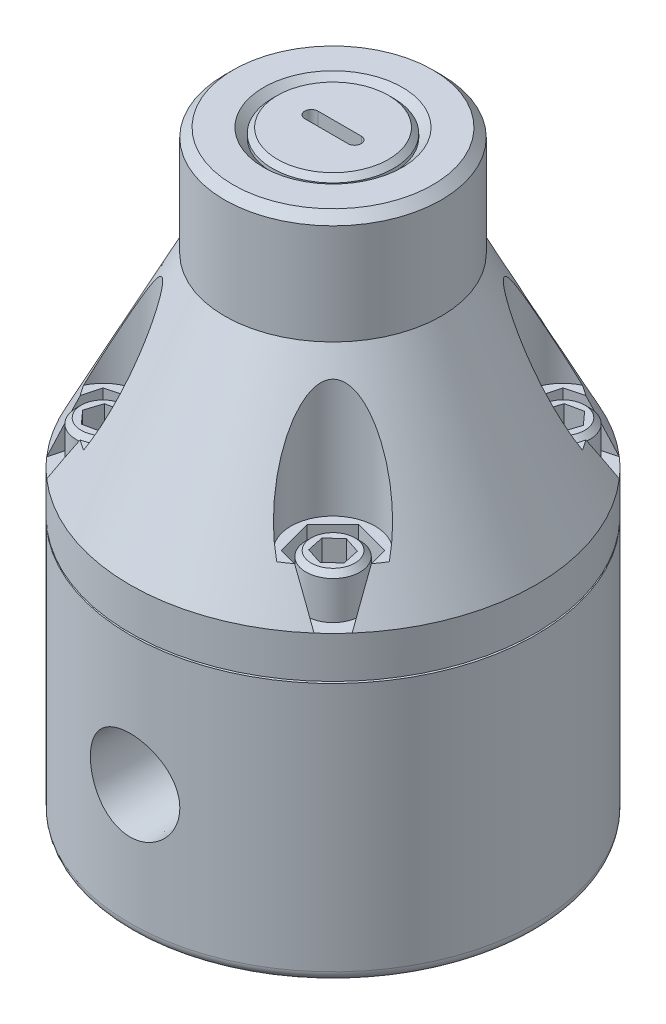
ISO-10303-21;
HEADER;
FILE_DESCRIPTION(('STEP AP214'),'2;1');
FILE_NAME('part.step','',(''),(''),'','','');
FILE_SCHEMA(('AUTOMOTIVE_DESIGN { 1 0 10303 214 1 1 1 1 }'));
ENDSEC;
DATA;
#1=APPLICATION_CONTEXT('core data for automotive mechanical design processes');
#2=APPLICATION_PROTOCOL_DEFINITION('international standard','automotive_design',2000,#1);
#3=PRODUCT_CONTEXT('',#1,'mechanical');
#4=PRODUCT('Part','Part','',(#3));
#5=PRODUCT_RELATED_PRODUCT_CATEGORY('part','',(#4));
#6=PRODUCT_DEFINITION_FORMATION('','',#4);
#7=PRODUCT_DEFINITION_CONTEXT('part definition',#1,'design');
#8=PRODUCT_DEFINITION('design','',#6,#7);
#9=PRODUCT_DEFINITION_SHAPE('','',#8);
#10=(LENGTH_UNIT() NAMED_UNIT(*) SI_UNIT(.MILLI.,.METRE.));
#11=(NAMED_UNIT(*) PLANE_ANGLE_UNIT() SI_UNIT($,.RADIAN.));
#12=(NAMED_UNIT(*) SI_UNIT($,.STERADIAN.) SOLID_ANGLE_UNIT());
#13=UNCERTAINTY_MEASURE_WITH_UNIT(LENGTH_MEASURE(1.E-05),#10,'distance_accuracy_value','');
#14=(GEOMETRIC_REPRESENTATION_CONTEXT(3) GLOBAL_UNCERTAINTY_ASSIGNED_CONTEXT((#13)) GLOBAL_UNIT_ASSIGNED_CONTEXT((#10,
#11,#12)) REPRESENTATION_CONTEXT('',''));
#15=CARTESIAN_POINT('',(0.,0.,0.));
#16=DIRECTION('',(0.,0.,1.));
#17=DIRECTION('',(1.,0.,0.));
#18=AXIS2_PLACEMENT_3D('',#15,#16,#17);
#19=CARTESIAN_POINT('',(0.,44.45,0.));
#20=DIRECTION('',(0.,-1.,0.));
#21=DIRECTION('',(0.,0.,-1.));
#22=AXIS2_PLACEMENT_3D('',#19,#20,#21);
#23=CONICAL_SURFACE('',#22,29.718,0.471096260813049);
#24=CARTESIAN_POINT('',(-22.3698341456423,44.4498,-19.5641534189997));
#25=CARTESIAN_POINT('',(-22.2846946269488,44.983226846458,-19.2487742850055));
#26=CARTESIAN_POINT('',(-22.1991812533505,45.5157783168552,-18.9320102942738));
#27=CARTESIAN_POINT('',(-22.0273147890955,46.5788472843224,-18.2953717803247));
#28=CARTESIAN_POINT('',(-21.9409617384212,47.1093648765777,-17.9754974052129));
#29=CARTESIAN_POINT('',(-21.7673151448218,48.1681378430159,-17.3322648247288));
#30=CARTESIAN_POINT('',(-21.6800215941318,48.696393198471,-17.0089065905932));
#31=CARTESIAN_POINT('',(-21.5043687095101,49.7503232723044,-16.3582421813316));
#32=CARTESIAN_POINT('',(-21.4160093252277,50.2759978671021,-16.030935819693));
#33=CARTESIAN_POINT('',(-21.3270581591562,50.8002,-15.7014373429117));
#34=B_SPLINE_CURVE_WITH_KNOTS('',3,(#24,#25,#26,#27,#28,#29,#30,#31,#32,#33),.UNSPECIFIED.,.F.,
.F.,(4,2,2,2,4),(0.,1.87651750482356,3.75294608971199,5.62939017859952,7.50592326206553),.UNSPECIFIED.);
#35=CARTESIAN_POINT('',(-22.3698022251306,44.45,-19.5640351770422));
#36=VERTEX_POINT('',#35);
#37=CARTESIAN_POINT('',(-21.3270920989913,50.8,-15.7015630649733));
#38=VERTEX_POINT('',#37);
#39=EDGE_CURVE('E626',#36,#38,#34,.T.);
#40=ORIENTED_EDGE('',*,*,#39,.F.);
#41=CARTESIAN_POINT('',(0.,44.45,0.));
#42=DIRECTION('',(0.,-1.,0.));
#43=DIRECTION('',(0.,0.,-1.));
#44=AXIS2_PLACEMENT_3D('',#41,#42,#43);
#45=CIRCLE('',#44,29.718);
#46=CARTESIAN_POINT('',(-22.3577085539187,44.45,19.5778546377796));
#47=VERTEX_POINT('',#46);
#48=EDGE_CURVE('E1176',#47,#36,#45,.T.);
#49=ORIENTED_EDGE('',*,*,#48,.F.);
#50=CARTESIAN_POINT('',(-21.3268756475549,50.8002,15.7016852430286));
#51=CARTESIAN_POINT('',(-21.4148377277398,50.2760902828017,16.0324429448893));
#52=CARTESIAN_POINT('',(-21.5022067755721,49.7504798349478,16.3609707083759));
#53=CARTESIAN_POINT('',(-21.6758769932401,48.6966301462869,17.0140107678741));
#54=CARTESIAN_POINT('',(-21.7621782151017,48.168391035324,17.3385232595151));
#55=CARTESIAN_POINT('',(-21.9338388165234,47.1096098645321,17.984006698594));
#56=CARTESIAN_POINT('',(-22.0191982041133,46.5790678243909,18.3049776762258));
#57=CARTESIAN_POINT('',(-22.189076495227,45.5159139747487,18.9437592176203));
#58=CARTESIAN_POINT('',(-22.2735953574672,44.9833020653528,19.2615696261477));
#59=CARTESIAN_POINT('',(-22.3577400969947,44.4498,19.5779732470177));
#60=B_SPLINE_CURVE_WITH_KNOTS('',3,(#50,#51,#52,#53,#54,#55,#56,#57,#58,#59),.UNSPECIFIED.,.F.,
.F.,(4,2,2,2,4),(0.,1.87787395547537,3.75565605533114,5.63342213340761,7.51127998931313),.UNSPECIFIED.);
#61=CARTESIAN_POINT('',(-21.3269092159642,50.8,15.7018114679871));
#62=VERTEX_POINT('',#61);
#63=EDGE_CURVE('E674',#62,#47,#60,.T.);
#64=ORIENTED_EDGE('',*,*,#63,.F.);
#65=CARTESIAN_POINT('',(0.,50.8,0.));
#66=DIRECTION('',(0.,1.,0.));
#67=DIRECTION('',(0.,0.,1.));
#68=AXIS2_PLACEMENT_3D('',#65,#66,#67);
#69=CIRCLE('',#68,26.4836542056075);
#70=CARTESIAN_POINT('',(-22.3908779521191,50.8,14.1432854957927));
#71=VERTEX_POINT('',#70);
#72=EDGE_CURVE('E1128',#62,#71,#69,.F.);
#73=ORIENTED_EDGE('',*,*,#72,.T.);
#74=CARTESIAN_POINT('',(-22.3909303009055,50.7998,14.1433933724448));
#75=CARTESIAN_POINT('',(-22.3503047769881,50.9550022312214,14.0596815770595));
#76=CARTESIAN_POINT('',(-22.3081630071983,51.11069928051,13.9776470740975));
#77=CARTESIAN_POINT('',(-22.2210302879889,51.4229732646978,13.8168553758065));
#78=CARTESIAN_POINT('',(-22.1760395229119,51.5795501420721,13.7380979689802));
#79=CARTESIAN_POINT('',(-22.0370947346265,52.0503500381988,13.5066666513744));
#80=CARTESIAN_POINT('',(-21.9391379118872,52.3657572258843,13.358771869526));
#81=CARTESIAN_POINT('',(-21.7338262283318,52.9987217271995,13.0753567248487));
#82=CARTESIAN_POINT('',(-21.6264783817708,53.3162772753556,12.9398272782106));
#83=CARTESIAN_POINT('',(-21.4032338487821,53.9532404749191,12.6806046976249));
#84=CARTESIAN_POINT('',(-21.2873363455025,54.2726483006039,12.5569126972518));
#85=CARTESIAN_POINT('',(-21.0470421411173,54.9146343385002,12.3204109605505));
#86=CARTESIAN_POINT('',(-20.9226003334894,55.2372202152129,12.2076680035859));
#87=CARTESIAN_POINT('',(-20.6663853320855,55.8832945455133,11.9936819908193));
#88=CARTESIAN_POINT('',(-20.5346119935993,56.2067830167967,11.8924391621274));
#89=CARTESIAN_POINT('',(-20.2641447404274,56.8542665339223,11.7013595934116));
#90=CARTESIAN_POINT('',(-20.1254503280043,57.1782616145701,11.611523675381));
#91=CARTESIAN_POINT('',(-19.8414364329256,57.8262899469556,11.4433041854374));
#92=CARTESIAN_POINT('',(-19.6961171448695,58.1503231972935,11.3649202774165));
#93=CARTESIAN_POINT('',(-19.3211632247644,58.9676954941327,11.1817059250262));
#94=CARTESIAN_POINT('',(-19.0872302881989,59.4608247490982,11.0845248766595));
#95=CARTESIAN_POINT('',(-18.7249280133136,60.1984605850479,10.9599064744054));
#96=CARTESIAN_POINT('',(-18.6022415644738,60.4440315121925,10.9218885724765));
#97=CARTESIAN_POINT('',(-18.3529388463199,60.9341977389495,10.8531925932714));
#98=CARTESIAN_POINT('',(-18.2263228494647,61.1787931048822,10.8225140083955));
#99=CARTESIAN_POINT('',(-17.969023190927,61.6665771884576,10.7688733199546));
#100=CARTESIAN_POINT('',(-17.8383410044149,61.9097663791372,10.7459084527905));
#101=CARTESIAN_POINT('',(-17.5726008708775,62.3943656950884,10.7081842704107));
#102=CARTESIAN_POINT('',(-17.4375433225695,62.6357759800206,10.6934242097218));
#103=CARTESIAN_POINT('',(-17.1627429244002,63.1161071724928,10.6727907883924));
#104=CARTESIAN_POINT('',(-17.0230031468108,63.3550295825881,10.6669117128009));
#105=CARTESIAN_POINT('',(-16.7382475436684,63.8297183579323,10.664943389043));
#106=CARTESIAN_POINT('',(-16.5932325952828,64.0654852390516,10.6688525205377));
#107=CARTESIAN_POINT('',(-16.2968182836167,64.5333650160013,10.6877509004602));
#108=CARTESIAN_POINT('',(-16.1454043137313,64.7654676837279,10.7027669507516));
#109=CARTESIAN_POINT('',(-15.8354539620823,65.2238758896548,10.7457309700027));
#110=CARTESIAN_POINT('',(-15.676913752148,65.4501782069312,10.7736859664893));
#111=CARTESIAN_POINT('',(-15.351527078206,65.8941617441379,10.8451251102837));
#112=CARTESIAN_POINT('',(-15.1846866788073,66.1118490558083,10.8885980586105));
#113=CARTESIAN_POINT('',(-14.9269806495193,66.4284557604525,10.9683843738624));
#114=CARTESIAN_POINT('',(-14.8398818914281,66.5322892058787,10.9973916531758));
#115=CARTESIAN_POINT('',(-14.662930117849,66.7358080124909,11.0609509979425));
#116=CARTESIAN_POINT('',(-14.5730777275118,66.8354943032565,11.0955018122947));
#117=CARTESIAN_POINT('',(-14.3891167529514,67.0309037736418,11.1714874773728));
#118=CARTESIAN_POINT('',(-14.2949676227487,67.1265572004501,11.2130072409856));
#119=CARTESIAN_POINT('',(-14.1034347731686,67.3107355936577,11.3035808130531));
#120=CARTESIAN_POINT('',(-14.0060494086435,67.3992568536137,11.3526385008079));
#121=CARTESIAN_POINT('',(-13.7101223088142,67.649646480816,11.512340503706));
#122=CARTESIAN_POINT('',(-13.5060546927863,67.7982916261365,11.636194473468));
#123=CARTESIAN_POINT('',(-13.1996116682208,67.9693306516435,11.8507095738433));
#124=CARTESIAN_POINT('',(-13.0998509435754,68.0171000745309,11.9248690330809));
#125=CARTESIAN_POINT('',(-12.9007063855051,68.093763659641,12.0829789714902));
#126=CARTESIAN_POINT('',(-12.8013223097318,68.1226733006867,12.1669213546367));
#127=CARTESIAN_POINT('',(-12.6053038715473,68.1585908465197,12.3437610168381));
#128=CARTESIAN_POINT('',(-12.5086917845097,68.1654540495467,12.4367133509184));
#129=CARTESIAN_POINT('',(-12.3223166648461,68.1559739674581,12.6281475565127));
#130=CARTESIAN_POINT('',(-12.2325552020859,68.1396253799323,12.7266306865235));
#131=CARTESIAN_POINT('',(-12.0684910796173,68.0877160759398,12.9184346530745));
#132=CARTESIAN_POINT('',(-11.9935403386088,68.0536265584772,13.0116153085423));
#133=CARTESIAN_POINT('',(-11.8522698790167,67.9702029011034,13.1975950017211));
#134=CARTESIAN_POINT('',(-11.7859543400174,67.9208614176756,13.2903938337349));
#135=CARTESIAN_POINT('',(-11.61636622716,67.7696530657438,13.5413620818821));
#136=CARTESIAN_POINT('',(-11.5214197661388,67.6557254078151,13.697840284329));
#137=CARTESIAN_POINT('',(-11.3524385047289,67.4045941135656,14.0032728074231));
#138=CARTESIAN_POINT('',(-11.278478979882,67.2673094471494,14.1521985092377));
#139=CARTESIAN_POINT('',(-11.1484302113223,66.9800134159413,14.4401544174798));
#140=CARTESIAN_POINT('',(-11.0920802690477,66.8302339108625,14.5793027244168));
#141=CARTESIAN_POINT('',(-10.9925096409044,66.5206741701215,14.8511494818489));
#142=CARTESIAN_POINT('',(-10.9493023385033,66.3608839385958,14.9838412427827));
#143=CARTESIAN_POINT('',(-10.873663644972,66.0339640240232,15.2438249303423));
#144=CARTESIAN_POINT('',(-10.8412572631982,65.8668183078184,15.3711037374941));
#145=CARTESIAN_POINT('',(-10.7856662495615,65.527480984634,15.6206584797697));
#146=CARTESIAN_POINT('',(-10.7624784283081,65.3552911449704,15.7429361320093));
#147=CARTESIAN_POINT('',(-10.7205377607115,64.975265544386,16.0051192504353));
#148=CARTESIAN_POINT('',(-10.7033691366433,64.7666647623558,16.1441638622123));
#149=CARTESIAN_POINT('',(-10.6786273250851,64.345493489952,16.4170496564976));
#150=CARTESIAN_POINT('',(-10.6710565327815,64.1329220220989,16.550889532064));
#151=CARTESIAN_POINT('',(-10.6644224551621,63.7046459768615,16.814058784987));
#152=CARTESIAN_POINT('',(-10.66536630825,63.4889389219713,16.9433842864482));
#153=CARTESIAN_POINT('',(-10.6749670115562,63.0552423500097,17.1978874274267));
#154=CARTESIAN_POINT('',(-10.6836247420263,62.8372525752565,17.3230645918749));
#155=CARTESIAN_POINT('',(-10.7080782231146,62.3989194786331,17.5699535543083));
#156=CARTESIAN_POINT('',(-10.7238938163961,62.1785712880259,17.6916547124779));
#157=CARTESIAN_POINT('',(-10.7622068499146,61.7365128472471,17.9314908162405));
#158=CARTESIAN_POINT('',(-10.7847047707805,61.5148025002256,18.0496255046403));
#159=CARTESIAN_POINT('',(-10.8616544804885,60.8482451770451,18.3989144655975));
#160=CARTESIAN_POINT('',(-10.9255713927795,60.4018168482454,18.6250403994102));
#161=CARTESIAN_POINT('',(-11.0664102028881,59.5679438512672,19.0346218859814));
#162=CARTESIAN_POINT('',(-11.1403619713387,59.180774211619,19.2196861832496));
#163=CARTESIAN_POINT('',(-11.3050181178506,58.4056258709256,19.5805572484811));
#164=CARTESIAN_POINT('',(-11.3957241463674,58.0176470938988,19.7563631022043));
#165=CARTESIAN_POINT('',(-11.5935742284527,57.2416151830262,20.0985507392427));
#166=CARTESIAN_POINT('',(-11.7007221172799,56.8535620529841,20.2649303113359));
#167=CARTESIAN_POINT('',(-11.9313879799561,56.0781881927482,20.5877481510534));
#168=CARTESIAN_POINT('',(-12.0549056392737,55.6908674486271,20.7441866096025));
#169=CARTESIAN_POINT('',(-12.3163714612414,54.9238997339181,21.0439307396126));
#170=CARTESIAN_POINT('',(-12.4540552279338,54.5442296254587,21.1874073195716));
#171=CARTESIAN_POINT('',(-12.745800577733,53.7871030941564,21.4629534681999));
#172=CARTESIAN_POINT('',(-12.8998598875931,53.4096463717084,21.5950246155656));
#173=CARTESIAN_POINT('',(-13.225002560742,52.6576533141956,21.8464430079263));
#174=CARTESIAN_POINT('',(-13.3960903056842,52.2831177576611,21.9657869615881));
#175=CARTESIAN_POINT('',(-13.6660711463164,51.7243911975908,22.133854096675));
#176=CARTESIAN_POINT('',(-13.7583155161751,51.5386135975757,22.1880644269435));
#177=CARTESIAN_POINT('',(-13.9473861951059,51.1682602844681,22.2925349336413));
#178=CARTESIAN_POINT('',(-14.0442129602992,50.9836846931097,22.3427947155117));
#179=CARTESIAN_POINT('',(-14.1433933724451,50.7998000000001,22.3909303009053));
#180=B_SPLINE_CURVE_WITH_KNOTS('',3,(#74,#75,#76,#77,#78,#79,#80,#81,#82,#83,#84,#85,#86,#87,
#88,#89,#90,#91,#92,#93,#94,#95,#96,#97,#98,#99,#100,#101,#102,#103,#104,#105,#106,#107,#108,
#109,#110,#111,#112,#113,#114,#115,#116,#117,#118,#119,#120,#121,#122,#123,#124,#125,#126,#127,
#128,#129,#130,#131,#132,#133,#134,#135,#136,#137,#138,#139,#140,#141,#142,#143,#144,#145,#146,
#147,#148,#149,#150,#151,#152,#153,#154,#155,#156,#157,#158,#159,#160,#161,#162,#163,#164,#165,
#166,#167,#168,#169,#170,#171,#172,#173,#174,#175,#176,#177,#178,#179),.UNSPECIFIED.,.F.,.F.,(4,
2,2,2,2,2,2,2,2,2,2,2,2,2,2,2,2,2,2,2,2,2,2,2,2,2,2,2,2,2,2,2,2,2,2,2,2,2,2,2,2,2,2,2,2,2,2,2,2,
2,2,2,4),(0.,0.542840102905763,1.0856451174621,2.17085376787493,3.25525867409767,
4.3397673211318,5.43052218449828,6.52129858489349,7.61215354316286,8.70297647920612,
10.3650975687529,11.196398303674,12.027641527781,12.8585866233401,13.6894562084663,
14.5197908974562,15.3499881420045,16.1821952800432,17.014854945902,17.8469149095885,
18.2625409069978,18.6780732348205,19.0990950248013,19.5203342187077,20.354755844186,
20.7529146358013,21.1507462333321,21.5511837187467,21.9517126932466,22.32334462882,
22.6951557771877,23.3381727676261,23.9834677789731,24.6186994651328,25.2545758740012,
25.8919145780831,26.5290325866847,27.2825500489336,28.0362555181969,28.7905929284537,
29.5450164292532,30.3015442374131,31.0581264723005,32.5707579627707,33.8767149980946,
35.1828007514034,36.4891916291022,37.7955574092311,39.08088730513,40.3660390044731,
41.6515222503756,42.2946005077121,42.9377429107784),.UNSPECIFIED.);
#181=CARTESIAN_POINT('',(-14.1432854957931,50.8,22.3908779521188));
#182=VERTEX_POINT('',#181);
#183=EDGE_CURVE('E1124',#71,#182,#180,.T.);
#184=ORIENTED_EDGE('',*,*,#183,.T.);
#185=CARTESIAN_POINT('',(-15.7015630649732,50.8,21.3270920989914));
#186=VERTEX_POINT('',#185);
#187=EDGE_CURVE('E1126',#182,#186,#69,.F.);
#188=ORIENTED_EDGE('',*,*,#187,.T.);
#189=CARTESIAN_POINT('',(-19.5641534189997,44.4498,22.3698341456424));
#190=CARTESIAN_POINT('',(-19.2487742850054,44.983226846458,22.2846946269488));
#191=CARTESIAN_POINT('',(-18.9320102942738,45.5157783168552,22.1991812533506));
#192=CARTESIAN_POINT('',(-18.2953717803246,46.5788472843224,22.0273147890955));
#193=CARTESIAN_POINT('',(-17.9754974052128,47.1093648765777,21.9409617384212));
#194=CARTESIAN_POINT('',(-17.3322648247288,48.1681378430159,21.7673151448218));
#195=CARTESIAN_POINT('',(-17.0089065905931,48.696393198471,21.6800215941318));
#196=CARTESIAN_POINT('',(-16.3582421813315,49.7503232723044,21.5043687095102));
#197=CARTESIAN_POINT('',(-16.030935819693,50.2759978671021,21.4160093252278));
#198=CARTESIAN_POINT('',(-15.7014373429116,50.8002,21.3270581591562));
#199=B_SPLINE_CURVE_WITH_KNOTS('',3,(#189,#190,#191,#192,#193,#194,#195,#196,#197,#198),
.UNSPECIFIED.,.F.,.F.,(4,2,2,2,4),(0.,1.87651750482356,3.752946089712,5.62939017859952,
7.50592326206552),.UNSPECIFIED.);
#200=CARTESIAN_POINT('',(-19.5640351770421,44.45,22.3698022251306));
#201=VERTEX_POINT('',#200);
#202=EDGE_CURVE('E680',#201,#186,#199,.T.);
#203=ORIENTED_EDGE('',*,*,#202,.F.);
#204=CARTESIAN_POINT('',(19.5778546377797,44.45,22.3577085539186));
#205=VERTEX_POINT('',#204);
#206=EDGE_CURVE('E1173',#205,#201,#45,.T.);
#207=ORIENTED_EDGE('',*,*,#206,.F.);
#208=CARTESIAN_POINT('',(15.7016852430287,50.8002,21.3268756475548));
#209=CARTESIAN_POINT('',(16.0324429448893,50.2760902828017,21.4148377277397));
#210=CARTESIAN_POINT('',(16.3609707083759,49.7504798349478,21.502206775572));
#211=CARTESIAN_POINT('',(17.0140107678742,48.6966301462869,21.67587699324));
#212=CARTESIAN_POINT('',(17.3385232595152,48.168391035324,21.7621782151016));
#213=CARTESIAN_POINT('',(17.9840066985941,47.1096098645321,21.9338388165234));
#214=CARTESIAN_POINT('',(18.3049776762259,46.5790678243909,22.0191982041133));
#215=CARTESIAN_POINT('',(18.9437592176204,45.5159139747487,22.1890764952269));
#216=CARTESIAN_POINT('',(19.2615696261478,44.9833020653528,22.2735953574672));
#217=CARTESIAN_POINT('',(19.5779732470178,44.4498,22.3577400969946));
#218=B_SPLINE_CURVE_WITH_KNOTS('',3,(#208,#209,#210,#211,#212,#213,#214,#215,#216,#217),
.UNSPECIFIED.,.F.,.F.,(4,2,2,2,4),(0.,1.87787395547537,3.75565605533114,5.63342213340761,
7.51127998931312),.UNSPECIFIED.);
#219=CARTESIAN_POINT('',(15.7018114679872,50.8,21.3269092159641));
#220=VERTEX_POINT('',#219);
#221=EDGE_CURVE('E712',#220,#205,#218,.T.);
#222=ORIENTED_EDGE('',*,*,#221,.F.);
#223=CARTESIAN_POINT('',(0.,50.8,0.));
#224=DIRECTION('',(0.,1.,0.));
#225=DIRECTION('',(0.,0.,1.));
#226=AXIS2_PLACEMENT_3D('',#223,#224,#225);
#227=CIRCLE('',#226,26.4836542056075);
#228=CARTESIAN_POINT('',(14.1432854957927,50.8,22.390877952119));
#229=VERTEX_POINT('',#228);
#230=EDGE_CURVE('E974',#220,#229,#227,.F.);
#231=ORIENTED_EDGE('',*,*,#230,.T.);
#232=CARTESIAN_POINT('',(14.1433933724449,50.7998,22.3909303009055));
#233=CARTESIAN_POINT('',(14.0596815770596,50.9550022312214,22.350304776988));
#234=CARTESIAN_POINT('',(13.9776470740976,51.11069928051,22.3081630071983));
#235=CARTESIAN_POINT('',(13.8168553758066,51.4229732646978,22.2210302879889));
#236=CARTESIAN_POINT('',(13.7380979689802,51.5795501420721,22.1760395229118));
#237=CARTESIAN_POINT('',(13.5066666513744,52.0503500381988,22.0370947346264));
#238=CARTESIAN_POINT('',(13.358771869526,52.3657572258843,21.9391379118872));
#239=CARTESIAN_POINT('',(13.0753567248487,52.9987217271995,21.7338262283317));
#240=CARTESIAN_POINT('',(12.9398272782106,53.3162772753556,21.6264783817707));
#241=CARTESIAN_POINT('',(12.6806046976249,53.9532404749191,21.403233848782));
#242=CARTESIAN_POINT('',(12.5569126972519,54.2726483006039,21.2873363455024));
#243=CARTESIAN_POINT('',(12.3204109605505,54.9146343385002,21.0470421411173));
#244=CARTESIAN_POINT('',(12.207668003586,55.2372202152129,20.9226003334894));
#245=CARTESIAN_POINT('',(11.9936819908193,55.8832945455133,20.6663853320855));
#246=CARTESIAN_POINT('',(11.8924391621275,56.2067830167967,20.5346119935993));
#247=CARTESIAN_POINT('',(11.7013595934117,56.8542665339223,20.2641447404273));
#248=CARTESIAN_POINT('',(11.6115236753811,57.1782616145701,20.1254503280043));
#249=CARTESIAN_POINT('',(11.4433041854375,57.8262899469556,19.8414364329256));
#250=CARTESIAN_POINT('',(11.3649202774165,58.1503231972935,19.6961171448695));
#251=CARTESIAN_POINT('',(11.1817059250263,58.9676954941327,19.3211632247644));
#252=CARTESIAN_POINT('',(11.0845248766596,59.4608247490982,19.0872302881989));
#253=CARTESIAN_POINT('',(10.9599064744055,60.1984605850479,18.7249280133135));
#254=CARTESIAN_POINT('',(10.9218885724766,60.4440315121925,18.6022415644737));
#255=CARTESIAN_POINT('',(10.8531925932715,60.9341977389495,18.3529388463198));
#256=CARTESIAN_POINT('',(10.8225140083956,61.1787931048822,18.2263228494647));
#257=CARTESIAN_POINT('',(10.7688733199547,61.6665771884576,17.969023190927));
#258=CARTESIAN_POINT('',(10.7459084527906,61.9097663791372,17.8383410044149));
#259=CARTESIAN_POINT('',(10.7081842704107,62.3943656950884,17.5726008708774));
#260=CARTESIAN_POINT('',(10.6934242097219,62.6357759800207,17.4375433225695));
#261=CARTESIAN_POINT('',(10.6727907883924,63.1161071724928,17.1627429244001));
#262=CARTESIAN_POINT('',(10.666911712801,63.3550295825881,17.0230031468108));
#263=CARTESIAN_POINT('',(10.6649433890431,63.8297183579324,16.7382475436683));
#264=CARTESIAN_POINT('',(10.6688525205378,64.0654852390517,16.5932325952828));
#265=CARTESIAN_POINT('',(10.6877509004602,64.5333650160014,16.2968182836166));
#266=CARTESIAN_POINT('',(10.7027669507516,64.7654676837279,16.1454043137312));
#267=CARTESIAN_POINT('',(10.7457309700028,65.2238758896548,15.8354539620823));
#268=CARTESIAN_POINT('',(10.7736859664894,65.4501782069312,15.676913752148));
#269=CARTESIAN_POINT('',(10.8451251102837,65.8941617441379,15.3515270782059));
#270=CARTESIAN_POINT('',(10.8885980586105,66.1118490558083,15.1846866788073));
#271=CARTESIAN_POINT('',(10.9683843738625,66.4284557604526,14.9269806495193));
#272=CARTESIAN_POINT('',(10.9973916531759,66.5322892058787,14.839881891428));
#273=CARTESIAN_POINT('',(11.0609509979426,66.735808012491,14.662930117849));
#274=CARTESIAN_POINT('',(11.0955018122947,66.8354943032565,14.5730777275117));
#275=CARTESIAN_POINT('',(11.1714874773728,67.0309037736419,14.3891167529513));
#276=CARTESIAN_POINT('',(11.2130072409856,67.1265572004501,14.2949676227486));
#277=CARTESIAN_POINT('',(11.3035808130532,67.3107355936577,14.1034347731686));
#278=CARTESIAN_POINT('',(11.352638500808,67.3992568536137,14.0060494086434));
#279=CARTESIAN_POINT('',(11.512340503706,67.649646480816,13.7101223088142));
#280=CARTESIAN_POINT('',(11.636194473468,67.7982916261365,13.5060546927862));
#281=CARTESIAN_POINT('',(11.8507095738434,67.9693306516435,13.1996116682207));
#282=CARTESIAN_POINT('',(11.924869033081,68.0171000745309,13.0998509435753));
#283=CARTESIAN_POINT('',(12.0829789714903,68.093763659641,12.900706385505));
#284=CARTESIAN_POINT('',(12.1669213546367,68.1226733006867,12.8013223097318));
#285=CARTESIAN_POINT('',(12.3437610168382,68.1585908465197,12.6053038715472));
#286=CARTESIAN_POINT('',(12.4367133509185,68.1654540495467,12.5086917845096));
#287=CARTESIAN_POINT('',(12.6281475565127,68.1559739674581,12.322316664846));
#288=CARTESIAN_POINT('',(12.7266306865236,68.1396253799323,12.2325552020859));
#289=CARTESIAN_POINT('',(12.9184346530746,68.0877160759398,12.0684910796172));
#290=CARTESIAN_POINT('',(13.0116153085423,68.0536265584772,11.9935403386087));
#291=CARTESIAN_POINT('',(13.1975950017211,67.9702029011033,11.8522698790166));
#292=CARTESIAN_POINT('',(13.2903938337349,67.9208614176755,11.7859543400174));
#293=CARTESIAN_POINT('',(13.5413620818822,67.7696530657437,11.6163662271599));
#294=CARTESIAN_POINT('',(13.697840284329,67.655725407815,11.5214197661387));
#295=CARTESIAN_POINT('',(14.0032728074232,67.4045941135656,11.3524385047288));
#296=CARTESIAN_POINT('',(14.1521985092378,67.2673094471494,11.2784789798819));
#297=CARTESIAN_POINT('',(14.4401544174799,66.9800134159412,11.1484302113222));
#298=CARTESIAN_POINT('',(14.5793027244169,66.8302339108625,11.0920802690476));
#299=CARTESIAN_POINT('',(14.851149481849,66.5206741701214,10.9925096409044));
#300=CARTESIAN_POINT('',(14.9838412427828,66.3608839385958,10.9493023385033));
#301=CARTESIAN_POINT('',(15.2438249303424,66.0339640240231,10.8736636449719));
#302=CARTESIAN_POINT('',(15.3711037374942,65.8668183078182,10.8412572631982));
#303=CARTESIAN_POINT('',(15.6206584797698,65.5274809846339,10.7856662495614));
#304=CARTESIAN_POINT('',(15.7429361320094,65.3552911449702,10.762478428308));
#305=CARTESIAN_POINT('',(16.0051192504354,64.9752655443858,10.7205377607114));
#306=CARTESIAN_POINT('',(16.1441638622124,64.7666647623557,10.7033691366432));
#307=CARTESIAN_POINT('',(16.4170496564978,64.3454934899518,10.678627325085));
#308=CARTESIAN_POINT('',(16.5508895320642,64.1329220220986,10.6710565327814));
#309=CARTESIAN_POINT('',(16.8140587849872,63.7046459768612,10.6644224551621));
#310=CARTESIAN_POINT('',(16.9433842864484,63.488938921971,10.6653663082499));
#311=CARTESIAN_POINT('',(17.1978874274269,63.0552423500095,10.6749670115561));
#312=CARTESIAN_POINT('',(17.3230645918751,62.8372525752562,10.6836247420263));
#313=CARTESIAN_POINT('',(17.5699535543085,62.3989194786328,10.7080782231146));
#314=CARTESIAN_POINT('',(17.6916547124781,62.1785712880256,10.723893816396));
#315=CARTESIAN_POINT('',(17.9314908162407,61.7365128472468,10.7622068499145));
#316=CARTESIAN_POINT('',(18.0496255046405,61.5148025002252,10.7847047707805));
#317=CARTESIAN_POINT('',(18.3989144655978,60.8482451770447,10.8616544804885));
#318=CARTESIAN_POINT('',(18.6250403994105,60.401816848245,10.9255713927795));
#319=CARTESIAN_POINT('',(19.0346218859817,59.5679438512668,11.0664102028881));
#320=CARTESIAN_POINT('',(19.2196861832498,59.1807742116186,11.1403619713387));
#321=CARTESIAN_POINT('',(19.5805572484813,58.4056258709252,11.3050181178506));
#322=CARTESIAN_POINT('',(19.7563631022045,58.0176470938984,11.3957241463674));
#323=CARTESIAN_POINT('',(20.0985507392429,57.2416151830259,11.5935742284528));
#324=CARTESIAN_POINT('',(20.2649303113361,56.8535620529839,11.7007221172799));
#325=CARTESIAN_POINT('',(20.5877481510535,56.0781881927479,11.9313879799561));
#326=CARTESIAN_POINT('',(20.7441866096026,55.6908674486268,12.0549056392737));
#327=CARTESIAN_POINT('',(21.0439307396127,54.9238997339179,12.3163714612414));
#328=CARTESIAN_POINT('',(21.1874073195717,54.5442296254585,12.4540552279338));
#329=CARTESIAN_POINT('',(21.4629534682,53.7871030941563,12.745800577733));
#330=CARTESIAN_POINT('',(21.5950246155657,53.4096463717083,12.8998598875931));
#331=CARTESIAN_POINT('',(21.8464430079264,52.6576533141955,13.225002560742));
#332=CARTESIAN_POINT('',(21.9657869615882,52.283117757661,13.3960903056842));
#333=CARTESIAN_POINT('',(22.1338540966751,51.7243911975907,13.6660711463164));
#334=CARTESIAN_POINT('',(22.1880644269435,51.5386135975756,13.7583155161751));
#335=CARTESIAN_POINT('',(22.2925349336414,51.168260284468,13.9473861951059));
#336=CARTESIAN_POINT('',(22.3427947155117,50.9836846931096,14.0442129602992));
#337=CARTESIAN_POINT('',(22.3909303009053,50.7998,14.1433933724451));
#338=B_SPLINE_CURVE_WITH_KNOTS('',3,(#232,#233,#234,#235,#236,#237,#238,#239,#240,#241,#242,
#243,#244,#245,#246,#247,#248,#249,#250,#251,#252,#253,#254,#255,#256,#257,#258,#259,#260,#261,
#262,#263,#264,#265,#266,#267,#268,#269,#270,#271,#272,#273,#274,#275,#276,#277,#278,#279,#280,
#281,#282,#283,#284,#285,#286,#287,#288,#289,#290,#291,#292,#293,#294,#295,#296,#297,#298,#299,
#300,#301,#302,#303,#304,#305,#306,#307,#308,#309,#310,#311,#312,#313,#314,#315,#316,#317,#318,
#319,#320,#321,#322,#323,#324,#325,#326,#327,#328,#329,#330,#331,#332,#333,#334,#335,#336,#337),
.UNSPECIFIED.,.F.,.F.,(4,2,2,2,2,2,2,2,2,2,2,2,2,2,2,2,2,2,2,2,2,2,2,2,2,2,2,2,2,2,2,2,2,2,2,2,
2,2,2,2,2,2,2,2,2,2,2,2,2,2,2,2,4),(0.,0.542840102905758,1.0856451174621,2.17085376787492,
3.25525867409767,4.3397673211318,5.43052218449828,6.52129858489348,7.61215354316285,
8.70297647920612,10.3650975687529,11.196398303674,12.0276415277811,12.8585866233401,
13.6894562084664,14.5197908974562,15.3499881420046,16.1821952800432,17.0148549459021,
17.8469149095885,18.2625409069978,18.6780732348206,19.0990950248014,19.5203342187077,
20.354755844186,20.7529146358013,21.1507462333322,21.5511837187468,21.9517126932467,
22.3233446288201,22.6951557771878,23.3381727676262,23.9834677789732,24.618699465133,
25.2545758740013,25.8919145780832,26.5290325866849,27.2825500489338,28.0362555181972,
28.790592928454,29.5450164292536,30.3015442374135,31.0581264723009,32.5707579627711,
33.876714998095,35.1828007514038,36.4891916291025,37.7955574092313,39.0808873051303,
40.3660390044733,41.6515222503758,42.2946005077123,42.9377429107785),.UNSPECIFIED.);
#339=CARTESIAN_POINT('',(22.3908779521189,50.8,14.143285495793));
#340=VERTEX_POINT('',#339);
#341=EDGE_CURVE('E1145',#229,#340,#338,.T.);
#342=ORIENTED_EDGE('',*,*,#341,.T.);
#343=CARTESIAN_POINT('',(21.3270920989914,50.8,15.7015630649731));
#344=VERTEX_POINT('',#343);
#345=EDGE_CURVE('E975',#340,#344,#227,.F.);
#346=ORIENTED_EDGE('',*,*,#345,.T.);
#347=CARTESIAN_POINT('',(22.3698341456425,44.4498,19.5641534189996));
#348=CARTESIAN_POINT('',(22.2846946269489,44.983226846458,19.2487742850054));
#349=CARTESIAN_POINT('',(22.1991812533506,45.5157783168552,18.9320102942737));
#350=CARTESIAN_POINT('',(22.0273147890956,46.5788472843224,18.2953717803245));
#351=CARTESIAN_POINT('',(21.9409617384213,47.1093648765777,17.9754974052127));
#352=CARTESIAN_POINT('',(21.7673151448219,48.1681378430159,17.3322648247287));
#353=CARTESIAN_POINT('',(21.6800215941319,48.696393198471,17.008906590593));
#354=CARTESIAN_POINT('',(21.5043687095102,49.7503232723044,16.3582421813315));
#355=CARTESIAN_POINT('',(21.4160093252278,50.2759978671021,16.0309358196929));
#356=CARTESIAN_POINT('',(21.3270581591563,50.8002,15.7014373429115));
#357=B_SPLINE_CURVE_WITH_KNOTS('',3,(#347,#348,#349,#350,#351,#352,#353,#354,#355,#356),
.UNSPECIFIED.,.F.,.F.,(4,2,2,2,4),(0.,1.87651750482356,3.752946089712,5.62939017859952,
7.50592326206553),.UNSPECIFIED.);
#358=CARTESIAN_POINT('',(22.3698022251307,44.45,19.564035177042));
#359=VERTEX_POINT('',#358);
#360=EDGE_CURVE('E718',#359,#344,#357,.T.);
#361=ORIENTED_EDGE('',*,*,#360,.F.);
#362=CARTESIAN_POINT('',(22.3577085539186,44.45,-19.5778546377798));
#363=VERTEX_POINT('',#362);
#364=EDGE_CURVE('E879',#363,#359,#45,.T.);
#365=ORIENTED_EDGE('',*,*,#364,.F.);
#366=CARTESIAN_POINT('',(21.3268756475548,50.8002,-15.7016852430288));
#367=CARTESIAN_POINT('',(21.4148377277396,50.2760902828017,-16.0324429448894));
#368=CARTESIAN_POINT('',(21.5022067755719,49.7504798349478,-16.360970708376));
#369=CARTESIAN_POINT('',(21.67587699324,48.6966301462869,-17.0140107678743));
#370=CARTESIAN_POINT('',(21.7621782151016,48.168391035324,-17.3385232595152));
#371=CARTESIAN_POINT('',(21.9338388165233,47.1096098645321,-17.9840066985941));
#372=CARTESIAN_POINT('',(22.0191982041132,46.5790678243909,-18.3049776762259));
#373=CARTESIAN_POINT('',(22.1890764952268,45.5159139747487,-18.9437592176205));
#374=CARTESIAN_POINT('',(22.2735953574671,44.9833020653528,-19.2615696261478));
#375=CARTESIAN_POINT('',(22.3577400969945,44.4498,-19.5779732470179));
#376=B_SPLINE_CURVE_WITH_KNOTS('',3,(#366,#367,#368,#369,#370,#371,#372,#373,#374,#375),
.UNSPECIFIED.,.F.,.F.,(4,2,2,2,4),(0.,1.87787395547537,3.75565605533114,5.63342213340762,
7.51127998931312),.UNSPECIFIED.);
#377=CARTESIAN_POINT('',(21.3269092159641,50.8,-15.7018114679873));
#378=VERTEX_POINT('',#377);
#379=EDGE_CURVE('E749',#378,#363,#376,.T.);
#380=ORIENTED_EDGE('',*,*,#379,.F.);
#381=CARTESIAN_POINT('',(0.,50.8,0.));
#382=DIRECTION('',(0.,1.,0.));
#383=DIRECTION('',(0.,0.,1.));
#384=AXIS2_PLACEMENT_3D('',#381,#382,#383);
#385=CIRCLE('',#384,26.4836542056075);
#386=CARTESIAN_POINT('',(22.390877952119,50.8,-14.1432854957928));
#387=VERTEX_POINT('',#386);
#388=EDGE_CURVE('E963',#378,#387,#385,.F.);
#389=ORIENTED_EDGE('',*,*,#388,.T.);
#390=CARTESIAN_POINT('',(22.3909303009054,50.7998000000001,-14.1433933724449));
#391=CARTESIAN_POINT('',(22.350304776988,50.9550022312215,-14.0596815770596));
#392=CARTESIAN_POINT('',(22.3081630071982,51.1106992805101,-13.9776470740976));
#393=CARTESIAN_POINT('',(22.2210302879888,51.4229732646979,-13.8168553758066));
#394=CARTESIAN_POINT('',(22.1760395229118,51.5795501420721,-13.7380979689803));
#395=CARTESIAN_POINT('',(22.0370947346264,52.0503500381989,-13.5066666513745));
#396=CARTESIAN_POINT('',(21.9391379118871,52.3657572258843,-13.3587718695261));
#397=CARTESIAN_POINT('',(21.7338262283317,52.9987217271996,-13.0753567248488));
#398=CARTESIAN_POINT('',(21.6264783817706,53.3162772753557,-12.9398272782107));
#399=CARTESIAN_POINT('',(21.4032338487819,53.9532404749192,-12.680604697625));
#400=CARTESIAN_POINT('',(21.2873363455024,54.272648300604,-12.5569126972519));
#401=CARTESIAN_POINT('',(21.0470421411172,54.9146343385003,-12.3204109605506));
#402=CARTESIAN_POINT('',(20.9226003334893,55.237220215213,-12.207668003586));
#403=CARTESIAN_POINT('',(20.6663853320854,55.8832945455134,-11.9936819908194));
#404=CARTESIAN_POINT('',(20.5346119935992,56.2067830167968,-11.8924391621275));
#405=CARTESIAN_POINT('',(20.2641447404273,56.8542665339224,-11.7013595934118));
#406=CARTESIAN_POINT('',(20.1254503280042,57.1782616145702,-11.6115236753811));
#407=CARTESIAN_POINT('',(19.8414364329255,57.8262899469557,-11.4433041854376));
#408=CARTESIAN_POINT('',(19.6961171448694,58.1503231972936,-11.3649202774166));
#409=CARTESIAN_POINT('',(19.3211632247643,58.9676954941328,-11.1817059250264));
#410=CARTESIAN_POINT('',(19.0872302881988,59.4608247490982,-11.0845248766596));
#411=CARTESIAN_POINT('',(18.7249280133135,60.1984605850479,-10.9599064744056));
#412=CARTESIAN_POINT('',(18.6022415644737,60.4440315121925,-10.9218885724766));
#413=CARTESIAN_POINT('',(18.3529388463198,60.9341977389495,-10.8531925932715));
#414=CARTESIAN_POINT('',(18.2263228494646,61.1787931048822,-10.8225140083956));
#415=CARTESIAN_POINT('',(17.9690231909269,61.6665771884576,-10.7688733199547));
#416=CARTESIAN_POINT('',(17.8383410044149,61.9097663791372,-10.7459084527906));
#417=CARTESIAN_POINT('',(17.5726008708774,62.3943656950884,-10.7081842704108));
#418=CARTESIAN_POINT('',(17.4375433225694,62.6357759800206,-10.693424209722));
#419=CARTESIAN_POINT('',(17.1627429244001,63.1161071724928,-10.6727907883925));
#420=CARTESIAN_POINT('',(17.0230031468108,63.3550295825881,-10.666911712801));
#421=CARTESIAN_POINT('',(16.7382475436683,63.8297183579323,-10.6649433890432));
#422=CARTESIAN_POINT('',(16.5932325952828,64.0654852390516,-10.6688525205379));
#423=CARTESIAN_POINT('',(16.2968182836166,64.5333650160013,-10.6877509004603));
#424=CARTESIAN_POINT('',(16.1454043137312,64.7654676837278,-10.7027669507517));
#425=CARTESIAN_POINT('',(15.8354539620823,65.2238758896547,-10.7457309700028));
#426=CARTESIAN_POINT('',(15.676913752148,65.4501782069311,-10.7736859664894));
#427=CARTESIAN_POINT('',(15.351527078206,65.8941617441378,-10.8451251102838));
#428=CARTESIAN_POINT('',(15.1846866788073,66.1118490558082,-10.8885980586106));
#429=CARTESIAN_POINT('',(14.9269806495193,66.4284557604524,-10.9683843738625));
#430=CARTESIAN_POINT('',(14.8398818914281,66.5322892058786,-10.9973916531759));
#431=CARTESIAN_POINT('',(14.662930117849,66.7358080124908,-11.0609509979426));
#432=CARTESIAN_POINT('',(14.5730777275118,66.8354943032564,-11.0955018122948));
#433=CARTESIAN_POINT('',(14.3891167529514,67.0309037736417,-11.1714874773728));
#434=CARTESIAN_POINT('',(14.2949676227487,67.12655720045,-11.2130072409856));
#435=CARTESIAN_POINT('',(14.1034347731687,67.3107355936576,-11.3035808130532));
#436=CARTESIAN_POINT('',(14.0060494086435,67.3992568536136,-11.352638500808));
#437=CARTESIAN_POINT('',(13.7101223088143,67.6496464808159,-11.512340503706));
#438=CARTESIAN_POINT('',(13.5060546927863,67.7982916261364,-11.636194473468));
#439=CARTESIAN_POINT('',(13.1996116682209,67.9693306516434,-11.8507095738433));
#440=CARTESIAN_POINT('',(13.0998509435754,68.0171000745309,-11.9248690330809));
#441=CARTESIAN_POINT('',(12.9007063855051,68.093763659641,-12.0829789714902));
#442=CARTESIAN_POINT('',(12.8013223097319,68.1226733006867,-12.1669213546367));
#443=CARTESIAN_POINT('',(12.6053038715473,68.1585908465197,-12.3437610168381));
#444=CARTESIAN_POINT('',(12.5086917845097,68.1654540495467,-12.4367133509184));
#445=CARTESIAN_POINT('',(12.3223166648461,68.1559739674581,-12.6281475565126));
#446=CARTESIAN_POINT('',(12.2325552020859,68.1396253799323,-12.7266306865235));
#447=CARTESIAN_POINT('',(12.0684910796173,68.0877160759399,-12.9184346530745));
#448=CARTESIAN_POINT('',(11.9935403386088,68.0536265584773,-13.0116153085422));
#449=CARTESIAN_POINT('',(11.8522698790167,67.9702029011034,-13.197595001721));
#450=CARTESIAN_POINT('',(11.7859543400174,67.9208614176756,-13.2903938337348));
#451=CARTESIAN_POINT('',(11.61636622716,67.7696530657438,-13.5413620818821));
#452=CARTESIAN_POINT('',(11.5214197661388,67.6557254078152,-13.6978402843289));
#453=CARTESIAN_POINT('',(11.3524385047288,67.4045941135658,-14.003272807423));
#454=CARTESIAN_POINT('',(11.278478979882,67.2673094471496,-14.1521985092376));
#455=CARTESIAN_POINT('',(11.1484302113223,66.9800134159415,-14.4401544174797));
#456=CARTESIAN_POINT('',(11.0920802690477,66.8302339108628,-14.5793027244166));
#457=CARTESIAN_POINT('',(10.9925096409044,66.5206741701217,-14.8511494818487));
#458=CARTESIAN_POINT('',(10.9493023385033,66.3608839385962,-14.9838412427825));
#459=CARTESIAN_POINT('',(10.873663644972,66.0339640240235,-15.2438249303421));
#460=CARTESIAN_POINT('',(10.8412572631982,65.8668183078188,-15.3711037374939));
#461=CARTESIAN_POINT('',(10.7856662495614,65.5274809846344,-15.6206584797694));
#462=CARTESIAN_POINT('',(10.762478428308,65.3552911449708,-15.742936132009));
#463=CARTESIAN_POINT('',(10.7205377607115,64.9752655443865,-16.005119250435));
#464=CARTESIAN_POINT('',(10.7033691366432,64.7666647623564,-16.144163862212));
#465=CARTESIAN_POINT('',(10.678627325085,64.3454934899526,-16.4170496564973));
#466=CARTESIAN_POINT('',(10.6710565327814,64.1329220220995,-16.5508895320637));
#467=CARTESIAN_POINT('',(10.664422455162,63.7046459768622,-16.8140587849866));
#468=CARTESIAN_POINT('',(10.6653663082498,63.488938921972,-16.9433842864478));
#469=CARTESIAN_POINT('',(10.674967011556,63.0552423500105,-17.1978874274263));
#470=CARTESIAN_POINT('',(10.6836247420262,62.8372525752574,-17.3230645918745));
#471=CARTESIAN_POINT('',(10.7080782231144,62.398919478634,-17.5699535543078));
#472=CARTESIAN_POINT('',(10.7238938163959,62.1785712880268,-17.6916547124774));
#473=CARTESIAN_POINT('',(10.7622068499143,61.7365128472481,-17.93149081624));
#474=CARTESIAN_POINT('',(10.7847047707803,61.5148025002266,-18.0496255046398));
#475=CARTESIAN_POINT('',(10.8616544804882,60.8482451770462,-18.398914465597));
#476=CARTESIAN_POINT('',(10.9255713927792,60.4018168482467,-18.6250403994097));
#477=CARTESIAN_POINT('',(11.0664102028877,59.5679438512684,-19.0346218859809));
#478=CARTESIAN_POINT('',(11.1403619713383,59.1807742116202,-19.2196861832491));
#479=CARTESIAN_POINT('',(11.3050181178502,58.4056258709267,-19.5805572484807));
#480=CARTESIAN_POINT('',(11.395724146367,58.0176470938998,-19.7563631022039));
#481=CARTESIAN_POINT('',(11.5935742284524,57.2416151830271,-20.0985507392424));
#482=CARTESIAN_POINT('',(11.7007221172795,56.853562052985,-20.2649303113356));
#483=CARTESIAN_POINT('',(11.9313879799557,56.0781881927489,-20.5877481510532));
#484=CARTESIAN_POINT('',(12.0549056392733,55.6908674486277,-20.7441866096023));
#485=CARTESIAN_POINT('',(12.316371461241,54.9238997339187,-21.0439307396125));
#486=CARTESIAN_POINT('',(12.4540552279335,54.5442296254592,-21.1874073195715));
#487=CARTESIAN_POINT('',(12.7458005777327,53.7871030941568,-21.4629534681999));
#488=CARTESIAN_POINT('',(12.8998598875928,53.4096463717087,-21.5950246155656));
#489=CARTESIAN_POINT('',(13.2250025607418,52.6576533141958,-21.8464430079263));
#490=CARTESIAN_POINT('',(13.396090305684,52.2831177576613,-21.9657869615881));
#491=CARTESIAN_POINT('',(13.6660711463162,51.7243911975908,-22.1338540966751));
#492=CARTESIAN_POINT('',(13.758315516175,51.5386135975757,-22.1880644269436));
#493=CARTESIAN_POINT('',(13.9473861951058,51.168260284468,-22.2925349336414));
#494=CARTESIAN_POINT('',(14.0442129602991,50.9836846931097,-22.3427947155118));
#495=CARTESIAN_POINT('',(14.143393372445,50.7998,-22.3909303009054));
#496=B_SPLINE_CURVE_WITH_KNOTS('',3,(#390,#391,#392,#393,#394,#395,#396,#397,#398,#399,#400,
#401,#402,#403,#404,#405,#406,#407,#408,#409,#410,#411,#412,#413,#414,#415,#416,#417,#418,#419,
#420,#421,#422,#423,#424,#425,#426,#427,#428,#429,#430,#431,#432,#433,#434,#435,#436,#437,#438,
#439,#440,#441,#442,#443,#444,#445,#446,#447,#448,#449,#450,#451,#452,#453,#454,#455,#456,#457,
#458,#459,#460,#461,#462,#463,#464,#465,#466,#467,#468,#469,#470,#471,#472,#473,#474,#475,#476,
#477,#478,#479,#480,#481,#482,#483,#484,#485,#486,#487,#488,#489,#490,#491,#492,#493,#494,#495),
.UNSPECIFIED.,.F.,.F.,(4,2,2,2,2,2,2,2,2,2,2,2,2,2,2,2,2,2,2,2,2,2,2,2,2,2,2,2,2,2,2,2,2,2,2,2,
2,2,2,2,2,2,2,2,2,2,2,2,2,2,2,2,4),(0.,0.542840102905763,1.08564511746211,2.17085376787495,
3.2552586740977,4.33976732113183,5.43052218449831,6.52129858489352,7.61215354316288,
8.70297647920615,10.3650975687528,11.196398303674,12.027641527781,12.85858662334,
13.6894562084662,14.519790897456,15.3499881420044,16.182195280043,17.0148549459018,
17.8469149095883,18.2625409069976,18.6780732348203,19.0990950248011,19.5203342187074,
20.3547558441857,20.752914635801,21.1507462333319,21.5511837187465,21.9517126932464,
22.3233446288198,22.6951557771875,23.3381727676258,23.9834677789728,24.6186994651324,
25.2545758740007,25.8919145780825,26.529032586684,27.2825500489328,28.036255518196,
28.7905929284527,29.5450164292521,30.3015442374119,31.0581264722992,32.5707579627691,
33.8767149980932,35.1828007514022,36.4891916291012,37.7955574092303,39.0808873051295,
40.3660390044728,41.6515222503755,42.2946005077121,42.9377429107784),.UNSPECIFIED.);
#497=CARTESIAN_POINT('',(14.1432854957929,50.8,-22.3908779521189));
#498=VERTEX_POINT('',#497);
#499=EDGE_CURVE('E967',#387,#498,#496,.T.);
#500=ORIENTED_EDGE('',*,*,#499,.T.);
#501=CARTESIAN_POINT('',(15.701563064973,50.8,-21.3270920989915));
#502=VERTEX_POINT('',#501);
#503=EDGE_CURVE('E964',#498,#502,#385,.F.);
#504=ORIENTED_EDGE('',*,*,#503,.T.);
#505=CARTESIAN_POINT('',(19.5641534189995,44.4498,-22.3698341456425));
#506=CARTESIAN_POINT('',(19.2487742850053,44.983226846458,-22.284694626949));
#507=CARTESIAN_POINT('',(18.9320102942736,45.5157783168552,-22.1991812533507));
#508=CARTESIAN_POINT('',(18.2953717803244,46.5788472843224,-22.0273147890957));
#509=CARTESIAN_POINT('',(17.9754974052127,47.1093648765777,-21.9409617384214));
#510=CARTESIAN_POINT('',(17.3322648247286,48.1681378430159,-21.767315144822));
#511=CARTESIAN_POINT('',(17.008906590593,48.696393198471,-21.6800215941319));
#512=CARTESIAN_POINT('',(16.3582421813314,49.7503232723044,-21.5043687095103));
#513=CARTESIAN_POINT('',(16.0309358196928,50.2759978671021,-21.4160093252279));
#514=CARTESIAN_POINT('',(15.7014373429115,50.8002,-21.3270581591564));
#515=B_SPLINE_CURVE_WITH_KNOTS('',3,(#505,#506,#507,#508,#509,#510,#511,#512,#513,#514),
.UNSPECIFIED.,.F.,.F.,(4,2,2,2,4),(0.,1.87651750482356,3.752946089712,5.62939017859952,
7.50592326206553),.UNSPECIFIED.);
#516=CARTESIAN_POINT('',(19.5640351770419,44.45,-22.3698022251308));
#517=VERTEX_POINT('',#516);
#518=EDGE_CURVE('E755',#517,#502,#515,.T.);
#519=ORIENTED_EDGE('',*,*,#518,.F.);
#520=CARTESIAN_POINT('',(-19.5778546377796,44.45,-22.3577085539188));
#521=VERTEX_POINT('',#520);
#522=EDGE_CURVE('E866',#521,#517,#45,.T.);
#523=ORIENTED_EDGE('',*,*,#522,.F.);
#524=CARTESIAN_POINT('',(-15.7016852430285,50.8002,-21.3268756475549));
#525=CARTESIAN_POINT('',(-16.0324429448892,50.2760902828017,-21.4148377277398));
#526=CARTESIAN_POINT('',(-16.3609707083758,49.7504798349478,-21.5022067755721));
#527=CARTESIAN_POINT('',(-17.014010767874,48.6966301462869,-21.6758769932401));
#528=CARTESIAN_POINT('',(-17.338523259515,48.168391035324,-21.7621782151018));
#529=CARTESIAN_POINT('',(-17.9840066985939,47.1096098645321,-21.9338388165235));
#530=CARTESIAN_POINT('',(-18.3049776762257,46.5790678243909,-22.0191982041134));
#531=CARTESIAN_POINT('',(-18.9437592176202,45.5159139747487,-22.189076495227));
#532=CARTESIAN_POINT('',(-19.2615696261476,44.9833020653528,-22.2735953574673));
#533=CARTESIAN_POINT('',(-19.5779732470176,44.4498,-22.3577400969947));
#534=B_SPLINE_CURVE_WITH_KNOTS('',3,(#524,#525,#526,#527,#528,#529,#530,#531,#532,#533),
.UNSPECIFIED.,.F.,.F.,(4,2,2,2,4),(0.,1.87787395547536,3.75565605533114,5.63342213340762,
7.51127998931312),.UNSPECIFIED.);
#535=CARTESIAN_POINT('',(-15.701811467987,50.8,-21.3269092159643));
#536=VERTEX_POINT('',#535);
#537=EDGE_CURVE('E614',#536,#521,#534,.T.);
#538=ORIENTED_EDGE('',*,*,#537,.F.);
#539=CARTESIAN_POINT('',(0.,50.8,0.));
#540=DIRECTION('',(0.,1.,0.));
#541=DIRECTION('',(0.,0.,1.));
#542=AXIS2_PLACEMENT_3D('',#539,#540,#541);
#543=CIRCLE('',#542,26.4836542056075);
#544=CARTESIAN_POINT('',(-14.1432854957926,50.8,-22.3908779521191));
#545=VERTEX_POINT('',#544);
#546=EDGE_CURVE('E1121',#536,#545,#543,.F.);
#547=ORIENTED_EDGE('',*,*,#546,.T.);
#548=CARTESIAN_POINT('',(-14.1433933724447,50.7998000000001,-22.3909303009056));
#549=CARTESIAN_POINT('',(-14.0596815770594,50.9550022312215,-22.3503047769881));
#550=CARTESIAN_POINT('',(-13.9776470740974,51.1106992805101,-22.3081630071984));
#551=CARTESIAN_POINT('',(-13.8168553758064,51.4229732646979,-22.2210302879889));
#552=CARTESIAN_POINT('',(-13.73809796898,51.5795501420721,-22.1760395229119));
#553=CARTESIAN_POINT('',(-13.5066666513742,52.0503500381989,-22.0370947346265));
#554=CARTESIAN_POINT('',(-13.3587718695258,52.3657572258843,-21.9391379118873));
#555=CARTESIAN_POINT('',(-13.0753567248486,52.9987217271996,-21.7338262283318));
#556=CARTESIAN_POINT('',(-12.9398272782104,53.3162772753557,-21.6264783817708));
#557=CARTESIAN_POINT('',(-12.6806046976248,53.9532404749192,-21.4032338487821));
#558=CARTESIAN_POINT('',(-12.5569126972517,54.272648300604,-21.2873363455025));
#559=CARTESIAN_POINT('',(-12.3204109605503,54.9146343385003,-21.0470421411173));
#560=CARTESIAN_POINT('',(-12.2076680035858,55.237220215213,-20.9226003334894));
#561=CARTESIAN_POINT('',(-11.9936819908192,55.8832945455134,-20.6663853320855));
#562=CARTESIAN_POINT('',(-11.8924391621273,56.2067830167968,-20.5346119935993));
#563=CARTESIAN_POINT('',(-11.7013595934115,56.8542665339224,-20.2641447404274));
#564=CARTESIAN_POINT('',(-11.6115236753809,57.1782616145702,-20.1254503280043));
#565=CARTESIAN_POINT('',(-11.4433041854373,57.8262899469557,-19.8414364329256));
#566=CARTESIAN_POINT('',(-11.3649202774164,58.1503231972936,-19.6961171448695));
#567=CARTESIAN_POINT('',(-11.1817059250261,58.9676954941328,-19.3211632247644));
#568=CARTESIAN_POINT('',(-11.0845248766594,59.4608247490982,-19.0872302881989));
#569=CARTESIAN_POINT('',(-10.9599064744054,60.1984605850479,-18.7249280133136));
#570=CARTESIAN_POINT('',(-10.9218885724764,60.4440315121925,-18.6022415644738));
#571=CARTESIAN_POINT('',(-10.8531925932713,60.9341977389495,-18.3529388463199));
#572=CARTESIAN_POINT('',(-10.8225140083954,61.1787931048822,-18.2263228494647));
#573=CARTESIAN_POINT('',(-10.7688733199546,61.6665771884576,-17.9690231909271));
#574=CARTESIAN_POINT('',(-10.7459084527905,61.9097663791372,-17.838341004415));
#575=CARTESIAN_POINT('',(-10.7081842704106,62.3943656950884,-17.5726008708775));
#576=CARTESIAN_POINT('',(-10.6934242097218,62.6357759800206,-17.4375433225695));
#577=CARTESIAN_POINT('',(-10.6727907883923,63.1161071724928,-17.1627429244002));
#578=CARTESIAN_POINT('',(-10.6669117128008,63.3550295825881,-17.0230031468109));
#579=CARTESIAN_POINT('',(-10.664943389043,63.8297183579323,-16.7382475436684));
#580=CARTESIAN_POINT('',(-10.6688525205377,64.0654852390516,-16.5932325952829));
#581=CARTESIAN_POINT('',(-10.6877509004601,64.5333650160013,-16.2968182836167));
#582=CARTESIAN_POINT('',(-10.7027669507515,64.7654676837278,-16.1454043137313));
#583=CARTESIAN_POINT('',(-10.7457309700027,65.2238758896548,-15.8354539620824));
#584=CARTESIAN_POINT('',(-10.7736859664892,65.4501782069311,-15.6769137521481));
#585=CARTESIAN_POINT('',(-10.8451251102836,65.8941617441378,-15.3515270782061));
#586=CARTESIAN_POINT('',(-10.8885980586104,66.1118490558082,-15.1846866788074));
#587=CARTESIAN_POINT('',(-10.9683843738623,66.4284557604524,-14.9269806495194));
#588=CARTESIAN_POINT('',(-10.9973916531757,66.5322892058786,-14.8398818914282));
#589=CARTESIAN_POINT('',(-11.0609509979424,66.7358080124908,-14.6629301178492));
#590=CARTESIAN_POINT('',(-11.0955018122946,66.8354943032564,-14.5730777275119));
#591=CARTESIAN_POINT('',(-11.1714874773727,67.0309037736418,-14.3891167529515));
#592=CARTESIAN_POINT('',(-11.2130072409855,67.12655720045,-14.2949676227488));
#593=CARTESIAN_POINT('',(-11.303580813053,67.3107355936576,-14.1034347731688));
#594=CARTESIAN_POINT('',(-11.3526385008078,67.3992568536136,-14.0060494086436));
#595=CARTESIAN_POINT('',(-11.5123405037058,67.6496464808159,-13.7101223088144));
#596=CARTESIAN_POINT('',(-11.6361944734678,67.7982916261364,-13.5060546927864));
#597=CARTESIAN_POINT('',(-11.8507095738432,67.9693306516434,-13.199611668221));
#598=CARTESIAN_POINT('',(-11.9248690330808,68.0171000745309,-13.0998509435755));
#599=CARTESIAN_POINT('',(-12.0829789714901,68.093763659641,-12.9007063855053));
#600=CARTESIAN_POINT('',(-12.1669213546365,68.1226733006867,-12.801322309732));
#601=CARTESIAN_POINT('',(-12.343761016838,68.1585908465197,-12.6053038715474));
#602=CARTESIAN_POINT('',(-12.4367133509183,68.1654540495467,-12.5086917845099));
#603=CARTESIAN_POINT('',(-12.6281475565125,68.1559739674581,-12.3223166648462));
#604=CARTESIAN_POINT('',(-12.7266306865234,68.1396253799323,-12.2325552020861));
#605=CARTESIAN_POINT('',(-12.9184346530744,68.0877160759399,-12.0684910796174));
#606=CARTESIAN_POINT('',(-13.0116153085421,68.0536265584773,-11.9935403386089));
#607=CARTESIAN_POINT('',(-13.1975950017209,67.9702029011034,-11.8522698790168));
#608=CARTESIAN_POINT('',(-13.2903938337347,67.9208614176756,-11.7859543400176));
#609=CARTESIAN_POINT('',(-13.5413620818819,67.7696530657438,-11.6163662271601));
#610=CARTESIAN_POINT('',(-13.6978402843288,67.6557254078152,-11.5214197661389));
#611=CARTESIAN_POINT('',(-14.0032728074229,67.4045941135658,-11.352438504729));
#612=CARTESIAN_POINT('',(-14.1521985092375,67.2673094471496,-11.2784789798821));
#613=CARTESIAN_POINT('',(-14.4401544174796,66.9800134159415,-11.1484302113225));
#614=CARTESIAN_POINT('',(-14.5793027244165,66.8302339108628,-11.0920802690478));
#615=CARTESIAN_POINT('',(-14.8511494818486,66.5206741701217,-10.9925096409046));
#616=CARTESIAN_POINT('',(-14.9838412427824,66.3608839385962,-10.9493023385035));
#617=CARTESIAN_POINT('',(-15.243824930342,66.0339640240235,-10.8736636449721));
#618=CARTESIAN_POINT('',(-15.3711037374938,65.8668183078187,-10.8412572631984));
#619=CARTESIAN_POINT('',(-15.6206584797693,65.5274809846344,-10.7856662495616));
#620=CARTESIAN_POINT('',(-15.7429361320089,65.3552911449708,-10.7624784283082));
#621=CARTESIAN_POINT('',(-16.0051192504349,64.9752655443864,-10.7205377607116));
#622=CARTESIAN_POINT('',(-16.1441638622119,64.7666647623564,-10.7033691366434));
#623=CARTESIAN_POINT('',(-16.4170496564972,64.3454934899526,-10.6786273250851));
#624=CARTESIAN_POINT('',(-16.5508895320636,64.1329220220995,-10.6710565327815));
#625=CARTESIAN_POINT('',(-16.8140587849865,63.7046459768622,-10.6644224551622));
#626=CARTESIAN_POINT('',(-16.9433842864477,63.488938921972,-10.66536630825));
#627=CARTESIAN_POINT('',(-17.1978874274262,63.0552423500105,-10.6749670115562));
#628=CARTESIAN_POINT('',(-17.3230645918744,62.8372525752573,-10.6836247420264));
#629=CARTESIAN_POINT('',(-17.5699535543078,62.3989194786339,-10.7080782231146));
#630=CARTESIAN_POINT('',(-17.6916547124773,62.1785712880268,-10.723893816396));
#631=CARTESIAN_POINT('',(-17.9314908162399,61.7365128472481,-10.7622068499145));
#632=CARTESIAN_POINT('',(-18.0496255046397,61.5148025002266,-10.7847047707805));
#633=CARTESIAN_POINT('',(-18.3989144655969,60.8482451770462,-10.8616544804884));
#634=CARTESIAN_POINT('',(-18.6250403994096,60.4018168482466,-10.9255713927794));
#635=CARTESIAN_POINT('',(-19.0346218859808,59.5679438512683,-11.0664102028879));
#636=CARTESIAN_POINT('',(-19.219686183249,59.1807742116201,-11.1403619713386));
#637=CARTESIAN_POINT('',(-19.5805572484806,58.4056258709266,-11.3050181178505));
#638=CARTESIAN_POINT('',(-19.7563631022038,58.0176470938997,-11.3957241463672));
#639=CARTESIAN_POINT('',(-20.0985507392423,57.241615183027,-11.5935742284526));
#640=CARTESIAN_POINT('',(-20.2649303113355,56.8535620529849,-11.7007221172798));
#641=CARTESIAN_POINT('',(-20.5877481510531,56.0781881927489,-11.931387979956));
#642=CARTESIAN_POINT('',(-20.7441866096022,55.6908674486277,-12.0549056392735));
#643=CARTESIAN_POINT('',(-21.0439307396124,54.9238997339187,-12.3163714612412));
#644=CARTESIAN_POINT('',(-21.1874073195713,54.5442296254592,-12.4540552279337));
#645=CARTESIAN_POINT('',(-21.4629534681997,53.7871030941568,-12.7458005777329));
#646=CARTESIAN_POINT('',(-21.5950246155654,53.4096463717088,-12.899859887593));
#647=CARTESIAN_POINT('',(-21.8464430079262,52.6576533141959,-13.225002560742));
#648=CARTESIAN_POINT('',(-21.965786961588,52.2831177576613,-13.3960903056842));
#649=CARTESIAN_POINT('',(-22.1338540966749,51.7243911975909,-13.6660711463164));
#650=CARTESIAN_POINT('',(-22.1880644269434,51.5386135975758,-13.7583155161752));
#651=CARTESIAN_POINT('',(-22.2925349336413,51.1682602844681,-13.947386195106));
#652=CARTESIAN_POINT('',(-22.3427947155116,50.9836846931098,-14.0442129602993));
#653=CARTESIAN_POINT('',(-22.3909303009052,50.7998000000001,-14.1433933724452));
#654=B_SPLINE_CURVE_WITH_KNOTS('',3,(#548,#549,#550,#551,#552,#553,#554,#555,#556,#557,#558,
#559,#560,#561,#562,#563,#564,#565,#566,#567,#568,#569,#570,#571,#572,#573,#574,#575,#576,#577,
#578,#579,#580,#581,#582,#583,#584,#585,#586,#587,#588,#589,#590,#591,#592,#593,#594,#595,#596,
#597,#598,#599,#600,#601,#602,#603,#604,#605,#606,#607,#608,#609,#610,#611,#612,#613,#614,#615,
#616,#617,#618,#619,#620,#621,#622,#623,#624,#625,#626,#627,#628,#629,#630,#631,#632,#633,#634,
#635,#636,#637,#638,#639,#640,#641,#642,#643,#644,#645,#646,#647,#648,#649,#650,#651,#652,#653),
.UNSPECIFIED.,.F.,.F.,(4,2,2,2,2,2,2,2,2,2,2,2,2,2,2,2,2,2,2,2,2,2,2,2,2,2,2,2,2,2,2,2,2,2,2,2,
2,2,2,2,2,2,2,2,2,2,2,2,2,2,2,2,4),(0.,0.542840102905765,1.08564511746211,2.17085376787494,
3.25525867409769,4.33976732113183,5.43052218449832,6.52129858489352,7.61215354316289,
8.70297647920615,10.3650975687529,11.196398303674,12.027641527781,12.85858662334,
13.6894562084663,14.5197908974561,15.3499881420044,16.182195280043,17.0148549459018,
17.8469149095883,18.2625409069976,18.6780732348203,19.0990950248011,19.5203342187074,
20.3547558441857,20.752914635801,21.1507462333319,21.5511837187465,21.9517126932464,
22.3233446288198,22.6951557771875,23.3381727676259,23.9834677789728,24.6186994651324,
25.2545758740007,25.8919145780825,26.5290325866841,27.2825500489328,28.0362555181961,
28.7905929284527,29.5450164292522,30.301544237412,31.0581264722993,32.5707579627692,
33.8767149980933,35.1828007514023,36.4891916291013,37.7955574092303,39.0808873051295,
40.3660390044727,41.6515222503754,42.294600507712,42.9377429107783),.UNSPECIFIED.);
#655=CARTESIAN_POINT('',(-22.3908779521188,50.8,-14.1432854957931));
#656=VERTEX_POINT('',#655);
#657=EDGE_CURVE('E782',#545,#656,#654,.T.);
#658=ORIENTED_EDGE('',*,*,#657,.T.);
#659=EDGE_CURVE('E790',#656,#38,#543,.F.);
#660=ORIENTED_EDGE('',*,*,#659,.T.);
#661=EDGE_LOOP('',(#40,#49,#64,#73,#184,#188,#203,#207,#222,#231,#342,#346,#361,#365,#380,#389,
#500,#504,#519,#523,#538,#547,#658,#660));
#662=FACE_BOUND('',#661,.T.);
#663=CARTESIAN_POINT('',(0.,71.628,0.));
#664=DIRECTION('',(0.,-1.,0.));
#665=DIRECTION('',(0.,0.,-1.));
#666=AXIS2_PLACEMENT_3D('',#663,#664,#665);
#667=CIRCLE('',#666,15.875);
#668=CARTESIAN_POINT('',(0.,71.628,-15.875));
#669=VERTEX_POINT('',#668);
#670=EDGE_CURVE('E864',#669,#669,#667,.T.);
#671=ORIENTED_EDGE('',*,*,#670,.T.);
#672=EDGE_LOOP('',(#671));
#673=FACE_BOUND('',#672,.T.);
#674=ADVANCED_FACE('F31',(#662,#673),#23,.T.);
#675=CARTESIAN_POINT('',(0.,87.63,0.));
#676=DIRECTION('',(0.,-1.,0.));
#677=DIRECTION('',(0.,0.,-1.));
#678=AXIS2_PLACEMENT_3D('',#675,#676,#677);
#679=CYLINDRICAL_SURFACE('',#678,29.718);
#680=CARTESIAN_POINT('',(0.,1.524,0.));
#681=DIRECTION('',(0.,1.,0.));
#682=DIRECTION('',(0.,0.,1.));
#683=AXIS2_PLACEMENT_3D('',#680,#681,#682);
#684=CIRCLE('',#683,29.718);
#685=CARTESIAN_POINT('',(0.,1.524,29.718));
#686=VERTEX_POINT('',#685);
#687=EDGE_CURVE('E947',#686,#686,#684,.T.);
#688=ORIENTED_EDGE('',*,*,#687,.T.);
#689=EDGE_LOOP('',(#688));
#690=FACE_BOUND('',#689,.T.);
#691=CARTESIAN_POINT('',(-4.72531131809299,14.4935784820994,-29.3399208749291));
#692=CARTESIAN_POINT('',(-4.47135454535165,14.2283833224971,-29.3808185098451));
#693=CARTESIAN_POINT('',(-4.19502634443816,13.9844399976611,-29.4219292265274));
#694=CARTESIAN_POINT('',(-3.60491405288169,13.5459039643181,-29.5000448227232));
#695=CARTESIAN_POINT('',(-3.29110641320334,13.3513425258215,-29.5370470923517));
#696=CARTESIAN_POINT('',(-2.6343137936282,13.0172949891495,-29.6028505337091));
#697=CARTESIAN_POINT('',(-2.29131004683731,12.8778446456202,-29.6316463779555));
#698=CARTESIAN_POINT('',(-1.58604136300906,12.6586874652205,-29.6777478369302));
#699=CARTESIAN_POINT('',(-1.22378166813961,12.5789644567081,-29.6950565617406));
#700=CARTESIAN_POINT('',(-0.497023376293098,12.4827482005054,-29.7160279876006));
#701=CARTESIAN_POINT('',(-0.132674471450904,12.4651745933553,-29.7199238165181));
#702=CARTESIAN_POINT('',(0.593758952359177,12.4908360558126,-29.7142876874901));
#703=CARTESIAN_POINT('',(0.955843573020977,12.5340683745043,-29.7047563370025));
#704=CARTESIAN_POINT('',(1.66292866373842,12.6789932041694,-29.6735237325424));
#705=CARTESIAN_POINT('',(2.00808326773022,12.779968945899,-29.6519717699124));
#706=CARTESIAN_POINT('',(2.67657785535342,13.0366815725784,-29.5991214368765));
#707=CARTESIAN_POINT('',(2.99991600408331,13.1924230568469,-29.5678222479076));
#708=CARTESIAN_POINT('',(3.62110524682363,13.556938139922,-29.4982441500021));
#709=CARTESIAN_POINT('',(3.91848771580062,13.7664907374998,-29.4598652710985));
#710=CARTESIAN_POINT('',(4.47443266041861,14.2315925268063,-29.3805713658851));
#711=CARTESIAN_POINT('',(4.73298962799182,14.4871482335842,-29.3396559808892));
#712=CARTESIAN_POINT('',(5.2097233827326,15.0434875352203,-29.2588131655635));
#713=CARTESIAN_POINT('',(5.4269076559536,15.3451286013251,-29.2189261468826));
#714=CARTESIAN_POINT('',(5.80775074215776,15.9812245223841,-29.1456225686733));
#715=CARTESIAN_POINT('',(5.97141053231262,16.3156787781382,-29.1122058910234));
#716=CARTESIAN_POINT('',(6.24007979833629,17.0074591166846,-29.055805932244));
#717=CARTESIAN_POINT('',(6.34520579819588,17.3647381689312,-29.0328019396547));
#718=CARTESIAN_POINT('',(6.49394090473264,18.0924482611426,-28.99989925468));
#719=CARTESIAN_POINT('',(6.53755911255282,18.4628773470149,-28.9899986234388));
#720=CARTESIAN_POINT('',(6.56161143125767,19.1985361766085,-28.9845632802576));
#721=CARTESIAN_POINT('',(6.54327641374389,19.5637241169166,-28.9887487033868));
#722=CARTESIAN_POINT('',(6.44672973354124,20.28567855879,-29.0103705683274));
#723=CARTESIAN_POINT('',(6.3685187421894,20.6424451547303,-29.0278068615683));
#724=CARTESIAN_POINT('',(6.15508031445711,21.3362173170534,-29.0738072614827));
#725=CARTESIAN_POINT('',(6.02006835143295,21.6732921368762,-29.1023292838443));
#726=CARTESIAN_POINT('',(5.69698906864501,22.3201504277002,-29.1672911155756));
#727=CARTESIAN_POINT('',(5.50891542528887,22.6299306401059,-29.203731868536));
#728=CARTESIAN_POINT('',(5.08087658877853,23.2195760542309,-29.2812611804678));
#729=CARTESIAN_POINT('',(4.84001480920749,23.4987809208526,-29.3224233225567));
#730=CARTESIAN_POINT('',(4.31496293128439,24.0130713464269,-29.4042697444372));
#731=CARTESIAN_POINT('',(4.03076945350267,24.2481534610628,-29.4449539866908));
#732=CARTESIAN_POINT('',(3.42350315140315,24.6697583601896,-29.5217478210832));
#733=CARTESIAN_POINT('',(3.10006999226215,24.8557721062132,-29.5578076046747));
#734=CARTESIAN_POINT('',(2.42557903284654,25.1704352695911,-29.6207805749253));
#735=CARTESIAN_POINT('',(2.07452463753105,25.2990917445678,-29.6476948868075));
#736=CARTESIAN_POINT('',(1.36102453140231,25.4931884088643,-29.6889307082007));
#737=CARTESIAN_POINT('',(0.998871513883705,25.5596599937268,-29.7034573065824));
#738=CARTESIAN_POINT('',(0.268279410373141,25.6308617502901,-29.7190335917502));
#739=CARTESIAN_POINT('',(-0.100158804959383,25.6356004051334,-29.7200851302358));
#740=CARTESIAN_POINT('',(-0.824888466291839,25.5837347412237,-29.7087162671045));
#741=CARTESIAN_POINT('',(-1.18127444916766,25.5283783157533,-29.6965699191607));
#742=CARTESIAN_POINT('',(-1.87954925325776,25.3600981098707,-29.66056490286));
#743=CARTESIAN_POINT('',(-2.22143766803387,25.2471727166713,-29.6367059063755));
#744=CARTESIAN_POINT('',(-2.88313040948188,24.9665234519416,-29.5796894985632));
#745=CARTESIAN_POINT('',(-3.20281313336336,24.7985228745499,-29.5464852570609));
#746=CARTESIAN_POINT('',(-3.80986765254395,24.4127374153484,-29.4743619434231));
#747=CARTESIAN_POINT('',(-4.09723481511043,24.1949454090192,-29.4354420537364));
#748=CARTESIAN_POINT('',(-4.63863062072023,23.7098296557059,-29.3550571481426));
#749=CARTESIAN_POINT('',(-4.89172456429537,23.4414684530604,-29.3135539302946));
#750=CARTESIAN_POINT('',(-5.34972817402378,22.8659642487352,-29.2334420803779));
#751=CARTESIAN_POINT('',(-5.55463455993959,22.5588186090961,-29.1948336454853));
#752=CARTESIAN_POINT('',(-5.91222455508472,21.9109534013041,-29.1245391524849));
#753=CARTESIAN_POINT('',(-6.06440567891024,21.5699486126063,-29.0929206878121));
#754=CARTESIAN_POINT('',(-6.30923052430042,20.8664064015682,-29.0408149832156));
#755=CARTESIAN_POINT('',(-6.40188320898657,20.5038722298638,-29.0203260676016));
#756=CARTESIAN_POINT('',(-6.52366536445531,19.7738981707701,-28.9931920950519));
#757=CARTESIAN_POINT('',(-6.55381102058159,19.4066360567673,-28.9863256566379));
#758=CARTESIAN_POINT('',(-6.55262941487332,18.6721840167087,-28.9865931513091));
#759=CARTESIAN_POINT('',(-6.52129935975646,18.3049940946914,-28.9937277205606));
#760=CARTESIAN_POINT('',(-6.39902377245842,17.5862331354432,-29.0209544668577));
#761=CARTESIAN_POINT('',(-6.30887051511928,17.234519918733,-29.0408743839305));
#762=CARTESIAN_POINT('',(-6.0725076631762,16.551436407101,-29.0912128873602));
#763=CARTESIAN_POINT('',(-5.92632801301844,16.2200553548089,-29.1216258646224));
#764=CARTESIAN_POINT('',(-5.61490604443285,15.6465366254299,-29.1830839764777));
#765=CARTESIAN_POINT('',(-5.45853928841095,15.399394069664,-29.2129149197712));
#766=CARTESIAN_POINT('',(-5.11459013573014,14.9282248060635,-29.275092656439));
#767=CARTESIAN_POINT('',(-4.92700633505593,14.7041991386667,-29.3074395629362));
#768=CARTESIAN_POINT('',(-4.72531131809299,14.4935784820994,-29.3399208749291));
#769=B_SPLINE_CURVE_WITH_KNOTS('',3,(#691,#692,#693,#694,#695,#696,#697,#698,#699,#700,#701,
#702,#703,#704,#705,#706,#707,#708,#709,#710,#711,#712,#713,#714,#715,#716,#717,#718,#719,#720,
#721,#722,#723,#724,#725,#726,#727,#728,#729,#730,#731,#732,#733,#734,#735,#736,#737,#738,#739,
#740,#741,#742,#743,#744,#745,#746,#747,#748,#749,#750,#751,#752,#753,#754,#755,#756,#757,#758,
#759,#760,#761,#762,#763,#764,#765,#766,#767,#768),.UNSPECIFIED.,.T.,.F.,(4,2,2,2,2,2,2,2,2,2,2,
2,2,2,2,2,2,2,2,2,2,2,2,2,2,2,2,2,2,2,2,2,2,2,2,2,2,2,4),(0.,1.10732262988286,2.21534470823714,
3.32408446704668,4.43252391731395,5.52159770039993,6.61062221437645,7.68641332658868,
8.76229480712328,9.8547279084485,10.9473158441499,12.0634966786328,13.1796571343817,
14.2935876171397,15.4073532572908,16.4991220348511,17.5908785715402,18.6785303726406,
19.7663118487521,20.8742405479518,21.9822556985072,23.1013496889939,24.2203059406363,
25.3203559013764,26.4202546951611,27.4977430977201,28.5752616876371,29.6582790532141,
30.7414514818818,31.849905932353,32.9584358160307,34.0772570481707,35.1959097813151,
36.2962291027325,37.3965984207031,38.4824448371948,39.5677117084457,40.447118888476,
41.326565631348),.UNSPECIFIED.);
#770=CARTESIAN_POINT('',(-4.72531131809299,14.4935784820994,-29.3399208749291));
#771=VERTEX_POINT('',#770);
#772=EDGE_CURVE('E894',#771,#771,#769,.T.);
#773=ORIENTED_EDGE('',*,*,#772,.T.);
#774=EDGE_LOOP('',(#773));
#775=FACE_BOUND('',#774,.T.);
#776=CARTESIAN_POINT('',(-4.7253113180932,14.4935784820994,29.3399208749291));
#777=CARTESIAN_POINT('',(-4.9800022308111,14.759569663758,29.298902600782));
#778=CARTESIAN_POINT('',(-5.21239591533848,15.0471539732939,29.2580671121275));
#779=CARTESIAN_POINT('',(-5.62614298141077,15.6577643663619,29.1813388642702));
#780=CARTESIAN_POINT('',(-5.80746179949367,15.9808142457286,29.1454494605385));
#781=CARTESIAN_POINT('',(-6.11378904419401,16.6536617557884,29.0827385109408));
#782=CARTESIAN_POINT('',(-6.23877006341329,17.0034723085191,29.0559213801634));
#783=CARTESIAN_POINT('',(-6.42836196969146,17.719717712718,29.0145690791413));
#784=CARTESIAN_POINT('',(-6.4929894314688,18.0861479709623,29.0000305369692));
#785=CARTESIAN_POINT('',(-6.5593180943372,18.8194817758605,28.9851000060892));
#786=CARTESIAN_POINT('',(-6.56193408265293,19.1862984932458,28.9845023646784));
#787=CARTESIAN_POINT('',(-6.50648247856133,19.9150713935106,28.9969997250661));
#788=CARTESIAN_POINT('',(-6.44841546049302,20.2770276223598,29.0100945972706));
#789=CARTESIAN_POINT('',(-6.27419096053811,20.9827899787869,29.0482672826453));
#790=CARTESIAN_POINT('',(-6.15851718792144,21.3267213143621,29.0732452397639));
#791=CARTESIAN_POINT('',(-5.87276924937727,21.9903456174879,29.1323064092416));
#792=CARTESIAN_POINT('',(-5.70268948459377,22.3100360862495,29.1663905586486));
#793=CARTESIAN_POINT('',(-5.30965112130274,22.9217885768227,29.2405136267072));
#794=CARTESIAN_POINT('',(-5.08587469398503,23.2133144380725,29.2806406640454));
#795=CARTESIAN_POINT('',(-4.59300199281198,23.7550010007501,29.3619841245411));
#796=CARTESIAN_POINT('',(-4.32390114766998,24.0051575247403,29.403200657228));
#797=CARTESIAN_POINT('',(-3.74341231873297,24.4604415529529,29.4827616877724));
#798=CARTESIAN_POINT('',(-3.43149086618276,24.664898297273,29.5210585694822));
#799=CARTESIAN_POINT('',(-2.77680735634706,25.0182224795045,29.5898129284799));
#800=CARTESIAN_POINT('',(-2.43404811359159,25.1670949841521,29.6202711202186));
#801=CARTESIAN_POINT('',(-1.73200459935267,25.4029705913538,29.6695435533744));
#802=CARTESIAN_POINT('',(-1.3729913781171,25.490748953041,29.6885032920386));
#803=CARTESIAN_POINT('',(-0.644882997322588,25.604579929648,29.7132330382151));
#804=CARTESIAN_POINT('',(-0.275789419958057,25.6306421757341,29.7190051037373));
#805=CARTESIAN_POINT('',(0.453157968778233,25.6202860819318,29.7167307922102));
#806=CARTESIAN_POINT('',(0.813033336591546,25.5852560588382,29.708991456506));
#807=CARTESIAN_POINT('',(1.52162341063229,25.4565458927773,29.6811379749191));
#808=CARTESIAN_POINT('',(1.8703381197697,25.3628657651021,29.6610238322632));
#809=CARTESIAN_POINT('',(2.54698390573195,25.1198173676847,29.6105997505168));
#810=CARTESIAN_POINT('',(2.87491360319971,24.9704454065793,29.5802891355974));
#811=CARTESIAN_POINT('',(3.50136775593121,24.6204212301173,29.5126980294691));
#812=CARTESIAN_POINT('',(3.79988832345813,24.4197622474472,29.4754166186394));
#813=CARTESIAN_POINT('',(4.36620559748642,23.9676559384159,29.3969287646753));
#814=CARTESIAN_POINT('',(4.633167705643,23.7151748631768,29.3556532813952));
#815=CARTESIAN_POINT('',(5.12145498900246,23.1691703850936,29.274419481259));
#816=CARTESIAN_POINT('',(5.34277570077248,22.8756429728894,29.2344612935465));
#817=CARTESIAN_POINT('',(5.73646877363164,22.2510586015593,29.1597888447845));
#818=CARTESIAN_POINT('',(5.90813009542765,21.9195431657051,29.1251537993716));
#819=CARTESIAN_POINT('',(6.19328664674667,21.2315407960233,29.0658576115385));
#820=CARTESIAN_POINT('',(6.30678813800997,20.8750565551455,29.0411953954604));
#821=CARTESIAN_POINT('',(6.4709478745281,20.1521826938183,29.0050582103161));
#822=CARTESIAN_POINT('',(6.52241243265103,19.7859848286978,28.9934141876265));
#823=CARTESIAN_POINT('',(6.56351052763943,19.0499786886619,28.9841393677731));
#824=CARTESIAN_POINT('',(6.55315073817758,18.6801708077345,28.9865070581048));
#825=CARTESIAN_POINT('',(6.47164711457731,17.9538957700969,29.0048090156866));
#826=CARTESIAN_POINT('',(6.40151073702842,17.5973091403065,29.0205184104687));
#827=CARTESIAN_POINT('',(6.20398670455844,16.9010953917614,29.0633823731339));
#828=CARTESIAN_POINT('',(6.07659568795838,16.5614692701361,29.0905376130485));
#829=CARTESIAN_POINT('',(5.76706294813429,15.9056898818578,29.1534822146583));
#830=CARTESIAN_POINT('',(5.58449027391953,15.5897467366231,29.189339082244));
#831=CARTESIAN_POINT('',(5.17002449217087,14.992654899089,29.2655880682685));
#832=CARTESIAN_POINT('',(4.9381249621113,14.7115107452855,29.3059807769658));
#833=CARTESIAN_POINT('',(4.42619333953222,14.1863641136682,29.3876956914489));
#834=CARTESIAN_POINT('',(4.14532121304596,13.9431800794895,29.4290208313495));
#835=CARTESIAN_POINT('',(3.54615395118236,13.5074255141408,29.5072100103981));
#836=CARTESIAN_POINT('',(3.22785903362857,13.314854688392,29.5440740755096));
#837=CARTESIAN_POINT('',(2.56317394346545,12.9864025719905,29.6091340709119));
#838=CARTESIAN_POINT('',(2.21684007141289,12.8504108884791,29.6373468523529));
#839=CARTESIAN_POINT('',(1.50544865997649,12.6389864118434,29.6819810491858));
#840=CARTESIAN_POINT('',(1.14039463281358,12.563542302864,29.6984046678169));
#841=CARTESIAN_POINT('',(0.410935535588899,12.4767737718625,29.7173469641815));
#842=CARTESIAN_POINT('',(0.0467089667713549,12.4640133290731,29.7201770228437));
#843=CARTESIAN_POINT('',(-0.678693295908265,12.4991544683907,29.712462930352));
#844=CARTESIAN_POINT('',(-1.03986880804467,12.5470596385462,29.7019179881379));
#845=CARTESIAN_POINT('',(-1.74479570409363,12.7010692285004,29.6688134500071));
#846=CARTESIAN_POINT('',(-2.08869456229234,12.8065307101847,29.6463866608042));
#847=CARTESIAN_POINT('',(-2.75380463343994,13.0719100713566,29.5920155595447));
#848=CARTESIAN_POINT('',(-3.07502790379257,13.2317987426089,29.5600763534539));
#849=CARTESIAN_POINT('',(-3.62746759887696,13.5656073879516,29.4968289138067));
#850=CARTESIAN_POINT('',(-3.86409397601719,13.730872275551,29.4665872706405));
#851=CARTESIAN_POINT('',(-4.31346077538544,14.0908840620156,29.4041668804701));
#852=CARTESIAN_POINT('',(-4.52619980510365,14.2856326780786,29.3719880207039));
#853=CARTESIAN_POINT('',(-4.7253113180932,14.4935784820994,29.3399208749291));
#854=B_SPLINE_CURVE_WITH_KNOTS('',3,(#776,#777,#778,#779,#780,#781,#782,#783,#784,#785,#786,
#787,#788,#789,#790,#791,#792,#793,#794,#795,#796,#797,#798,#799,#800,#801,#802,#803,#804,#805,
#806,#807,#808,#809,#810,#811,#812,#813,#814,#815,#816,#817,#818,#819,#820,#821,#822,#823,#824,
#825,#826,#827,#828,#829,#830,#831,#832,#833,#834,#835,#836,#837,#838,#839,#840,#841,#842,#843,
#844,#845,#846,#847,#848,#849,#850,#851,#852,#853),.UNSPECIFIED.,.T.,.F.,(4,2,2,2,2,2,2,2,2,2,2,
2,2,2,2,2,2,2,2,2,2,2,2,2,2,2,2,2,2,2,2,2,2,2,2,2,2,2,4),(0.,1.11059862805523,2.22194702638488,
3.33383549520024,4.44541851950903,5.54059320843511,6.63575753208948,7.72187727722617,
8.80810882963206,9.912071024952,11.0161446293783,12.1354910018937,13.2547353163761,
14.3595043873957,15.464101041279,16.5439217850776,17.6237422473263,18.7036342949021,
19.7836689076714,20.8878129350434,21.9920648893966,23.1114231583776,24.2306608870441,
25.3351890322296,26.4395979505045,27.5257534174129,28.6119726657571,29.7069043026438,
30.8019785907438,31.9181167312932,33.0342483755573,34.1481919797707,35.2619273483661,
36.3500251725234,37.4381873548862,38.5144357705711,39.5901075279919,40.458297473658,
41.326538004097),.UNSPECIFIED.);
#855=CARTESIAN_POINT('',(-4.7253113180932,14.4935784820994,29.3399208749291));
#856=VERTEX_POINT('',#855);
#857=EDGE_CURVE('E888',#856,#856,#854,.T.);
#858=ORIENTED_EDGE('',*,*,#857,.T.);
#859=EDGE_LOOP('',(#858));
#860=FACE_BOUND('',#859,.T.);
#861=CARTESIAN_POINT('',(0.,38.1,0.));
#862=DIRECTION('',(0.,1.,0.));
#863=DIRECTION('',(0.,0.,1.));
#864=AXIS2_PLACEMENT_3D('',#861,#862,#863);
#865=CIRCLE('',#864,29.718);
#866=CARTESIAN_POINT('',(0.,38.1,29.718));
#867=VERTEX_POINT('',#866);
#868=EDGE_CURVE('E885',#867,#867,#865,.T.);
#869=ORIENTED_EDGE('',*,*,#868,.F.);
#870=EDGE_LOOP('',(#869));
#871=FACE_BOUND('',#870,.T.);
#872=ADVANCED_FACE('F848',(#690,#775,#860,#871),#679,.T.);
#873=CARTESIAN_POINT('',(0.,0.,0.));
#874=DIRECTION('',(0.,1.,0.));
#875=DIRECTION('',(0.,0.,1.));
#876=AXIS2_PLACEMENT_3D('',#873,#874,#875);
#877=PLANE('',#876);
#878=CARTESIAN_POINT('',(0.,0.,0.));
#879=DIRECTION('',(0.,1.,0.));
#880=DIRECTION('',(0.,0.,1.));
#881=AXIS2_PLACEMENT_3D('',#878,#879,#880);
#882=CIRCLE('',#881,28.194);
#883=CARTESIAN_POINT('',(0.,0.,28.194));
#884=VERTEX_POINT('',#883);
#885=EDGE_CURVE('E951',#884,#884,#882,.F.);
#886=ORIENTED_EDGE('',*,*,#885,.T.);
#887=EDGE_LOOP('',(#886));
#888=FACE_BOUND('',#887,.T.);
#889=ADVANCED_FACE('F853',(#888),#877,.F.);
#890=CARTESIAN_POINT('',(-34.5438687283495,38.1,0.));
#891=DIRECTION('',(0.,1.,0.));
#892=DIRECTION('',(0.,0.,1.));
#893=AXIS2_PLACEMENT_3D('',#890,#891,#892);
#894=PLANE('',#893);
#895=CARTESIAN_POINT('',(0.,38.1,0.));
#896=DIRECTION('',(0.,-1.,0.));
#897=DIRECTION('',(0.,0.,-1.));
#898=AXIS2_PLACEMENT_3D('',#895,#896,#897);
#899=CIRCLE('',#898,19.05);
#900=CARTESIAN_POINT('',(0.,38.1,-19.05));
#901=VERTEX_POINT('',#900);
#902=EDGE_CURVE('E867',#901,#901,#899,.T.);
#903=ORIENTED_EDGE('',*,*,#902,.T.);
#904=EDGE_LOOP('',(#903));
#905=FACE_BOUND('',#904,.T.);
#906=ORIENTED_EDGE('',*,*,#868,.T.);
#907=EDGE_LOOP('',(#906));
#908=FACE_BOUND('',#907,.T.);
#909=ADVANCED_FACE('F928',(#905,#908),#894,.T.);
#910=CARTESIAN_POINT('',(0.,0.,0.));
#911=DIRECTION('',(0.,-1.,0.));
#912=DIRECTION('',(0.,0.,-1.));
#913=AXIS2_PLACEMENT_3D('',#910,#911,#912);
#914=CYLINDRICAL_SURFACE('',#913,19.05);
#915=CARTESIAN_POINT('',(0.,38.354,0.));
#916=DIRECTION('',(0.,-1.,0.));
#917=DIRECTION('',(0.,0.,-1.));
#918=AXIS2_PLACEMENT_3D('',#915,#916,#917);
#919=CIRCLE('',#918,19.05);
#920=CARTESIAN_POINT('',(0.,38.354,-19.05));
#921=VERTEX_POINT('',#920);
#922=EDGE_CURVE('E882',#921,#921,#919,.T.);
#923=ORIENTED_EDGE('',*,*,#922,.T.);
#924=EDGE_LOOP('',(#923));
#925=FACE_BOUND('',#924,.T.);
#926=ORIENTED_EDGE('',*,*,#902,.F.);
#927=EDGE_LOOP('',(#926));
#928=FACE_BOUND('',#927,.T.);
#929=ADVANCED_FACE('F930',(#925,#928),#914,.T.);
#930=CARTESIAN_POINT('',(-19.05,38.354,0.));
#931=DIRECTION('',(0.,-1.,0.));
#932=DIRECTION('',(0.,0.,-1.));
#933=AXIS2_PLACEMENT_3D('',#930,#931,#932);
#934=PLANE('',#933);
#935=CARTESIAN_POINT('',(0.,38.354,0.));
#936=DIRECTION('',(0.,-1.,0.));
#937=DIRECTION('',(0.,0.,-1.));
#938=AXIS2_PLACEMENT_3D('',#935,#936,#937);
#939=CIRCLE('',#938,29.718);
#940=CARTESIAN_POINT('',(0.,38.354,-29.718));
#941=VERTEX_POINT('',#940);
#942=EDGE_CURVE('E878',#941,#941,#939,.T.);
#943=ORIENTED_EDGE('',*,*,#942,.T.);
#944=EDGE_LOOP('',(#943));
#945=FACE_BOUND('',#944,.T.);
#946=ORIENTED_EDGE('',*,*,#922,.F.);
#947=EDGE_LOOP('',(#946));
#948=FACE_BOUND('',#947,.T.);
#949=ADVANCED_FACE('F941',(#945,#948),#934,.T.);
#950=EDGE_CURVE('E871',#517,#363,#45,.T.);
#951=ORIENTED_EDGE('',*,*,#950,.T.);
#952=ORIENTED_EDGE('',*,*,#364,.T.);
#953=EDGE_CURVE('E1171',#359,#205,#45,.T.);
#954=ORIENTED_EDGE('',*,*,#953,.T.);
#955=ORIENTED_EDGE('',*,*,#206,.T.);
#956=EDGE_CURVE('E1174',#201,#47,#45,.T.);
#957=ORIENTED_EDGE('',*,*,#956,.T.);
#958=ORIENTED_EDGE('',*,*,#48,.T.);
#959=EDGE_CURVE('E869',#36,#521,#45,.T.);
#960=ORIENTED_EDGE('',*,*,#959,.T.);
#961=ORIENTED_EDGE('',*,*,#522,.T.);
#962=EDGE_LOOP('',(#951,#952,#954,#955,#957,#958,#960,#961));
#963=FACE_BOUND('',#962,.T.);
#964=ORIENTED_EDGE('',*,*,#942,.F.);
#965=EDGE_LOOP('',(#964));
#966=FACE_BOUND('',#965,.T.);
#967=ADVANCED_FACE('F856',(#963,#966),#679,.T.);
#968=CARTESIAN_POINT('',(0.,0.,0.));
#969=DIRECTION('',(0.,-1.,0.));
#970=DIRECTION('',(0.,0.,-1.));
#971=AXIS2_PLACEMENT_3D('',#968,#969,#970);
#972=CYLINDRICAL_SURFACE('',#971,15.875);
#973=CARTESIAN_POINT('',(0.,86.36,0.));
#974=DIRECTION('',(0.,1.,0.));
#975=DIRECTION('',(0.,0.,1.));
#976=AXIS2_PLACEMENT_3D('',#973,#974,#975);
#977=CIRCLE('',#976,15.875);
#978=CARTESIAN_POINT('',(0.,86.36,15.875));
#979=VERTEX_POINT('',#978);
#980=EDGE_CURVE('E945',#979,#979,#977,.F.);
#981=ORIENTED_EDGE('',*,*,#980,.T.);
#982=EDGE_LOOP('',(#981));
#983=FACE_BOUND('',#982,.T.);
#984=ORIENTED_EDGE('',*,*,#670,.F.);
#985=EDGE_LOOP('',(#984));
#986=FACE_BOUND('',#985,.T.);
#987=ADVANCED_FACE('F932',(#983,#986),#972,.T.);
#988=CARTESIAN_POINT('',(0.,87.63,0.));
#989=DIRECTION('',(0.,1.,0.));
#990=DIRECTION('',(0.,0.,1.));
#991=AXIS2_PLACEMENT_3D('',#988,#989,#990);
#992=PLANE('',#991);
#993=CARTESIAN_POINT('',(0.,87.63,0.));
#994=DIRECTION('',(0.,1.,0.));
#995=DIRECTION('',(0.,0.,1.));
#996=AXIS2_PLACEMENT_3D('',#993,#994,#995);
#997=CIRCLE('',#996,14.605);
#998=CARTESIAN_POINT('',(0.,87.63,14.605));
#999=VERTEX_POINT('',#998);
#1000=EDGE_CURVE('E948',#999,#999,#997,.T.);
#1001=ORIENTED_EDGE('',*,*,#1000,.T.);
#1002=EDGE_LOOP('',(#1001));
#1003=FACE_BOUND('',#1002,.T.);
#1004=CARTESIAN_POINT('',(0.,87.63,0.));
#1005=DIRECTION('',(0.,1.,0.));
#1006=DIRECTION('',(0.,0.,1.));
#1007=AXIS2_PLACEMENT_3D('',#1004,#1005,#1006);
#1008=CIRCLE('',#1007,10.16);
#1009=CARTESIAN_POINT('',(0.,87.63,10.16));
#1010=VERTEX_POINT('',#1009);
#1011=EDGE_CURVE('E1053',#1010,#1010,#1008,.T.);
#1012=ORIENTED_EDGE('',*,*,#1011,.F.);
#1013=EDGE_LOOP('',(#1012));
#1014=FACE_BOUND('',#1013,.T.);
#1015=ADVANCED_FACE('F926',(#1003,#1014),#992,.T.);
#1016=CARTESIAN_POINT('',(0.,87.63,0.));
#1017=DIRECTION('',(0.,1.,0.));
#1018=DIRECTION('',(0.,0.,1.));
#1019=AXIS2_PLACEMENT_3D('',#1016,#1017,#1018);
#1020=CONICAL_SURFACE('',#1019,10.16,0.785398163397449);
#1021=CARTESIAN_POINT('',(0.,86.36,0.));
#1022=DIRECTION('',(0.,1.,0.));
#1023=DIRECTION('',(0.,0.,1.));
#1024=AXIS2_PLACEMENT_3D('',#1021,#1022,#1023);
#1025=CIRCLE('',#1024,8.89000000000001);
#1026=CARTESIAN_POINT('',(0.,86.36,8.89000000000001));
#1027=VERTEX_POINT('',#1026);
#1028=EDGE_CURVE('E873',#1027,#1027,#1025,.T.);
#1029=ORIENTED_EDGE('',*,*,#1028,.F.);
#1030=EDGE_LOOP('',(#1029));
#1031=FACE_BOUND('',#1030,.T.);
#1032=ORIENTED_EDGE('',*,*,#1011,.T.);
#1033=EDGE_LOOP('',(#1032));
#1034=FACE_BOUND('',#1033,.T.);
#1035=ADVANCED_FACE('F908',(#1031,#1034),#1020,.F.);
#1036=CARTESIAN_POINT('',(0.,19.05,29.718));
#1037=DIRECTION('',(0.,0.,1.));
#1038=DIRECTION('',(1.,0.,0.));
#1039=AXIS2_PLACEMENT_3D('',#1036,#1037,#1038);
#1040=CONICAL_SURFACE('',#1039,6.576065,0.0312064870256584);
#1041=CARTESIAN_POINT('',(0.,19.05,18.796));
#1042=DIRECTION('',(0.,0.,1.));
#1043=DIRECTION('',(1.,0.,0.));
#1044=AXIS2_PLACEMENT_3D('',#1041,#1042,#1043);
#1045=CIRCLE('',#1044,6.23511706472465);
#1046=CARTESIAN_POINT('',(6.23511706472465,19.05,18.796));
#1047=VERTEX_POINT('',#1046);
#1048=EDGE_CURVE('E1038',#1047,#1047,#1045,.T.);
#1049=ORIENTED_EDGE('',*,*,#1048,.F.);
#1050=EDGE_LOOP('',(#1049));
#1051=FACE_BOUND('',#1050,.T.);
#1052=ORIENTED_EDGE('',*,*,#857,.F.);
#1053=EDGE_LOOP('',(#1052));
#1054=FACE_BOUND('',#1053,.T.);
#1055=ADVANCED_FACE('F902',(#1051,#1054),#1040,.F.);
#1056=CARTESIAN_POINT('',(0.,19.05,12.192));
#1057=DIRECTION('',(0.,0.,1.));
#1058=DIRECTION('',(1.,0.,0.));
#1059=AXIS2_PLACEMENT_3D('',#1056,#1057,#1058);
#1060=CONICAL_SURFACE('',#1059,5.35000000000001,1.17809724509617);
#1061=CARTESIAN_POINT('',(0.,19.05,9.97595744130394));
#1062=VERTEX_POINT('',#1061);
#1063=VERTEX_LOOP('',#1062);
#1064=FACE_BOUND('',#1063,.T.);
#1065=CARTESIAN_POINT('',(0.,19.05,12.192));
#1066=DIRECTION('',(0.,0.,1.));
#1067=DIRECTION('',(1.,0.,0.));
#1068=AXIS2_PLACEMENT_3D('',#1065,#1066,#1067);
#1069=CIRCLE('',#1068,5.35000000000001);
#1070=CARTESIAN_POINT('',(5.35000000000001,19.05,12.192));
#1071=VERTEX_POINT('',#1070);
#1072=EDGE_CURVE('E1050',#1071,#1071,#1069,.T.);
#1073=ORIENTED_EDGE('',*,*,#1072,.T.);
#1074=EDGE_LOOP('',(#1073));
#1075=FACE_BOUND('',#1074,.T.);
#1076=ADVANCED_FACE('F907',(#1064,#1075),#1060,.F.);
#1077=CARTESIAN_POINT('',(0.,19.05,29.718));
#1078=DIRECTION('',(0.,0.,1.));
#1079=DIRECTION('',(1.,0.,0.));
#1080=AXIS2_PLACEMENT_3D('',#1077,#1078,#1079);
#1081=CYLINDRICAL_SURFACE('',#1080,5.35000000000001);
#1082=ORIENTED_EDGE('',*,*,#1072,.F.);
#1083=EDGE_LOOP('',(#1082));
#1084=FACE_BOUND('',#1083,.T.);
#1085=CARTESIAN_POINT('',(0.,19.05,18.796));
#1086=DIRECTION('',(0.,0.,1.));
#1087=DIRECTION('',(1.,0.,0.));
#1088=AXIS2_PLACEMENT_3D('',#1085,#1086,#1087);
#1089=CIRCLE('',#1088,5.35);
#1090=CARTESIAN_POINT('',(5.35,19.05,18.796));
#1091=VERTEX_POINT('',#1090);
#1092=EDGE_CURVE('E1047',#1091,#1091,#1089,.T.);
#1093=ORIENTED_EDGE('',*,*,#1092,.T.);
#1094=EDGE_LOOP('',(#1093));
#1095=FACE_BOUND('',#1094,.T.);
#1096=ADVANCED_FACE('F916',(#1084,#1095),#1081,.F.);
#1097=CARTESIAN_POINT('',(5.35,19.05,18.796));
#1098=DIRECTION('',(0.,0.,-1.));
#1099=DIRECTION('',(-1.,0.,0.));
#1100=AXIS2_PLACEMENT_3D('',#1097,#1098,#1099);
#1101=PLANE('',#1100);
#1102=ORIENTED_EDGE('',*,*,#1092,.F.);
#1103=EDGE_LOOP('',(#1102));
#1104=FACE_BOUND('',#1103,.T.);
#1105=ORIENTED_EDGE('',*,*,#1048,.T.);
#1106=EDGE_LOOP('',(#1105));
#1107=FACE_BOUND('',#1106,.T.);
#1108=ADVANCED_FACE('F912',(#1104,#1107),#1101,.F.);
#1109=CARTESIAN_POINT('',(2.07519805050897E-13,19.05,-29.718));
#1110=DIRECTION('',(0.,0.,-1.));
#1111=DIRECTION('',(-1.,0.,0.));
#1112=AXIS2_PLACEMENT_3D('',#1109,#1110,#1111);
#1113=CONICAL_SURFACE('',#1112,6.576065,0.0312064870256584);
#1114=CARTESIAN_POINT('',(2.07519805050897E-13,19.05,-18.796));
#1115=DIRECTION('',(0.,0.,-1.));
#1116=DIRECTION('',(-1.,0.,0.));
#1117=AXIS2_PLACEMENT_3D('',#1114,#1115,#1116);
#1118=CIRCLE('',#1117,6.23511706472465);
#1119=CARTESIAN_POINT('',(-6.23511706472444,19.05,-18.796));
#1120=VERTEX_POINT('',#1119);
#1121=EDGE_CURVE('E1036',#1120,#1120,#1118,.T.);
#1122=ORIENTED_EDGE('',*,*,#1121,.F.);
#1123=EDGE_LOOP('',(#1122));
#1124=FACE_BOUND('',#1123,.T.);
#1125=ORIENTED_EDGE('',*,*,#772,.F.);
#1126=EDGE_LOOP('',(#1125));
#1127=FACE_BOUND('',#1126,.T.);
#1128=ADVANCED_FACE('F915',(#1124,#1127),#1113,.F.);
#1129=CARTESIAN_POINT('',(2.07519805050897E-13,19.05,-12.192));
#1130=DIRECTION('',(0.,0.,-1.));
#1131=DIRECTION('',(-1.,0.,0.));
#1132=AXIS2_PLACEMENT_3D('',#1129,#1130,#1131);
#1133=CONICAL_SURFACE('',#1132,5.35000000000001,1.17809724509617);
#1134=CARTESIAN_POINT('',(2.07519805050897E-13,19.05,-9.97595744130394));
#1135=VERTEX_POINT('',#1134);
#1136=VERTEX_LOOP('',#1135);
#1137=FACE_BOUND('',#1136,.T.);
#1138=CARTESIAN_POINT('',(2.07519805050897E-13,19.05,-12.192));
#1139=DIRECTION('',(0.,0.,-1.));
#1140=DIRECTION('',(-1.,0.,0.));
#1141=AXIS2_PLACEMENT_3D('',#1138,#1139,#1140);
#1142=CIRCLE('',#1141,5.35000000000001);
#1143=CARTESIAN_POINT('',(-5.3499999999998,19.05,-12.192));
#1144=VERTEX_POINT('',#1143);
#1145=EDGE_CURVE('E1032',#1144,#1144,#1142,.T.);
#1146=ORIENTED_EDGE('',*,*,#1145,.T.);
#1147=EDGE_LOOP('',(#1146));
#1148=FACE_BOUND('',#1147,.T.);
#1149=ADVANCED_FACE('F910',(#1137,#1148),#1133,.F.);
#1150=CARTESIAN_POINT('',(2.07519805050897E-13,19.05,-29.718));
#1151=DIRECTION('',(0.,0.,-1.));
#1152=DIRECTION('',(-1.,0.,0.));
#1153=AXIS2_PLACEMENT_3D('',#1150,#1151,#1152);
#1154=CYLINDRICAL_SURFACE('',#1153,5.35000000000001);
#1155=ORIENTED_EDGE('',*,*,#1145,.F.);
#1156=EDGE_LOOP('',(#1155));
#1157=FACE_BOUND('',#1156,.T.);
#1158=CARTESIAN_POINT('',(2.07519805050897E-13,19.05,-18.796));
#1159=DIRECTION('',(0.,0.,-1.));
#1160=DIRECTION('',(-1.,0.,0.));
#1161=AXIS2_PLACEMENT_3D('',#1158,#1159,#1160);
#1162=CIRCLE('',#1161,5.35);
#1163=CARTESIAN_POINT('',(-5.34999999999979,19.05,-18.796));
#1164=VERTEX_POINT('',#1163);
#1165=EDGE_CURVE('E1035',#1164,#1164,#1162,.T.);
#1166=ORIENTED_EDGE('',*,*,#1165,.T.);
#1167=EDGE_LOOP('',(#1166));
#1168=FACE_BOUND('',#1167,.T.);
#1169=ADVANCED_FACE('F1021',(#1157,#1168),#1154,.F.);
#1170=CARTESIAN_POINT('',(5.35000000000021,19.05,-18.796));
#1171=DIRECTION('',(0.,0.,1.));
#1172=DIRECTION('',(1.,0.,0.));
#1173=AXIS2_PLACEMENT_3D('',#1170,#1171,#1172);
#1174=PLANE('',#1173);
#1175=ORIENTED_EDGE('',*,*,#1165,.F.);
#1176=EDGE_LOOP('',(#1175));
#1177=FACE_BOUND('',#1176,.T.);
#1178=ORIENTED_EDGE('',*,*,#1121,.T.);
#1179=EDGE_LOOP('',(#1178));
#1180=FACE_BOUND('',#1179,.T.);
#1181=ADVANCED_FACE('F1018',(#1177,#1180),#1174,.F.);
#1182=CARTESIAN_POINT('',(0.,87.63,0.));
#1183=DIRECTION('',(0.,-1.,0.));
#1184=DIRECTION('',(0.,0.,-1.));
#1185=AXIS2_PLACEMENT_3D('',#1182,#1183,#1184);
#1186=CONICAL_SURFACE('',#1185,14.605,0.785398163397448);
#1187=ORIENTED_EDGE('',*,*,#980,.F.);
#1188=EDGE_LOOP('',(#1187));
#1189=FACE_BOUND('',#1188,.T.);
#1190=ORIENTED_EDGE('',*,*,#1000,.F.);
#1191=EDGE_LOOP('',(#1190));
#1192=FACE_BOUND('',#1191,.T.);
#1193=ADVANCED_FACE('F1020',(#1189,#1192),#1186,.T.);
#1194=CARTESIAN_POINT('',(0.,1.524,0.));
#1195=DIRECTION('',(0.,1.,0.));
#1196=DIRECTION('',(0.,0.,1.));
#1197=AXIS2_PLACEMENT_3D('',#1194,#1195,#1196);
#1198=TOROIDAL_SURFACE('',#1197,28.194,1.524);
#1199=ORIENTED_EDGE('',*,*,#885,.F.);
#1200=EDGE_LOOP('',(#1199));
#1201=FACE_BOUND('',#1200,.T.);
#1202=ORIENTED_EDGE('',*,*,#687,.F.);
#1203=EDGE_LOOP('',(#1202));
#1204=FACE_BOUND('',#1203,.T.);
#1205=ADVANCED_FACE('F1012',(#1201,#1204),#1198,.T.);
#1206=CARTESIAN_POINT('',(0.,61.2152828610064,0.));
#1207=DIRECTION('',(0.,1.,0.));
#1208=DIRECTION('',(0.,0.,1.));
#1209=AXIS2_PLACEMENT_3D('',#1206,#1207,#1208);
#1210=CYLINDRICAL_SURFACE('',#1209,8.89000000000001);
#1211=CARTESIAN_POINT('',(0.,86.868,0.));
#1212=DIRECTION('',(0.,1.,0.));
#1213=DIRECTION('',(0.,0.,1.));
#1214=AXIS2_PLACEMENT_3D('',#1211,#1212,#1213);
#1215=CIRCLE('',#1214,8.89000000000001);
#1216=CARTESIAN_POINT('',(0.,86.868,-8.89000000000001));
#1217=VERTEX_POINT('',#1216);
#1218=EDGE_CURVE('E960',#1217,#1217,#1215,.F.);
#1219=ORIENTED_EDGE('',*,*,#1218,.T.);
#1220=EDGE_LOOP('',(#1219));
#1221=FACE_BOUND('',#1220,.T.);
#1222=ORIENTED_EDGE('',*,*,#1028,.T.);
#1223=EDGE_LOOP('',(#1222));
#1224=FACE_BOUND('',#1223,.T.);
#1225=ADVANCED_FACE('F1009',(#1221,#1224),#1210,.T.);
#1226=CARTESIAN_POINT('',(0.,87.63,0.));
#1227=DIRECTION('',(0.,1.,0.));
#1228=DIRECTION('',(0.,0.,1.));
#1229=AXIS2_PLACEMENT_3D('',#1226,#1227,#1228);
#1230=PLANE('',#1229);
#1231=CARTESIAN_POINT('',(0.,87.63,0.));
#1232=DIRECTION('',(0.,1.,0.));
#1233=DIRECTION('',(0.,0.,1.));
#1234=AXIS2_PLACEMENT_3D('',#1231,#1232,#1233);
#1235=CIRCLE('',#1234,8.128);
#1236=CARTESIAN_POINT('',(0.,87.63,-8.128));
#1237=VERTEX_POINT('',#1236);
#1238=EDGE_CURVE('E957',#1237,#1237,#1235,.T.);
#1239=ORIENTED_EDGE('',*,*,#1238,.T.);
#1240=EDGE_LOOP('',(#1239));
#1241=FACE_BOUND('',#1240,.T.);
#1242=CARTESIAN_POINT('',(3.175,87.63,0.));
#1243=DIRECTION('',(0.,1.,0.));
#1244=DIRECTION('',(0.,0.,1.));
#1245=AXIS2_PLACEMENT_3D('',#1242,#1243,#1244);
#1246=CIRCLE('',#1245,0.9652);
#1247=CARTESIAN_POINT('',(3.175,87.63,0.9652));
#1248=VERTEX_POINT('',#1247);
#1249=CARTESIAN_POINT('',(3.175,87.63,-0.9652));
#1250=VERTEX_POINT('',#1249);
#1251=EDGE_CURVE('E1092',#1248,#1250,#1246,.T.);
#1252=ORIENTED_EDGE('',*,*,#1251,.F.);
#1253=DIRECTION('',(1.,0.,0.));
#1254=VECTOR('',#1253,1.);
#1255=CARTESIAN_POINT('',(3.175,87.63,0.9652));
#1256=LINE('',#1255,#1254);
#1257=CARTESIAN_POINT('',(-3.175,87.63,0.9652));
#1258=VERTEX_POINT('',#1257);
#1259=EDGE_CURVE('E1082',#1258,#1248,#1256,.T.);
#1260=ORIENTED_EDGE('',*,*,#1259,.F.);
#1261=CARTESIAN_POINT('',(-3.175,87.63,0.));
#1262=DIRECTION('',(0.,1.,0.));
#1263=DIRECTION('',(0.,0.,-1.));
#1264=AXIS2_PLACEMENT_3D('',#1261,#1262,#1263);
#1265=CIRCLE('',#1264,0.9652);
#1266=CARTESIAN_POINT('',(-3.175,87.63,-0.9652));
#1267=VERTEX_POINT('',#1266);
#1268=EDGE_CURVE('E1086',#1267,#1258,#1265,.T.);
#1269=ORIENTED_EDGE('',*,*,#1268,.F.);
#1270=DIRECTION('',(-1.,0.,0.));
#1271=VECTOR('',#1270,1.);
#1272=CARTESIAN_POINT('',(3.175,87.63,-0.9652));
#1273=LINE('',#1272,#1271);
#1274=EDGE_CURVE('E1089',#1250,#1267,#1273,.T.);
#1275=ORIENTED_EDGE('',*,*,#1274,.F.);
#1276=EDGE_LOOP('',(#1252,#1260,#1269,#1275));
#1277=FACE_BOUND('',#1276,.T.);
#1278=ADVANCED_FACE('F1005',(#1241,#1277),#1230,.T.);
#1279=CARTESIAN_POINT('',(3.175,82.8802,0.));
#1280=DIRECTION('',(0.,1.,0.));
#1281=DIRECTION('',(0.,0.,1.));
#1282=AXIS2_PLACEMENT_3D('',#1279,#1280,#1281);
#1283=CYLINDRICAL_SURFACE('',#1282,0.9652);
#1284=ORIENTED_EDGE('',*,*,#1251,.T.);
#1285=DIRECTION('',(0.,1.,0.));
#1286=VECTOR('',#1285,1.);
#1287=CARTESIAN_POINT('',(3.175,82.8802,-0.9652));
#1288=LINE('',#1287,#1286);
#1289=CARTESIAN_POINT('',(3.175,82.8802,-0.9652));
#1290=VERTEX_POINT('',#1289);
#1291=EDGE_CURVE('E1073',#1290,#1250,#1288,.T.);
#1292=ORIENTED_EDGE('',*,*,#1291,.F.);
#1293=CARTESIAN_POINT('',(3.175,82.8802,0.));
#1294=DIRECTION('',(0.,1.,0.));
#1295=DIRECTION('',(0.,0.,1.));
#1296=AXIS2_PLACEMENT_3D('',#1293,#1294,#1295);
#1297=CIRCLE('',#1296,0.9652);
#1298=CARTESIAN_POINT('',(3.175,82.8802,0.9652));
#1299=VERTEX_POINT('',#1298);
#1300=EDGE_CURVE('E1085',#1299,#1290,#1297,.T.);
#1301=ORIENTED_EDGE('',*,*,#1300,.F.);
#1302=DIRECTION('',(0.,1.,0.));
#1303=VECTOR('',#1302,1.);
#1304=CARTESIAN_POINT('',(3.175,82.8802,0.9652));
#1305=LINE('',#1304,#1303);
#1306=EDGE_CURVE('E1041',#1299,#1248,#1305,.T.);
#1307=ORIENTED_EDGE('',*,*,#1306,.T.);
#1308=EDGE_LOOP('',(#1284,#1292,#1301,#1307));
#1309=FACE_BOUND('',#1308,.T.);
#1310=ADVANCED_FACE('F995',(#1309),#1283,.F.);
#1311=CARTESIAN_POINT('',(3.175,82.8802,0.9652));
#1312=DIRECTION('',(0.,0.,1.));
#1313=DIRECTION('',(1.,0.,0.));
#1314=AXIS2_PLACEMENT_3D('',#1311,#1312,#1313);
#1315=PLANE('',#1314);
#1316=ORIENTED_EDGE('',*,*,#1259,.T.);
#1317=ORIENTED_EDGE('',*,*,#1306,.F.);
#1318=DIRECTION('',(1.,0.,0.));
#1319=VECTOR('',#1318,1.);
#1320=CARTESIAN_POINT('',(3.175,82.8802,0.9652));
#1321=LINE('',#1320,#1319);
#1322=CARTESIAN_POINT('',(-3.175,82.8802,0.9652));
#1323=VERTEX_POINT('',#1322);
#1324=EDGE_CURVE('E1077',#1323,#1299,#1321,.T.);
#1325=ORIENTED_EDGE('',*,*,#1324,.F.);
#1326=DIRECTION('',(0.,1.,0.));
#1327=VECTOR('',#1326,1.);
#1328=CARTESIAN_POINT('',(-3.175,82.8802,0.9652));
#1329=LINE('',#1328,#1327);
#1330=EDGE_CURVE('E1079',#1323,#1258,#1329,.T.);
#1331=ORIENTED_EDGE('',*,*,#1330,.T.);
#1332=EDGE_LOOP('',(#1316,#1317,#1325,#1331));
#1333=FACE_BOUND('',#1332,.T.);
#1334=ADVANCED_FACE('F991',(#1333),#1315,.F.);
#1335=CARTESIAN_POINT('',(-3.175,82.8802,0.));
#1336=DIRECTION('',(0.,1.,0.));
#1337=DIRECTION('',(0.,0.,1.));
#1338=AXIS2_PLACEMENT_3D('',#1335,#1336,#1337);
#1339=CYLINDRICAL_SURFACE('',#1338,0.9652);
#1340=ORIENTED_EDGE('',*,*,#1268,.T.);
#1341=ORIENTED_EDGE('',*,*,#1330,.F.);
#1342=CARTESIAN_POINT('',(-3.175,82.8802,0.));
#1343=DIRECTION('',(0.,1.,0.));
#1344=DIRECTION('',(0.,0.,-1.));
#1345=AXIS2_PLACEMENT_3D('',#1342,#1343,#1344);
#1346=CIRCLE('',#1345,0.9652);
#1347=CARTESIAN_POINT('',(-3.175,82.8802,-0.9652));
#1348=VERTEX_POINT('',#1347);
#1349=EDGE_CURVE('E1097',#1348,#1323,#1346,.T.);
#1350=ORIENTED_EDGE('',*,*,#1349,.F.);
#1351=DIRECTION('',(0.,1.,0.));
#1352=VECTOR('',#1351,1.);
#1353=CARTESIAN_POINT('',(-3.175,82.8802,-0.9652));
#1354=LINE('',#1353,#1352);
#1355=EDGE_CURVE('E1076',#1348,#1267,#1354,.T.);
#1356=ORIENTED_EDGE('',*,*,#1355,.T.);
#1357=EDGE_LOOP('',(#1340,#1341,#1350,#1356));
#1358=FACE_BOUND('',#1357,.T.);
#1359=ADVANCED_FACE('F994',(#1358),#1339,.F.);
#1360=CARTESIAN_POINT('',(3.175,82.8802,-0.9652));
#1361=DIRECTION('',(0.,0.,-1.));
#1362=DIRECTION('',(-1.,0.,0.));
#1363=AXIS2_PLACEMENT_3D('',#1360,#1361,#1362);
#1364=PLANE('',#1363);
#1365=ORIENTED_EDGE('',*,*,#1274,.T.);
#1366=ORIENTED_EDGE('',*,*,#1355,.F.);
#1367=DIRECTION('',(-1.,0.,0.));
#1368=VECTOR('',#1367,1.);
#1369=CARTESIAN_POINT('',(3.175,82.8802,-0.9652));
#1370=LINE('',#1369,#1368);
#1371=EDGE_CURVE('E1100',#1290,#1348,#1370,.T.);
#1372=ORIENTED_EDGE('',*,*,#1371,.F.);
#1373=ORIENTED_EDGE('',*,*,#1291,.T.);
#1374=EDGE_LOOP('',(#1365,#1366,#1372,#1373));
#1375=FACE_BOUND('',#1374,.T.);
#1376=ADVANCED_FACE('F989',(#1375),#1364,.F.);
#1377=CARTESIAN_POINT('',(3.175,82.8802,0.));
#1378=DIRECTION('',(0.,1.,0.));
#1379=DIRECTION('',(0.,0.,1.));
#1380=AXIS2_PLACEMENT_3D('',#1377,#1378,#1379);
#1381=PLANE('',#1380);
#1382=ORIENTED_EDGE('',*,*,#1300,.T.);
#1383=ORIENTED_EDGE('',*,*,#1371,.T.);
#1384=ORIENTED_EDGE('',*,*,#1349,.T.);
#1385=ORIENTED_EDGE('',*,*,#1324,.T.);
#1386=EDGE_LOOP('',(#1382,#1383,#1384,#1385));
#1387=FACE_BOUND('',#1386,.T.);
#1388=ADVANCED_FACE('F986',(#1387),#1381,.T.);
#1389=CARTESIAN_POINT('',(0.,87.63,0.));
#1390=DIRECTION('',(0.,-1.,0.));
#1391=DIRECTION('',(0.,0.,-1.));
#1392=AXIS2_PLACEMENT_3D('',#1389,#1390,#1391);
#1393=CONICAL_SURFACE('',#1392,8.128,0.785398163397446);
#1394=CARTESIAN_POINT('',(0.,86.868,-8.89000000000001));
#1395=CARTESIAN_POINT('',(0.,86.8759375,-8.88206250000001));
#1396=CARTESIAN_POINT('',(0.,86.883875,-8.87412500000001));
#1397=CARTESIAN_POINT('',(0.,86.89975,-8.85825000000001));
#1398=CARTESIAN_POINT('',(0.,86.9076875,-8.85031250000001));
#1399=CARTESIAN_POINT('',(0.,86.9235625,-8.83443750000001));
#1400=CARTESIAN_POINT('',(0.,86.9315,-8.82650000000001));
#1401=CARTESIAN_POINT('',(0.,86.947375,-8.81062500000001));
#1402=CARTESIAN_POINT('',(0.,86.9553125,-8.80268750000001));
#1403=CARTESIAN_POINT('',(0.,86.9711875,-8.78681250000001));
#1404=CARTESIAN_POINT('',(0.,86.979125,-8.77887500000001));
#1405=CARTESIAN_POINT('',(0.,86.995,-8.76300000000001));
#1406=CARTESIAN_POINT('',(0.,87.0029375,-8.75506250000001));
#1407=CARTESIAN_POINT('',(0.,87.0188125,-8.73918750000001));
#1408=CARTESIAN_POINT('',(0.,87.02675,-8.73125000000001));
#1409=CARTESIAN_POINT('',(0.,87.042625,-8.71537500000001));
#1410=CARTESIAN_POINT('',(0.,87.0505625,-8.70743750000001));
#1411=CARTESIAN_POINT('',(0.,87.0664375,-8.69156250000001));
#1412=CARTESIAN_POINT('',(0.,87.074375,-8.68362500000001));
#1413=CARTESIAN_POINT('',(0.,87.09025,-8.66775000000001));
#1414=CARTESIAN_POINT('',(0.,87.0981875,-8.65981250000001));
#1415=CARTESIAN_POINT('',(0.,87.1140625,-8.64393750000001));
#1416=CARTESIAN_POINT('',(0.,87.122,-8.63600000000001));
#1417=CARTESIAN_POINT('',(0.,87.137875,-8.62012500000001));
#1418=CARTESIAN_POINT('',(0.,87.1458125,-8.61218750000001));
#1419=CARTESIAN_POINT('',(0.,87.1616875,-8.59631250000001));
#1420=CARTESIAN_POINT('',(0.,87.169625,-8.58837500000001));
#1421=CARTESIAN_POINT('',(0.,87.1855,-8.57250000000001));
#1422=CARTESIAN_POINT('',(0.,87.1934375,-8.56456250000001));
#1423=CARTESIAN_POINT('',(0.,87.2093125,-8.54868750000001));
#1424=CARTESIAN_POINT('',(0.,87.21725,-8.54075000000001));
#1425=CARTESIAN_POINT('',(0.,87.233125,-8.52487500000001));
#1426=CARTESIAN_POINT('',(0.,87.2410625,-8.51693750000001));
#1427=CARTESIAN_POINT('',(0.,87.2569375,-8.50106250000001));
#1428=CARTESIAN_POINT('',(0.,87.264875,-8.49312500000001));
#1429=CARTESIAN_POINT('',(0.,87.28075,-8.47725000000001));
#1430=CARTESIAN_POINT('',(0.,87.2886875,-8.46931250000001));
#1431=CARTESIAN_POINT('',(0.,87.3045625,-8.45343750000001));
#1432=CARTESIAN_POINT('',(0.,87.3125,-8.44550000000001));
#1433=CARTESIAN_POINT('',(0.,87.328375,-8.42962500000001));
#1434=CARTESIAN_POINT('',(0.,87.3363125,-8.42168750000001));
#1435=CARTESIAN_POINT('',(0.,87.3521875,-8.40581250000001));
#1436=CARTESIAN_POINT('',(0.,87.360125,-8.39787500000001));
#1437=CARTESIAN_POINT('',(0.,87.376,-8.38200000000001));
#1438=CARTESIAN_POINT('',(0.,87.3839375,-8.37406250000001));
#1439=CARTESIAN_POINT('',(0.,87.3998125,-8.35818750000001));
#1440=CARTESIAN_POINT('',(0.,87.40775,-8.35025000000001));
#1441=CARTESIAN_POINT('',(0.,87.423625,-8.334375));
#1442=CARTESIAN_POINT('',(0.,87.4315625,-8.32643750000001));
#1443=CARTESIAN_POINT('',(0.,87.4474375,-8.31056250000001));
#1444=CARTESIAN_POINT('',(0.,87.455375,-8.30262500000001));
#1445=CARTESIAN_POINT('',(0.,87.47125,-8.28675));
#1446=CARTESIAN_POINT('',(0.,87.4791875,-8.2788125));
#1447=CARTESIAN_POINT('',(0.,87.4950625,-8.2629375));
#1448=CARTESIAN_POINT('',(0.,87.503,-8.25500000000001));
#1449=CARTESIAN_POINT('',(0.,87.518875,-8.239125));
#1450=CARTESIAN_POINT('',(0.,87.5268125,-8.23118750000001));
#1451=CARTESIAN_POINT('',(0.,87.5426875,-8.2153125));
#1452=CARTESIAN_POINT('',(0.,87.550625,-8.207375));
#1453=CARTESIAN_POINT('',(0.,87.5665,-8.1915));
#1454=CARTESIAN_POINT('',(0.,87.5744375,-8.1835625));
#1455=CARTESIAN_POINT('',(0.,87.5903125,-8.1676875));
#1456=CARTESIAN_POINT('',(0.,87.59825,-8.15975));
#1457=CARTESIAN_POINT('',(0.,87.614125,-8.143875));
#1458=CARTESIAN_POINT('',(0.,87.6220625,-8.1359375));
#1459=CARTESIAN_POINT('',(0.,87.63,-8.128));
#1460=B_SPLINE_CURVE_WITH_KNOTS('',3,(#1394,#1395,#1396,#1397,#1398,#1399,#1400,#1401,#1402,
#1403,#1404,#1405,#1406,#1407,#1408,#1409,#1410,#1411,#1412,#1413,#1414,#1415,#1416,#1417,#1418,
#1419,#1420,#1421,#1422,#1423,#1424,#1425,#1426,#1427,#1428,#1429,#1430,#1431,#1432,#1433,#1434,
#1435,#1436,#1437,#1438,#1439,#1440,#1441,#1442,#1443,#1444,#1445,#1446,#1447,#1448,#1449,#1450,
#1451,#1452,#1453,#1454,#1455,#1456,#1457,#1458,#1459),.UNSPECIFIED.,.F.,.F.,(4,2,2,2,2,2,2,2,2,
2,2,2,2,2,2,2,2,2,2,2,2,2,2,2,2,2,2,2,2,2,2,2,4),(0.,0.0336759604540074,0.0673519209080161,
0.101027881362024,0.134703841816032,0.16837980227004,0.202055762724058,0.235731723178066,
0.269407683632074,0.303083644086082,0.336759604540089,0.370435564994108,0.404111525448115,
0.437787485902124,0.471463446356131,0.50513940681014,0.538815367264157,0.572491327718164,
0.606167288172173,0.63984324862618,0.673519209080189,0.707195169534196,0.740871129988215,
0.774547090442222,0.80822305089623,0.841899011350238,0.875574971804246,0.909250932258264,
0.942926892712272,0.97660285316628,1.01027881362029,1.0439547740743,1.07763073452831),.UNSPECIFIED.);
#1461=EDGE_CURVE('BSEAM983',#1217,#1237,#1460,.T.);
#1462=ORIENTED_EDGE('',*,*,#1218,.F.);
#1463=ORIENTED_EDGE('',*,*,#1238,.F.);
#1464=ORIENTED_EDGE('',*,*,#1461,.T.);
#1465=ORIENTED_EDGE('',*,*,#1461,.F.);
#1466=EDGE_LOOP('',(#1462,#1464,#1463,#1465));
#1467=FACE_BOUND('',#1466,.T.);
#1468=ADVANCED_FACE('F983',(#1467),#1393,.T.);
#1469=CARTESIAN_POINT('',(16.8379802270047,72.0598,-16.8379802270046));
#1470=DIRECTION('',(0.,-1.,0.));
#1471=DIRECTION('',(0.,0.,-1.));
#1472=AXIS2_PLACEMENT_3D('',#1469,#1470,#1471);
#1473=CYLINDRICAL_SURFACE('',#1472,6.1722);
#1474=CARTESIAN_POINT('',(16.8379802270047,50.8,-16.8379802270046));
#1475=DIRECTION('',(0.,1.,0.));
#1476=DIRECTION('',(0.,0.,1.));
#1477=AXIS2_PLACEMENT_3D('',#1474,#1475,#1476);
#1478=CIRCLE('',#1477,6.1722);
#1479=EDGE_CURVE('E1094',#498,#387,#1478,.T.);
#1480=ORIENTED_EDGE('',*,*,#1479,.F.);
#1481=ORIENTED_EDGE('',*,*,#499,.F.);
#1482=EDGE_LOOP('',(#1480,#1481));
#1483=FACE_BOUND('',#1482,.T.);
#1484=ADVANCED_FACE('F977',(#1483),#1473,.F.);
#1485=CARTESIAN_POINT('',(16.8379802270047,50.8,-16.8379802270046));
#1486=DIRECTION('',(0.,1.,0.));
#1487=DIRECTION('',(0.,0.,1.));
#1488=AXIS2_PLACEMENT_3D('',#1485,#1486,#1487);
#1489=PLANE('',#1488);
#1490=DIRECTION('',(-0.965438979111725,0.,0.260629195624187));
#1491=VECTOR('',#1490,1.);
#1492=CARTESIAN_POINT('',(15.6312287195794,50.8,-21.3081046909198));
#1493=LINE('',#1492,#1491);
#1494=CARTESIAN_POINT('',(13.0504011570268,50.8,-20.6113863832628));
#1495=VERTEX_POINT('',#1494);
#1496=EDGE_CURVE('E789',#502,#1495,#1493,.T.);
#1497=ORIENTED_EDGE('',*,*,#1496,.F.);
#1498=ORIENTED_EDGE('',*,*,#503,.F.);
#1499=ORIENTED_EDGE('',*,*,#1479,.T.);
#1500=ORIENTED_EDGE('',*,*,#388,.F.);
#1501=DIRECTION('',(0.257007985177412,0.,-0.966409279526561));
#1502=VECTOR('',#1501,1.);
#1503=CARTESIAN_POINT('',(20.6255592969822,50.8,-13.0645740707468));
#1504=LINE('',#1503,#1502);
#1505=CARTESIAN_POINT('',(20.6255592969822,50.8,-13.0645740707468));
#1506=VERTEX_POINT('',#1505);
#1507=EDGE_CURVE('E2039',#1506,#378,#1504,.T.);
#1508=ORIENTED_EDGE('',*,*,#1507,.F.);
#1509=DIRECTION('',(0.965438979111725,0.,-0.260629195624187));
#1510=VECTOR('',#1509,1.);
#1511=CARTESIAN_POINT('',(15.4639041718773,50.8,-11.6711374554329));
#1512=LINE('',#1511,#1510);
#1513=CARTESIAN_POINT('',(15.4639041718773,50.8,-11.6711374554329));
#1514=VERTEX_POINT('',#1513);
#1515=EDGE_CURVE('E2041',#1514,#1506,#1512,.T.);
#1516=ORIENTED_EDGE('',*,*,#1515,.F.);
#1517=DIRECTION('',(0.708430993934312,0.,0.705780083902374));
#1518=VECTOR('',#1517,1.);
#1519=CARTESIAN_POINT('',(11.6763251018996,50.8,-15.4445436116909));
#1520=LINE('',#1519,#1518);
#1521=CARTESIAN_POINT('',(11.6763251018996,50.8,-15.4445436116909));
#1522=VERTEX_POINT('',#1521);
#1523=EDGE_CURVE('E2044',#1522,#1514,#1520,.T.);
#1524=ORIENTED_EDGE('',*,*,#1523,.F.);
#1525=DIRECTION('',(-0.257007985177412,0.,0.966409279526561));
#1526=VECTOR('',#1525,1.);
#1527=CARTESIAN_POINT('',(13.0504011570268,50.8,-20.6113863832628));
#1528=LINE('',#1527,#1526);
#1529=EDGE_CURVE('E727',#1495,#1522,#1528,.T.);
#1530=ORIENTED_EDGE('',*,*,#1529,.F.);
#1531=EDGE_LOOP('',(#1497,#1498,#1499,#1500,#1508,#1516,#1524,#1530));
#1532=FACE_BOUND('',#1531,.T.);
#1533=ADVANCED_FACE('F982',(#1532),#1489,.T.);
#1534=CARTESIAN_POINT('',(16.8379802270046,72.0598,16.8379802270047));
#1535=DIRECTION('',(0.,-1.,0.));
#1536=DIRECTION('',(0.,0.,-1.));
#1537=AXIS2_PLACEMENT_3D('',#1534,#1535,#1536);
#1538=CYLINDRICAL_SURFACE('',#1537,6.1722);
#1539=CARTESIAN_POINT('',(16.8379802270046,50.8,16.8379802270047));
#1540=DIRECTION('',(0.,1.,0.));
#1541=DIRECTION('',(-1.,0.,0.));
#1542=AXIS2_PLACEMENT_3D('',#1539,#1540,#1541);
#1543=CIRCLE('',#1542,6.1722);
#1544=EDGE_CURVE('E1107',#340,#229,#1543,.T.);
#1545=ORIENTED_EDGE('',*,*,#1544,.F.);
#1546=ORIENTED_EDGE('',*,*,#341,.F.);
#1547=EDGE_LOOP('',(#1545,#1546));
#1548=FACE_BOUND('',#1547,.T.);
#1549=ADVANCED_FACE('F1140',(#1548),#1538,.F.);
#1550=CARTESIAN_POINT('',(16.8379802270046,50.8,16.8379802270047));
#1551=DIRECTION('',(0.,1.,0.));
#1552=DIRECTION('',(-1.,0.,0.));
#1553=AXIS2_PLACEMENT_3D('',#1550,#1551,#1552);
#1554=PLANE('',#1553);
#1555=DIRECTION('',(-0.260629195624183,0.,-0.965438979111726));
#1556=VECTOR('',#1555,1.);
#1557=CARTESIAN_POINT('',(21.3081046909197,50.8,15.6312287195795));
#1558=LINE('',#1557,#1556);
#1559=CARTESIAN_POINT('',(20.6113863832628,50.8,13.0504011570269));
#1560=VERTEX_POINT('',#1559);
#1561=EDGE_CURVE('E794',#344,#1560,#1558,.T.);
#1562=ORIENTED_EDGE('',*,*,#1561,.F.);
#1563=ORIENTED_EDGE('',*,*,#345,.F.);
#1564=ORIENTED_EDGE('',*,*,#1544,.T.);
#1565=ORIENTED_EDGE('',*,*,#230,.F.);
#1566=DIRECTION('',(0.96640927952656,0.,0.257007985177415));
#1567=VECTOR('',#1566,1.);
#1568=CARTESIAN_POINT('',(13.0645740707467,50.8,20.6255592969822));
#1569=LINE('',#1568,#1567);
#1570=CARTESIAN_POINT('',(13.0645740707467,50.8,20.6255592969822));
#1571=VERTEX_POINT('',#1570);
#1572=EDGE_CURVE('E2109',#1571,#220,#1569,.T.);
#1573=ORIENTED_EDGE('',*,*,#1572,.F.);
#1574=DIRECTION('',(0.260629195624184,0.,0.965438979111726));
#1575=VECTOR('',#1574,1.);
#1576=CARTESIAN_POINT('',(11.6711374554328,50.8,15.4639041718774));
#1577=LINE('',#1576,#1575);
#1578=CARTESIAN_POINT('',(11.6711374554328,50.8,15.4639041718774));
#1579=VERTEX_POINT('',#1578);
#1580=EDGE_CURVE('E2106',#1579,#1571,#1577,.T.);
#1581=ORIENTED_EDGE('',*,*,#1580,.F.);
#1582=DIRECTION('',(-0.705780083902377,0.,0.70843099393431));
#1583=VECTOR('',#1582,1.);
#1584=CARTESIAN_POINT('',(15.4445436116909,50.8,11.6763251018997));
#1585=LINE('',#1584,#1583);
#1586=CARTESIAN_POINT('',(15.4445436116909,50.8,11.6763251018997));
#1587=VERTEX_POINT('',#1586);
#1588=EDGE_CURVE('E2103',#1587,#1579,#1585,.T.);
#1589=ORIENTED_EDGE('',*,*,#1588,.F.);
#1590=DIRECTION('',(-0.96640927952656,0.,-0.257007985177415));
#1591=VECTOR('',#1590,1.);
#1592=CARTESIAN_POINT('',(20.6113863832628,50.8,13.0504011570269));
#1593=LINE('',#1592,#1591);
#1594=EDGE_CURVE('E689',#1560,#1587,#1593,.T.);
#1595=ORIENTED_EDGE('',*,*,#1594,.F.);
#1596=EDGE_LOOP('',(#1562,#1563,#1564,#1565,#1573,#1581,#1589,#1595));
#1597=FACE_BOUND('',#1596,.T.);
#1598=ADVANCED_FACE('F1137',(#1597),#1554,.T.);
#1599=CARTESIAN_POINT('',(-16.8379802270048,72.0598,16.8379802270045));
#1600=DIRECTION('',(0.,-1.,0.));
#1601=DIRECTION('',(0.,0.,-1.));
#1602=AXIS2_PLACEMENT_3D('',#1599,#1600,#1601);
#1603=CYLINDRICAL_SURFACE('',#1602,6.1722);
#1604=CARTESIAN_POINT('',(-16.8379802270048,50.8,16.8379802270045));
#1605=DIRECTION('',(0.,1.,0.));
#1606=DIRECTION('',(0.,0.,-1.));
#1607=AXIS2_PLACEMENT_3D('',#1604,#1605,#1606);
#1608=CIRCLE('',#1607,6.1722);
#1609=EDGE_CURVE('E1109',#182,#71,#1608,.T.);
#1610=ORIENTED_EDGE('',*,*,#1609,.F.);
#1611=ORIENTED_EDGE('',*,*,#183,.F.);
#1612=EDGE_LOOP('',(#1610,#1611));
#1613=FACE_BOUND('',#1612,.T.);
#1614=ADVANCED_FACE('F1133',(#1613),#1603,.F.);
#1615=CARTESIAN_POINT('',(-16.8379802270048,50.8,16.8379802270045));
#1616=DIRECTION('',(0.,1.,0.));
#1617=DIRECTION('',(0.,0.,-1.));
#1618=AXIS2_PLACEMENT_3D('',#1615,#1616,#1617);
#1619=PLANE('',#1618);
#1620=DIRECTION('',(0.965438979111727,0.,-0.26062919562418));
#1621=VECTOR('',#1620,1.);
#1622=CARTESIAN_POINT('',(-15.6312287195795,50.8,21.3081046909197));
#1623=LINE('',#1622,#1621);
#1624=CARTESIAN_POINT('',(-13.050401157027,50.8,20.6113863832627));
#1625=VERTEX_POINT('',#1624);
#1626=EDGE_CURVE('E797',#186,#1625,#1623,.T.);
#1627=ORIENTED_EDGE('',*,*,#1626,.F.);
#1628=ORIENTED_EDGE('',*,*,#187,.F.);
#1629=ORIENTED_EDGE('',*,*,#1609,.T.);
#1630=ORIENTED_EDGE('',*,*,#72,.F.);
#1631=DIRECTION('',(-0.257007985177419,0.,0.96640927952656));
#1632=VECTOR('',#1631,1.);
#1633=CARTESIAN_POINT('',(-20.6255592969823,50.8,13.0645740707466));
#1634=LINE('',#1633,#1632);
#1635=CARTESIAN_POINT('',(-20.6255592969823,50.8,13.0645740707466));
#1636=VERTEX_POINT('',#1635);
#1637=EDGE_CURVE('E1204',#1636,#62,#1634,.T.);
#1638=ORIENTED_EDGE('',*,*,#1637,.F.);
#1639=DIRECTION('',(-0.965438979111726,0.,0.26062919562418));
#1640=VECTOR('',#1639,1.);
#1641=CARTESIAN_POINT('',(-15.4639041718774,50.8,11.6711374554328));
#1642=LINE('',#1641,#1640);
#1643=CARTESIAN_POINT('',(-15.4639041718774,50.8,11.6711374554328));
#1644=VERTEX_POINT('',#1643);
#1645=EDGE_CURVE('E1196',#1644,#1636,#1642,.T.);
#1646=ORIENTED_EDGE('',*,*,#1645,.F.);
#1647=DIRECTION('',(-0.708430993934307,0.,-0.705780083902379));
#1648=VECTOR('',#1647,1.);
#1649=CARTESIAN_POINT('',(-11.6763251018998,50.8,15.4445436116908));
#1650=LINE('',#1649,#1648);
#1651=CARTESIAN_POINT('',(-11.6763251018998,50.8,15.4445436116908));
#1652=VERTEX_POINT('',#1651);
#1653=EDGE_CURVE('E1190',#1652,#1644,#1650,.T.);
#1654=ORIENTED_EDGE('',*,*,#1653,.F.);
#1655=DIRECTION('',(0.257007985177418,0.,-0.96640927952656));
#1656=VECTOR('',#1655,1.);
#1657=CARTESIAN_POINT('',(-13.050401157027,50.8,20.6113863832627));
#1658=LINE('',#1657,#1656);
#1659=EDGE_CURVE('E1188',#1625,#1652,#1658,.T.);
#1660=ORIENTED_EDGE('',*,*,#1659,.F.);
#1661=EDGE_LOOP('',(#1627,#1628,#1629,#1630,#1638,#1646,#1654,#1660));
#1662=FACE_BOUND('',#1661,.T.);
#1663=ADVANCED_FACE('F778',(#1662),#1619,.T.);
#1664=CARTESIAN_POINT('',(-16.8379802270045,72.0598,-16.8379802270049));
#1665=DIRECTION('',(0.,-1.,0.));
#1666=DIRECTION('',(0.,0.,-1.));
#1667=AXIS2_PLACEMENT_3D('',#1664,#1665,#1666);
#1668=CYLINDRICAL_SURFACE('',#1667,6.1722);
#1669=CARTESIAN_POINT('',(-16.8379802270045,50.8,-16.8379802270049));
#1670=DIRECTION('',(0.,1.,0.));
#1671=DIRECTION('',(1.,0.,0.));
#1672=AXIS2_PLACEMENT_3D('',#1669,#1670,#1671);
#1673=CIRCLE('',#1672,6.1722);
#1674=EDGE_CURVE('E764',#656,#545,#1673,.T.);
#1675=ORIENTED_EDGE('',*,*,#1674,.F.);
#1676=ORIENTED_EDGE('',*,*,#657,.F.);
#1677=EDGE_LOOP('',(#1675,#1676));
#1678=FACE_BOUND('',#1677,.T.);
#1679=ADVANCED_FACE('F773',(#1678),#1668,.F.);
#1680=CARTESIAN_POINT('',(-16.8379802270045,50.8,-16.8379802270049));
#1681=DIRECTION('',(0.,1.,0.));
#1682=DIRECTION('',(1.,0.,0.));
#1683=AXIS2_PLACEMENT_3D('',#1680,#1681,#1682);
#1684=PLANE('',#1683);
#1685=DIRECTION('',(0.260629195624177,0.,0.965438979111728));
#1686=VECTOR('',#1685,1.);
#1687=CARTESIAN_POINT('',(-21.3081046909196,50.8,-15.6312287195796));
#1688=LINE('',#1687,#1686);
#1689=CARTESIAN_POINT('',(-20.6113863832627,50.8,-13.0504011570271));
#1690=VERTEX_POINT('',#1689);
#1691=EDGE_CURVE('E800',#38,#1690,#1688,.T.);
#1692=ORIENTED_EDGE('',*,*,#1691,.F.);
#1693=ORIENTED_EDGE('',*,*,#659,.F.);
#1694=ORIENTED_EDGE('',*,*,#1674,.T.);
#1695=ORIENTED_EDGE('',*,*,#546,.F.);
#1696=DIRECTION('',(-0.966409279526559,0.,-0.257007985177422));
#1697=VECTOR('',#1696,1.);
#1698=CARTESIAN_POINT('',(-13.0645740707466,50.8,-20.6255592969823));
#1699=LINE('',#1698,#1697);
#1700=CARTESIAN_POINT('',(-13.0645740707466,50.8,-20.6255592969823));
#1701=VERTEX_POINT('',#1700);
#1702=EDGE_CURVE('E590',#1701,#536,#1699,.T.);
#1703=ORIENTED_EDGE('',*,*,#1702,.F.);
#1704=DIRECTION('',(-0.260629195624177,0.,-0.965438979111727));
#1705=VECTOR('',#1704,1.);
#1706=CARTESIAN_POINT('',(-11.6711374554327,50.8,-15.4639041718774));
#1707=LINE('',#1706,#1705);
#1708=CARTESIAN_POINT('',(-11.6711374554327,50.8,-15.4639041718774));
#1709=VERTEX_POINT('',#1708);
#1710=EDGE_CURVE('E608',#1709,#1701,#1707,.T.);
#1711=ORIENTED_EDGE('',*,*,#1710,.F.);
#1712=DIRECTION('',(0.705780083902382,0.,-0.708430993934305));
#1713=VECTOR('',#1712,1.);
#1714=CARTESIAN_POINT('',(-15.4445436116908,50.8,-11.6763251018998));
#1715=LINE('',#1714,#1713);
#1716=CARTESIAN_POINT('',(-15.4445436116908,50.8,-11.6763251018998));
#1717=VERTEX_POINT('',#1716);
#1718=EDGE_CURVE('E605',#1717,#1709,#1715,.T.);
#1719=ORIENTED_EDGE('',*,*,#1718,.F.);
#1720=DIRECTION('',(0.966409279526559,0.,0.257007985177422));
#1721=VECTOR('',#1720,1.);
#1722=CARTESIAN_POINT('',(-20.6113863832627,50.8,-13.0504011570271));
#1723=LINE('',#1722,#1721);
#1724=EDGE_CURVE('E576',#1690,#1717,#1723,.T.);
#1725=ORIENTED_EDGE('',*,*,#1724,.F.);
#1726=EDGE_LOOP('',(#1692,#1693,#1694,#1695,#1703,#1711,#1719,#1725));
#1727=FACE_BOUND('',#1726,.T.);
#1728=ADVANCED_FACE('F739',(#1727),#1684,.T.);
#1729=CARTESIAN_POINT('',(13.0504011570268,44.45,-20.6113863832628));
#1730=DIRECTION('',(0.,1.,0.));
#1731=DIRECTION('',(0.,0.,1.));
#1732=AXIS2_PLACEMENT_3D('',#1729,#1730,#1731);
#1733=PLANE('',#1732);
#1734=CARTESIAN_POINT('',(16.8327769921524,44.45,-16.8431818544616));
#1735=DIRECTION('',(0.,1.,0.));
#1736=DIRECTION('',(0.,0.,1.));
#1737=AXIS2_PLACEMENT_3D('',#1734,#1735,#1736);
#1738=CIRCLE('',#1737,3.9624);
#1739=CARTESIAN_POINT('',(16.8327769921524,44.45,-12.8807818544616));
#1740=VERTEX_POINT('',#1739);
#1741=EDGE_CURVE('E803',#1740,#1740,#1738,.T.);
#1742=ORIENTED_EDGE('',*,*,#1741,.F.);
#1743=EDGE_LOOP('',(#1742));
#1744=FACE_BOUND('',#1743,.T.);
#1745=ORIENTED_EDGE('',*,*,#950,.F.);
#1746=DIRECTION('',(-0.965438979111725,0.,0.260629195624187));
#1747=VECTOR('',#1746,1.);
#1748=CARTESIAN_POINT('',(23.3737114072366,44.45,-23.3982596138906));
#1749=LINE('',#1748,#1747);
#1750=CARTESIAN_POINT('',(13.0504011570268,44.45,-20.6113863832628));
#1751=VERTEX_POINT('',#1750);
#1752=EDGE_CURVE('E728',#517,#1751,#1749,.T.);
#1753=ORIENTED_EDGE('',*,*,#1752,.T.);
#1754=DIRECTION('',(-0.257007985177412,0.,0.966409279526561));
#1755=VECTOR('',#1754,1.);
#1756=CARTESIAN_POINT('',(13.0504011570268,44.45,-20.6113863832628));
#1757=LINE('',#1756,#1755);
#1758=CARTESIAN_POINT('',(11.6763251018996,44.45,-15.4445436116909));
#1759=VERTEX_POINT('',#1758);
#1760=EDGE_CURVE('E2043',#1751,#1759,#1757,.T.);
#1761=ORIENTED_EDGE('',*,*,#1760,.T.);
#1762=DIRECTION('',(0.708430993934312,0.,0.705780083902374));
#1763=VECTOR('',#1762,1.);
#1764=CARTESIAN_POINT('',(11.6763251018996,44.45,-15.4445436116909));
#1765=LINE('',#1764,#1763);
#1766=CARTESIAN_POINT('',(15.4639041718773,44.45,-11.6711374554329));
#1767=VERTEX_POINT('',#1766);
#1768=EDGE_CURVE('E2061',#1759,#1767,#1765,.T.);
#1769=ORIENTED_EDGE('',*,*,#1768,.T.);
#1770=DIRECTION('',(0.965438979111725,0.,-0.260629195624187));
#1771=VECTOR('',#1770,1.);
#1772=CARTESIAN_POINT('',(15.4639041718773,44.45,-11.6711374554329));
#1773=LINE('',#1772,#1771);
#1774=CARTESIAN_POINT('',(20.6255592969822,44.45,-13.0645740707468));
#1775=VERTEX_POINT('',#1774);
#1776=EDGE_CURVE('E2056',#1767,#1775,#1773,.T.);
#1777=ORIENTED_EDGE('',*,*,#1776,.T.);
#1778=DIRECTION('',(0.257007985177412,0.,-0.966409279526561));
#1779=VECTOR('',#1778,1.);
#1780=CARTESIAN_POINT('',(20.6255592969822,44.45,-13.0645740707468));
#1781=LINE('',#1780,#1779);
#1782=EDGE_CURVE('E2053',#1775,#363,#1781,.T.);
#1783=ORIENTED_EDGE('',*,*,#1782,.T.);
#1784=EDGE_LOOP('',(#1745,#1753,#1761,#1769,#1777,#1783));
#1785=FACE_BOUND('',#1784,.T.);
#1786=ADVANCED_FACE('F735',(#1744,#1785),#1733,.T.);
#1787=CARTESIAN_POINT('',(23.3737114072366,44.45,-23.3982596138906));
#1788=DIRECTION('',(-0.260629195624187,0.,-0.965438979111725));
#1789=DIRECTION('',(-0.965438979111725,0.,0.260629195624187));
#1790=AXIS2_PLACEMENT_3D('',#1787,#1788,#1789);
#1791=PLANE('',#1790);
#1792=ORIENTED_EDGE('',*,*,#518,.T.);
#1793=ORIENTED_EDGE('',*,*,#1496,.T.);
#1794=DIRECTION('',(0.,1.,0.));
#1795=VECTOR('',#1794,1.);
#1796=CARTESIAN_POINT('',(13.0504011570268,44.45,-20.6113863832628));
#1797=LINE('',#1796,#1795);
#1798=EDGE_CURVE('E757',#1751,#1495,#1797,.T.);
#1799=ORIENTED_EDGE('',*,*,#1798,.F.);
#1800=ORIENTED_EDGE('',*,*,#1752,.F.);
#1801=EDGE_LOOP('',(#1792,#1793,#1799,#1800));
#1802=FACE_BOUND('',#1801,.T.);
#1803=ADVANCED_FACE('F738',(#1802),#1791,.F.);
#1804=CARTESIAN_POINT('',(20.6255592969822,44.45,-13.0645740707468));
#1805=DIRECTION('',(0.966409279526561,0.,0.257007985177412));
#1806=DIRECTION('',(0.257007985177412,0.,-0.966409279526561));
#1807=AXIS2_PLACEMENT_3D('',#1804,#1805,#1806);
#1808=PLANE('',#1807);
#1809=ORIENTED_EDGE('',*,*,#379,.T.);
#1810=ORIENTED_EDGE('',*,*,#1782,.F.);
#1811=DIRECTION('',(0.,1.,0.));
#1812=VECTOR('',#1811,1.);
#1813=CARTESIAN_POINT('',(20.6255592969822,44.45,-13.0645740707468));
#1814=LINE('',#1813,#1812);
#1815=EDGE_CURVE('E756',#1775,#1506,#1814,.T.);
#1816=ORIENTED_EDGE('',*,*,#1815,.T.);
#1817=ORIENTED_EDGE('',*,*,#1507,.T.);
#1818=EDGE_LOOP('',(#1809,#1810,#1816,#1817));
#1819=FACE_BOUND('',#1818,.T.);
#1820=ADVANCED_FACE('F741',(#1819),#1808,.F.);
#1821=CARTESIAN_POINT('',(15.4639041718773,44.45,-11.6711374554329));
#1822=DIRECTION('',(0.260629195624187,0.,0.965438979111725));
#1823=DIRECTION('',(0.965438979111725,0.,-0.260629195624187));
#1824=AXIS2_PLACEMENT_3D('',#1821,#1822,#1823);
#1825=PLANE('',#1824);
#1826=ORIENTED_EDGE('',*,*,#1515,.T.);
#1827=ORIENTED_EDGE('',*,*,#1815,.F.);
#1828=ORIENTED_EDGE('',*,*,#1776,.F.);
#1829=DIRECTION('',(0.,1.,0.));
#1830=VECTOR('',#1829,1.);
#1831=CARTESIAN_POINT('',(15.4639041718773,44.45,-11.6711374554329));
#1832=LINE('',#1831,#1830);
#1833=EDGE_CURVE('E2049',#1767,#1514,#1832,.T.);
#1834=ORIENTED_EDGE('',*,*,#1833,.T.);
#1835=EDGE_LOOP('',(#1826,#1827,#1828,#1834));
#1836=FACE_BOUND('',#1835,.T.);
#1837=ADVANCED_FACE('F745',(#1836),#1825,.F.);
#1838=CARTESIAN_POINT('',(11.6763251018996,44.45,-15.4445436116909));
#1839=DIRECTION('',(-0.705780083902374,0.,0.708430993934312));
#1840=DIRECTION('',(0.708430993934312,0.,0.705780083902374));
#1841=AXIS2_PLACEMENT_3D('',#1838,#1839,#1840);
#1842=PLANE('',#1841);
#1843=ORIENTED_EDGE('',*,*,#1523,.T.);
#1844=ORIENTED_EDGE('',*,*,#1833,.F.);
#1845=ORIENTED_EDGE('',*,*,#1768,.F.);
#1846=DIRECTION('',(0.,1.,0.));
#1847=VECTOR('',#1846,1.);
#1848=CARTESIAN_POINT('',(11.6763251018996,44.45,-15.4445436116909));
#1849=LINE('',#1848,#1847);
#1850=EDGE_CURVE('E2050',#1759,#1522,#1849,.T.);
#1851=ORIENTED_EDGE('',*,*,#1850,.T.);
#1852=EDGE_LOOP('',(#1843,#1844,#1845,#1851));
#1853=FACE_BOUND('',#1852,.T.);
#1854=ADVANCED_FACE('F1270',(#1853),#1842,.F.);
#1855=CARTESIAN_POINT('',(13.0504011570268,44.45,-20.6113863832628));
#1856=DIRECTION('',(-0.966409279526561,0.,-0.257007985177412));
#1857=DIRECTION('',(-0.257007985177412,0.,0.966409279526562));
#1858=AXIS2_PLACEMENT_3D('',#1855,#1856,#1857);
#1859=PLANE('',#1858);
#1860=ORIENTED_EDGE('',*,*,#1529,.T.);
#1861=ORIENTED_EDGE('',*,*,#1850,.F.);
#1862=ORIENTED_EDGE('',*,*,#1760,.F.);
#1863=ORIENTED_EDGE('',*,*,#1798,.T.);
#1864=EDGE_LOOP('',(#1860,#1861,#1862,#1863));
#1865=FACE_BOUND('',#1864,.T.);
#1866=ADVANCED_FACE('F702',(#1865),#1859,.F.);
#1867=CARTESIAN_POINT('',(20.6113863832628,44.45,13.0504011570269));
#1868=DIRECTION('',(0.,1.,0.));
#1869=DIRECTION('',(-1.,0.,0.));
#1870=AXIS2_PLACEMENT_3D('',#1867,#1868,#1869);
#1871=PLANE('',#1870);
#1872=CARTESIAN_POINT('',(16.8431818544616,44.45,16.8327769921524));
#1873=DIRECTION('',(0.,1.,0.));
#1874=DIRECTION('',(0.,0.,1.));
#1875=AXIS2_PLACEMENT_3D('',#1872,#1873,#1874);
#1876=CIRCLE('',#1875,3.9624);
#1877=CARTESIAN_POINT('',(16.8431818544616,44.45,20.7951769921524));
#1878=VERTEX_POINT('',#1877);
#1879=EDGE_CURVE('E812',#1878,#1878,#1876,.T.);
#1880=ORIENTED_EDGE('',*,*,#1879,.F.);
#1881=EDGE_LOOP('',(#1880));
#1882=FACE_BOUND('',#1881,.T.);
#1883=ORIENTED_EDGE('',*,*,#953,.F.);
#1884=DIRECTION('',(-0.260629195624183,0.,-0.965438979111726));
#1885=VECTOR('',#1884,1.);
#1886=CARTESIAN_POINT('',(23.3982596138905,44.45,23.3737114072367));
#1887=LINE('',#1886,#1885);
#1888=CARTESIAN_POINT('',(20.6113863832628,44.45,13.0504011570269));
#1889=VERTEX_POINT('',#1888);
#1890=EDGE_CURVE('E690',#359,#1889,#1887,.T.);
#1891=ORIENTED_EDGE('',*,*,#1890,.T.);
#1892=DIRECTION('',(-0.96640927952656,0.,-0.257007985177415));
#1893=VECTOR('',#1892,1.);
#1894=CARTESIAN_POINT('',(20.6113863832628,44.45,13.0504011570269));
#1895=LINE('',#1894,#1893);
#1896=CARTESIAN_POINT('',(15.4445436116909,44.45,11.6763251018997));
#1897=VERTEX_POINT('',#1896);
#1898=EDGE_CURVE('E2115',#1889,#1897,#1895,.T.);
#1899=ORIENTED_EDGE('',*,*,#1898,.T.);
#1900=DIRECTION('',(-0.705780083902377,0.,0.70843099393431));
#1901=VECTOR('',#1900,1.);
#1902=CARTESIAN_POINT('',(15.4445436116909,44.45,11.6763251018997));
#1903=LINE('',#1902,#1901);
#1904=CARTESIAN_POINT('',(11.6711374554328,44.45,15.4639041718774));
#1905=VERTEX_POINT('',#1904);
#1906=EDGE_CURVE('E2098',#1897,#1905,#1903,.T.);
#1907=ORIENTED_EDGE('',*,*,#1906,.T.);
#1908=DIRECTION('',(0.260629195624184,0.,0.965438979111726));
#1909=VECTOR('',#1908,1.);
#1910=CARTESIAN_POINT('',(11.6711374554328,44.45,15.4639041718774));
#1911=LINE('',#1910,#1909);
#1912=CARTESIAN_POINT('',(13.0645740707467,44.45,20.6255592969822));
#1913=VERTEX_POINT('',#1912);
#1914=EDGE_CURVE('E2095',#1905,#1913,#1911,.T.);
#1915=ORIENTED_EDGE('',*,*,#1914,.T.);
#1916=DIRECTION('',(0.96640927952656,0.,0.257007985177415));
#1917=VECTOR('',#1916,1.);
#1918=CARTESIAN_POINT('',(13.0645740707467,44.45,20.6255592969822));
#1919=LINE('',#1918,#1917);
#1920=EDGE_CURVE('E2092',#1913,#205,#1919,.T.);
#1921=ORIENTED_EDGE('',*,*,#1920,.T.);
#1922=EDGE_LOOP('',(#1883,#1891,#1899,#1907,#1915,#1921));
#1923=FACE_BOUND('',#1922,.T.);
#1924=ADVANCED_FACE('F698',(#1882,#1923),#1871,.T.);
#1925=CARTESIAN_POINT('',(23.3982596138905,44.45,23.3737114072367));
#1926=DIRECTION('',(0.965438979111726,0.,-0.260629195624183));
#1927=DIRECTION('',(-0.260629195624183,0.,-0.965438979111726));
#1928=AXIS2_PLACEMENT_3D('',#1925,#1926,#1927);
#1929=PLANE('',#1928);
#1930=ORIENTED_EDGE('',*,*,#360,.T.);
#1931=ORIENTED_EDGE('',*,*,#1561,.T.);
#1932=DIRECTION('',(0.,1.,0.));
#1933=VECTOR('',#1932,1.);
#1934=CARTESIAN_POINT('',(20.6113863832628,44.45,13.0504011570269));
#1935=LINE('',#1934,#1933);
#1936=EDGE_CURVE('E720',#1889,#1560,#1935,.T.);
#1937=ORIENTED_EDGE('',*,*,#1936,.F.);
#1938=ORIENTED_EDGE('',*,*,#1890,.F.);
#1939=EDGE_LOOP('',(#1930,#1931,#1937,#1938));
#1940=FACE_BOUND('',#1939,.T.);
#1941=ADVANCED_FACE('F701',(#1940),#1929,.F.);
#1942=CARTESIAN_POINT('',(13.0645740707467,44.45,20.6255592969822));
#1943=DIRECTION('',(-0.257007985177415,0.,0.96640927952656));
#1944=DIRECTION('',(0.96640927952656,0.,0.257007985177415));
#1945=AXIS2_PLACEMENT_3D('',#1942,#1943,#1944);
#1946=PLANE('',#1945);
#1947=ORIENTED_EDGE('',*,*,#221,.T.);
#1948=ORIENTED_EDGE('',*,*,#1920,.F.);
#1949=DIRECTION('',(0.,1.,0.));
#1950=VECTOR('',#1949,1.);
#1951=CARTESIAN_POINT('',(13.0645740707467,44.45,20.6255592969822));
#1952=LINE('',#1951,#1950);
#1953=EDGE_CURVE('E719',#1913,#1571,#1952,.T.);
#1954=ORIENTED_EDGE('',*,*,#1953,.T.);
#1955=ORIENTED_EDGE('',*,*,#1572,.T.);
#1956=EDGE_LOOP('',(#1947,#1948,#1954,#1955));
#1957=FACE_BOUND('',#1956,.T.);
#1958=ADVANCED_FACE('F704',(#1957),#1946,.F.);
#1959=CARTESIAN_POINT('',(11.6711374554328,44.45,15.4639041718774));
#1960=DIRECTION('',(-0.965438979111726,0.,0.260629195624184));
#1961=DIRECTION('',(0.260629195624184,0.,0.965438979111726));
#1962=AXIS2_PLACEMENT_3D('',#1959,#1960,#1961);
#1963=PLANE('',#1962);
#1964=ORIENTED_EDGE('',*,*,#1580,.T.);
#1965=ORIENTED_EDGE('',*,*,#1953,.F.);
#1966=ORIENTED_EDGE('',*,*,#1914,.F.);
#1967=DIRECTION('',(0.,1.,0.));
#1968=VECTOR('',#1967,1.);
#1969=CARTESIAN_POINT('',(11.6711374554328,44.45,15.4639041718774));
#1970=LINE('',#1969,#1968);
#1971=EDGE_CURVE('E2112',#1905,#1579,#1970,.T.);
#1972=ORIENTED_EDGE('',*,*,#1971,.T.);
#1973=EDGE_LOOP('',(#1964,#1965,#1966,#1972));
#1974=FACE_BOUND('',#1973,.T.);
#1975=ADVANCED_FACE('F708',(#1974),#1963,.F.);
#1976=CARTESIAN_POINT('',(15.4445436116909,44.45,11.6763251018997));
#1977=DIRECTION('',(-0.70843099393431,0.,-0.705780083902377));
#1978=DIRECTION('',(-0.705780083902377,0.,0.70843099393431));
#1979=AXIS2_PLACEMENT_3D('',#1976,#1977,#1978);
#1980=PLANE('',#1979);
#1981=ORIENTED_EDGE('',*,*,#1588,.T.);
#1982=ORIENTED_EDGE('',*,*,#1971,.F.);
#1983=ORIENTED_EDGE('',*,*,#1906,.F.);
#1984=DIRECTION('',(0.,1.,0.));
#1985=VECTOR('',#1984,1.);
#1986=CARTESIAN_POINT('',(15.4445436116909,44.45,11.6763251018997));
#1987=LINE('',#1986,#1985);
#1988=EDGE_CURVE('E2097',#1897,#1587,#1987,.T.);
#1989=ORIENTED_EDGE('',*,*,#1988,.T.);
#1990=EDGE_LOOP('',(#1981,#1982,#1983,#1989));
#1991=FACE_BOUND('',#1990,.T.);
#1992=ADVANCED_FACE('F1302',(#1991),#1980,.F.);
#1993=CARTESIAN_POINT('',(20.6113863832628,44.45,13.0504011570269));
#1994=DIRECTION('',(0.257007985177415,0.,-0.96640927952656));
#1995=DIRECTION('',(-0.96640927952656,0.,-0.257007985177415));
#1996=AXIS2_PLACEMENT_3D('',#1993,#1994,#1995);
#1997=PLANE('',#1996);
#1998=ORIENTED_EDGE('',*,*,#1594,.T.);
#1999=ORIENTED_EDGE('',*,*,#1988,.F.);
#2000=ORIENTED_EDGE('',*,*,#1898,.F.);
#2001=ORIENTED_EDGE('',*,*,#1936,.T.);
#2002=EDGE_LOOP('',(#1998,#1999,#2000,#2001));
#2003=FACE_BOUND('',#2002,.T.);
#2004=ADVANCED_FACE('F664',(#2003),#1997,.F.);
#2005=CARTESIAN_POINT('',(-13.050401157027,44.45,20.6113863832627));
#2006=DIRECTION('',(0.,1.,0.));
#2007=DIRECTION('',(0.,0.,-1.));
#2008=AXIS2_PLACEMENT_3D('',#2005,#2006,#2007);
#2009=PLANE('',#2008);
#2010=CARTESIAN_POINT('',(-16.8327769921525,44.45,16.8431818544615));
#2011=DIRECTION('',(0.,1.,0.));
#2012=DIRECTION('',(0.,0.,1.));
#2013=AXIS2_PLACEMENT_3D('',#2010,#2011,#2012);
#2014=CIRCLE('',#2013,3.9624);
#2015=CARTESIAN_POINT('',(-16.8327769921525,44.45,20.8055818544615));
#2016=VERTEX_POINT('',#2015);
#2017=EDGE_CURVE('E815',#2016,#2016,#2014,.T.);
#2018=ORIENTED_EDGE('',*,*,#2017,.F.);
#2019=EDGE_LOOP('',(#2018));
#2020=FACE_BOUND('',#2019,.T.);
#2021=ORIENTED_EDGE('',*,*,#956,.F.);
#2022=DIRECTION('',(0.965438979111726,0.,-0.26062919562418));
#2023=VECTOR('',#2022,1.);
#2024=CARTESIAN_POINT('',(-23.3737114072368,44.45,23.3982596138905));
#2025=LINE('',#2024,#2023);
#2026=CARTESIAN_POINT('',(-13.050401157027,44.45,20.6113863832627));
#2027=VERTEX_POINT('',#2026);
#2028=EDGE_CURVE('E1206',#201,#2027,#2025,.T.);
#2029=ORIENTED_EDGE('',*,*,#2028,.T.);
#2030=DIRECTION('',(0.257007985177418,0.,-0.96640927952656));
#2031=VECTOR('',#2030,1.);
#2032=CARTESIAN_POINT('',(-13.050401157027,44.45,20.6113863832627));
#2033=LINE('',#2032,#2031);
#2034=CARTESIAN_POINT('',(-11.6763251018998,44.45,15.4445436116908));
#2035=VERTEX_POINT('',#2034);
#2036=EDGE_CURVE('E1222',#2027,#2035,#2033,.T.);
#2037=ORIENTED_EDGE('',*,*,#2036,.T.);
#2038=DIRECTION('',(-0.708430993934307,0.,-0.705780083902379));
#2039=VECTOR('',#2038,1.);
#2040=CARTESIAN_POINT('',(-11.6763251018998,44.45,15.4445436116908));
#2041=LINE('',#2040,#2039);
#2042=CARTESIAN_POINT('',(-15.4639041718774,44.45,11.6711374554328));
#2043=VERTEX_POINT('',#2042);
#2044=EDGE_CURVE('E1219',#2035,#2043,#2041,.T.);
#2045=ORIENTED_EDGE('',*,*,#2044,.T.);
#2046=DIRECTION('',(-0.965438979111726,0.,0.26062919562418));
#2047=VECTOR('',#2046,1.);
#2048=CARTESIAN_POINT('',(-15.4639041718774,44.45,11.6711374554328));
#2049=LINE('',#2048,#2047);
#2050=CARTESIAN_POINT('',(-20.6255592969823,44.45,13.0645740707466));
#2051=VERTEX_POINT('',#2050);
#2052=EDGE_CURVE('E1215',#2043,#2051,#2049,.T.);
#2053=ORIENTED_EDGE('',*,*,#2052,.T.);
#2054=DIRECTION('',(-0.257007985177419,0.,0.96640927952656));
#2055=VECTOR('',#2054,1.);
#2056=CARTESIAN_POINT('',(-20.6255592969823,44.45,13.0645740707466));
#2057=LINE('',#2056,#2055);
#2058=EDGE_CURVE('E1199',#2051,#47,#2057,.T.);
#2059=ORIENTED_EDGE('',*,*,#2058,.T.);
#2060=EDGE_LOOP('',(#2021,#2029,#2037,#2045,#2053,#2059));
#2061=FACE_BOUND('',#2060,.T.);
#2062=ADVANCED_FACE('F660',(#2020,#2061),#2009,.T.);
#2063=CARTESIAN_POINT('',(-23.3737114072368,44.45,23.3982596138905));
#2064=DIRECTION('',(0.26062919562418,0.,0.965438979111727));
#2065=DIRECTION('',(0.965438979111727,0.,-0.26062919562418));
#2066=AXIS2_PLACEMENT_3D('',#2063,#2064,#2065);
#2067=PLANE('',#2066);
#2068=ORIENTED_EDGE('',*,*,#202,.T.);
#2069=ORIENTED_EDGE('',*,*,#1626,.T.);
#2070=DIRECTION('',(0.,1.,0.));
#2071=VECTOR('',#2070,1.);
#2072=CARTESIAN_POINT('',(-13.050401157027,44.45,20.6113863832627));
#2073=LINE('',#2072,#2071);
#2074=EDGE_CURVE('E682',#2027,#1625,#2073,.T.);
#2075=ORIENTED_EDGE('',*,*,#2074,.F.);
#2076=ORIENTED_EDGE('',*,*,#2028,.F.);
#2077=EDGE_LOOP('',(#2068,#2069,#2075,#2076));
#2078=FACE_BOUND('',#2077,.T.);
#2079=ADVANCED_FACE('F663',(#2078),#2067,.F.);
#2080=CARTESIAN_POINT('',(-20.6255592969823,44.45,13.0645740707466));
#2081=DIRECTION('',(-0.966409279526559,0.,-0.257007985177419));
#2082=DIRECTION('',(-0.257007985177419,0.,0.96640927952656));
#2083=AXIS2_PLACEMENT_3D('',#2080,#2081,#2082);
#2084=PLANE('',#2083);
#2085=ORIENTED_EDGE('',*,*,#63,.T.);
#2086=ORIENTED_EDGE('',*,*,#2058,.F.);
#2087=DIRECTION('',(0.,1.,0.));
#2088=VECTOR('',#2087,1.);
#2089=CARTESIAN_POINT('',(-20.6255592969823,44.45,13.0645740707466));
#2090=LINE('',#2089,#2088);
#2091=EDGE_CURVE('E681',#2051,#1636,#2090,.T.);
#2092=ORIENTED_EDGE('',*,*,#2091,.T.);
#2093=ORIENTED_EDGE('',*,*,#1637,.T.);
#2094=EDGE_LOOP('',(#2085,#2086,#2092,#2093));
#2095=FACE_BOUND('',#2094,.T.);
#2096=ADVANCED_FACE('F666',(#2095),#2084,.F.);
#2097=CARTESIAN_POINT('',(-15.4639041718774,44.45,11.6711374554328));
#2098=DIRECTION('',(-0.26062919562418,0.,-0.965438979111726));
#2099=DIRECTION('',(-0.965438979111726,0.,0.26062919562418));
#2100=AXIS2_PLACEMENT_3D('',#2097,#2098,#2099);
#2101=PLANE('',#2100);
#2102=ORIENTED_EDGE('',*,*,#1645,.T.);
#2103=ORIENTED_EDGE('',*,*,#2091,.F.);
#2104=ORIENTED_EDGE('',*,*,#2052,.F.);
#2105=DIRECTION('',(0.,1.,0.));
#2106=VECTOR('',#2105,1.);
#2107=CARTESIAN_POINT('',(-15.4639041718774,44.45,11.6711374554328));
#2108=LINE('',#2107,#2106);
#2109=EDGE_CURVE('E1208',#2043,#1644,#2108,.T.);
#2110=ORIENTED_EDGE('',*,*,#2109,.T.);
#2111=EDGE_LOOP('',(#2102,#2103,#2104,#2110));
#2112=FACE_BOUND('',#2111,.T.);
#2113=ADVANCED_FACE('F670',(#2112),#2101,.F.);
#2114=CARTESIAN_POINT('',(-11.6763251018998,44.45,15.4445436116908));
#2115=DIRECTION('',(0.705780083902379,0.,-0.708430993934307));
#2116=DIRECTION('',(-0.708430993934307,0.,-0.705780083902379));
#2117=AXIS2_PLACEMENT_3D('',#2114,#2115,#2116);
#2118=PLANE('',#2117);
#2119=ORIENTED_EDGE('',*,*,#1653,.T.);
#2120=ORIENTED_EDGE('',*,*,#2109,.F.);
#2121=ORIENTED_EDGE('',*,*,#2044,.F.);
#2122=DIRECTION('',(0.,1.,0.));
#2123=VECTOR('',#2122,1.);
#2124=CARTESIAN_POINT('',(-11.6763251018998,44.45,15.4445436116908));
#2125=LINE('',#2124,#2123);
#2126=EDGE_CURVE('E1209',#2035,#1652,#2125,.T.);
#2127=ORIENTED_EDGE('',*,*,#2126,.T.);
#2128=EDGE_LOOP('',(#2119,#2120,#2121,#2127));
#2129=FACE_BOUND('',#2128,.T.);
#2130=ADVANCED_FACE('F1229',(#2129),#2118,.F.);
#2131=CARTESIAN_POINT('',(-13.050401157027,44.45,20.6113863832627));
#2132=DIRECTION('',(0.96640927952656,0.,0.257007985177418));
#2133=DIRECTION('',(0.257007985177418,0.,-0.96640927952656));
#2134=AXIS2_PLACEMENT_3D('',#2131,#2132,#2133);
#2135=PLANE('',#2134);
#2136=ORIENTED_EDGE('',*,*,#1659,.T.);
#2137=ORIENTED_EDGE('',*,*,#2126,.F.);
#2138=ORIENTED_EDGE('',*,*,#2036,.F.);
#2139=ORIENTED_EDGE('',*,*,#2074,.T.);
#2140=EDGE_LOOP('',(#2136,#2137,#2138,#2139));
#2141=FACE_BOUND('',#2140,.T.);
#2142=ADVANCED_FACE('F697',(#2141),#2135,.F.);
#2143=CARTESIAN_POINT('',(-20.6113863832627,44.45,-13.0504011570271));
#2144=DIRECTION('',(0.,1.,0.));
#2145=DIRECTION('',(1.,0.,0.));
#2146=AXIS2_PLACEMENT_3D('',#2143,#2144,#2145);
#2147=PLANE('',#2146);
#2148=CARTESIAN_POINT('',(-16.8431818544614,44.45,-16.8327769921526));
#2149=DIRECTION('',(0.,1.,0.));
#2150=DIRECTION('',(0.,0.,1.));
#2151=AXIS2_PLACEMENT_3D('',#2148,#2149,#2150);
#2152=CIRCLE('',#2151,3.9624);
#2153=CARTESIAN_POINT('',(-16.8431818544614,44.45,-12.8703769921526));
#2154=VERTEX_POINT('',#2153);
#2155=EDGE_CURVE('E818',#2154,#2154,#2152,.T.);
#2156=ORIENTED_EDGE('',*,*,#2155,.F.);
#2157=EDGE_LOOP('',(#2156));
#2158=FACE_BOUND('',#2157,.T.);
#2159=ORIENTED_EDGE('',*,*,#959,.F.);
#2160=DIRECTION('',(0.260629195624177,0.,0.965438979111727));
#2161=VECTOR('',#2160,1.);
#2162=CARTESIAN_POINT('',(-23.3982596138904,44.45,-23.3737114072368));
#2163=LINE('',#2162,#2161);
#2164=CARTESIAN_POINT('',(-20.6113863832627,44.45,-13.0504011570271));
#2165=VERTEX_POINT('',#2164);
#2166=EDGE_CURVE('E587',#36,#2165,#2163,.T.);
#2167=ORIENTED_EDGE('',*,*,#2166,.T.);
#2168=DIRECTION('',(0.966409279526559,0.,0.257007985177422));
#2169=VECTOR('',#2168,1.);
#2170=CARTESIAN_POINT('',(-20.6113863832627,44.45,-13.0504011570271));
#2171=LINE('',#2170,#2169);
#2172=CARTESIAN_POINT('',(-15.4445436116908,44.45,-11.6763251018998));
#2173=VERTEX_POINT('',#2172);
#2174=EDGE_CURVE('E589',#2165,#2173,#2171,.T.);
#2175=ORIENTED_EDGE('',*,*,#2174,.T.);
#2176=DIRECTION('',(0.705780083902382,0.,-0.708430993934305));
#2177=VECTOR('',#2176,1.);
#2178=CARTESIAN_POINT('',(-15.4445436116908,44.45,-11.6763251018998));
#2179=LINE('',#2178,#2177);
#2180=CARTESIAN_POINT('',(-11.6711374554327,44.45,-15.4639041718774));
#2181=VERTEX_POINT('',#2180);
#2182=EDGE_CURVE('E593',#2173,#2181,#2179,.T.);
#2183=ORIENTED_EDGE('',*,*,#2182,.T.);
#2184=DIRECTION('',(-0.260629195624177,0.,-0.965438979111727));
#2185=VECTOR('',#2184,1.);
#2186=CARTESIAN_POINT('',(-11.6711374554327,44.45,-15.4639041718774));
#2187=LINE('',#2186,#2185);
#2188=CARTESIAN_POINT('',(-13.0645740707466,44.45,-20.6255592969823));
#2189=VERTEX_POINT('',#2188);
#2190=EDGE_CURVE('E596',#2181,#2189,#2187,.T.);
#2191=ORIENTED_EDGE('',*,*,#2190,.T.);
#2192=DIRECTION('',(-0.966409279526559,0.,-0.257007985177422));
#2193=VECTOR('',#2192,1.);
#2194=CARTESIAN_POINT('',(-13.0645740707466,44.45,-20.6255592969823));
#2195=LINE('',#2194,#2193);
#2196=EDGE_CURVE('E599',#2189,#521,#2195,.T.);
#2197=ORIENTED_EDGE('',*,*,#2196,.T.);
#2198=EDGE_LOOP('',(#2159,#2167,#2175,#2183,#2191,#2197));
#2199=FACE_BOUND('',#2198,.T.);
#2200=ADVANCED_FACE('F643',(#2158,#2199),#2147,.T.);
#2201=CARTESIAN_POINT('',(-23.3982596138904,44.45,-23.3737114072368));
#2202=DIRECTION('',(-0.965438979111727,0.,0.260629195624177));
#2203=DIRECTION('',(0.260629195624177,0.,0.965438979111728));
#2204=AXIS2_PLACEMENT_3D('',#2201,#2202,#2203);
#2205=PLANE('',#2204);
#2206=ORIENTED_EDGE('',*,*,#39,.T.);
#2207=ORIENTED_EDGE('',*,*,#1691,.T.);
#2208=DIRECTION('',(0.,1.,0.));
#2209=VECTOR('',#2208,1.);
#2210=CARTESIAN_POINT('',(-20.6113863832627,44.45,-13.0504011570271));
#2211=LINE('',#2210,#2209);
#2212=EDGE_CURVE('E602',#2165,#1690,#2211,.T.);
#2213=ORIENTED_EDGE('',*,*,#2212,.F.);
#2214=ORIENTED_EDGE('',*,*,#2166,.F.);
#2215=EDGE_LOOP('',(#2206,#2207,#2213,#2214));
#2216=FACE_BOUND('',#2215,.T.);
#2217=ADVANCED_FACE('F641',(#2216),#2205,.F.);
#2218=CARTESIAN_POINT('',(-13.0645740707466,44.45,-20.6255592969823));
#2219=DIRECTION('',(0.257007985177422,0.,-0.966409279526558));
#2220=DIRECTION('',(-0.966409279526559,0.,-0.257007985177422));
#2221=AXIS2_PLACEMENT_3D('',#2218,#2219,#2220);
#2222=PLANE('',#2221);
#2223=ORIENTED_EDGE('',*,*,#537,.T.);
#2224=ORIENTED_EDGE('',*,*,#2196,.F.);
#2225=DIRECTION('',(0.,1.,0.));
#2226=VECTOR('',#2225,1.);
#2227=CARTESIAN_POINT('',(-13.0645740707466,44.45,-20.6255592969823));
#2228=LINE('',#2227,#2226);
#2229=EDGE_CURVE('E612',#2189,#1701,#2228,.T.);
#2230=ORIENTED_EDGE('',*,*,#2229,.T.);
#2231=ORIENTED_EDGE('',*,*,#1702,.T.);
#2232=EDGE_LOOP('',(#2223,#2224,#2230,#2231));
#2233=FACE_BOUND('',#2232,.T.);
#2234=ADVANCED_FACE('F635',(#2233),#2222,.F.);
#2235=CARTESIAN_POINT('',(-11.6711374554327,44.45,-15.4639041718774));
#2236=DIRECTION('',(0.965438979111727,0.,-0.260629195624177));
#2237=DIRECTION('',(-0.260629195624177,0.,-0.965438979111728));
#2238=AXIS2_PLACEMENT_3D('',#2235,#2236,#2237);
#2239=PLANE('',#2238);
#2240=ORIENTED_EDGE('',*,*,#1710,.T.);
#2241=ORIENTED_EDGE('',*,*,#2229,.F.);
#2242=ORIENTED_EDGE('',*,*,#2190,.F.);
#2243=DIRECTION('',(0.,1.,0.));
#2244=VECTOR('',#2243,1.);
#2245=CARTESIAN_POINT('',(-11.6711374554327,44.45,-15.4639041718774));
#2246=LINE('',#2245,#2244);
#2247=EDGE_CURVE('E615',#2181,#1709,#2246,.T.);
#2248=ORIENTED_EDGE('',*,*,#2247,.T.);
#2249=EDGE_LOOP('',(#2240,#2241,#2242,#2248));
#2250=FACE_BOUND('',#2249,.T.);
#2251=ADVANCED_FACE('F640',(#2250),#2239,.F.);
#2252=CARTESIAN_POINT('',(-15.4445436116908,44.45,-11.6763251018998));
#2253=DIRECTION('',(0.708430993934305,0.,0.705780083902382));
#2254=DIRECTION('',(0.705780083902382,0.,-0.708430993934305));
#2255=AXIS2_PLACEMENT_3D('',#2252,#2253,#2254);
#2256=PLANE('',#2255);
#2257=ORIENTED_EDGE('',*,*,#1718,.T.);
#2258=ORIENTED_EDGE('',*,*,#2247,.F.);
#2259=ORIENTED_EDGE('',*,*,#2182,.F.);
#2260=DIRECTION('',(0.,1.,0.));
#2261=VECTOR('',#2260,1.);
#2262=CARTESIAN_POINT('',(-15.4445436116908,44.45,-11.6763251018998));
#2263=LINE('',#2262,#2261);
#2264=EDGE_CURVE('E617',#2173,#1717,#2263,.T.);
#2265=ORIENTED_EDGE('',*,*,#2264,.T.);
#2266=EDGE_LOOP('',(#2257,#2258,#2259,#2265));
#2267=FACE_BOUND('',#2266,.T.);
#2268=ADVANCED_FACE('F647',(#2267),#2256,.F.);
#2269=CARTESIAN_POINT('',(-20.6113863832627,44.45,-13.0504011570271));
#2270=DIRECTION('',(-0.257007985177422,0.,0.966409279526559));
#2271=DIRECTION('',(0.966409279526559,0.,0.257007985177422));
#2272=AXIS2_PLACEMENT_3D('',#2269,#2270,#2271);
#2273=PLANE('',#2272);
#2274=ORIENTED_EDGE('',*,*,#1724,.T.);
#2275=ORIENTED_EDGE('',*,*,#2264,.F.);
#2276=ORIENTED_EDGE('',*,*,#2174,.F.);
#2277=ORIENTED_EDGE('',*,*,#2212,.T.);
#2278=EDGE_LOOP('',(#2274,#2275,#2276,#2277));
#2279=FACE_BOUND('',#2278,.T.);
#2280=ADVANCED_FACE('F651',(#2279),#2273,.F.);
#2281=CARTESIAN_POINT('',(16.8327769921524,33.2426403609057,-16.8431818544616));
#2282=DIRECTION('',(0.,1.,0.));
#2283=DIRECTION('',(0.,0.,1.));
#2284=AXIS2_PLACEMENT_3D('',#2281,#2282,#2283);
#2285=CYLINDRICAL_SURFACE('',#2284,3.9624);
#2286=CARTESIAN_POINT('',(16.8327769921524,50.038,-16.8431818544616));
#2287=DIRECTION('',(0.,1.,0.));
#2288=DIRECTION('',(0.,0.,1.));
#2289=AXIS2_PLACEMENT_3D('',#2286,#2287,#2288);
#2290=CIRCLE('',#2289,3.9624);
#2291=CARTESIAN_POINT('',(16.8327769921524,50.038,-12.8807818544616));
#2292=VERTEX_POINT('',#2291);
#2293=EDGE_CURVE('E809',#2292,#2292,#2290,.F.);
#2294=ORIENTED_EDGE('',*,*,#2293,.T.);
#2295=EDGE_LOOP('',(#2294));
#2296=FACE_BOUND('',#2295,.T.);
#2297=ORIENTED_EDGE('',*,*,#1741,.T.);
#2298=EDGE_LOOP('',(#2297));
#2299=FACE_BOUND('',#2298,.T.);
#2300=ADVANCED_FACE('F654',(#2296,#2299),#2285,.T.);
#2301=CARTESIAN_POINT('',(16.8327769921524,50.8,-16.8431818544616));
#2302=DIRECTION('',(0.,1.,0.));
#2303=DIRECTION('',(0.,0.,1.));
#2304=AXIS2_PLACEMENT_3D('',#2301,#2302,#2303);
#2305=PLANE('',#2304);
#2306=CARTESIAN_POINT('',(16.8327769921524,50.8,-16.8431818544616));
#2307=DIRECTION('',(0.,1.,0.));
#2308=DIRECTION('',(0.,0.,1.));
#2309=AXIS2_PLACEMENT_3D('',#2306,#2307,#2308);
#2310=CIRCLE('',#2309,3.20040000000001);
#2311=CARTESIAN_POINT('',(16.8327769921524,50.8,-13.6427818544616));
#2312=VERTEX_POINT('',#2311);
#2313=EDGE_CURVE('E806',#2312,#2312,#2310,.T.);
#2314=ORIENTED_EDGE('',*,*,#2313,.T.);
#2315=EDGE_LOOP('',(#2314));
#2316=FACE_BOUND('',#2315,.T.);
#2317=DIRECTION('',(-0.978094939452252,0.,0.208159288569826));
#2318=VECTOR('',#2317,1.);
#2319=CARTESIAN_POINT('',(17.612265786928,50.8,-19.2442696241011));
#2320=LINE('',#2319,#2318);
#2321=CARTESIAN_POINT('',(17.612265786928,50.8,-19.2442696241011));
#2322=VERTEX_POINT('',#2321);
#2323=CARTESIAN_POINT('',(15.1431183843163,50.8,-18.7187828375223));
#2324=VERTEX_POINT('',#2323);
#2325=EDGE_CURVE('E528',#2322,#2324,#2320,.T.);
#2326=ORIENTED_EDGE('',*,*,#2325,.F.);
#2327=DIRECTION('',(-0.669318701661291,0.,-0.742975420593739));
#2328=VECTOR('',#2327,1.);
#2329=CARTESIAN_POINT('',(19.3019243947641,50.8,-17.3686686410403));
#2330=LINE('',#2329,#2328);
#2331=CARTESIAN_POINT('',(19.3019243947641,50.8,-17.3686686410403));
#2332=VERTEX_POINT('',#2331);
#2333=EDGE_CURVE('E543',#2332,#2322,#2330,.T.);
#2334=ORIENTED_EDGE('',*,*,#2333,.F.);
#2335=DIRECTION('',(0.308776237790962,0.,-0.951134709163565));
#2336=VECTOR('',#2335,1.);
#2337=CARTESIAN_POINT('',(18.5224355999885,50.8,-14.9675808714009));
#2338=LINE('',#2337,#2336);
#2339=CARTESIAN_POINT('',(18.5224355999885,50.8,-14.9675808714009));
#2340=VERTEX_POINT('',#2339);
#2341=EDGE_CURVE('E569',#2340,#2332,#2338,.T.);
#2342=ORIENTED_EDGE('',*,*,#2341,.F.);
#2343=DIRECTION('',(0.978094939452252,0.,-0.208159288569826));
#2344=VECTOR('',#2343,1.);
#2345=CARTESIAN_POINT('',(16.0532881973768,50.8,-14.4420940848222));
#2346=LINE('',#2345,#2344);
#2347=CARTESIAN_POINT('',(16.0532881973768,50.8,-14.4420940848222));
#2348=VERTEX_POINT('',#2347);
#2349=EDGE_CURVE('E566',#2348,#2340,#2346,.T.);
#2350=ORIENTED_EDGE('',*,*,#2349,.F.);
#2351=DIRECTION('',(0.669318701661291,0.,0.742975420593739));
#2352=VECTOR('',#2351,1.);
#2353=CARTESIAN_POINT('',(14.3636295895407,50.8,-16.3176950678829));
#2354=LINE('',#2353,#2352);
#2355=CARTESIAN_POINT('',(14.3636295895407,50.8,-16.3176950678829));
#2356=VERTEX_POINT('',#2355);
#2357=EDGE_CURVE('E563',#2356,#2348,#2354,.T.);
#2358=ORIENTED_EDGE('',*,*,#2357,.F.);
#2359=DIRECTION('',(-0.30877623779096,0.,0.951134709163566));
#2360=VECTOR('',#2359,1.);
#2361=CARTESIAN_POINT('',(15.1431183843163,50.8,-18.7187828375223));
#2362=LINE('',#2361,#2360);
#2363=EDGE_CURVE('E560',#2324,#2356,#2362,.T.);
#2364=ORIENTED_EDGE('',*,*,#2363,.F.);
#2365=EDGE_LOOP('',(#2326,#2334,#2342,#2350,#2358,#2364));
#2366=FACE_BOUND('',#2365,.T.);
#2367=ADVANCED_FACE('F1373',(#2316,#2366),#2305,.T.);
#2368=CARTESIAN_POINT('',(17.612265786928,47.625,-19.2442696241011));
#2369=DIRECTION('',(-0.208159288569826,0.,-0.978094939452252));
#2370=DIRECTION('',(-0.978094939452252,0.,0.208159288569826));
#2371=AXIS2_PLACEMENT_3D('',#2368,#2369,#2370);
#2372=PLANE('',#2371);
#2373=ORIENTED_EDGE('',*,*,#2325,.T.);
#2374=DIRECTION('',(0.,1.,0.));
#2375=VECTOR('',#2374,1.);
#2376=CARTESIAN_POINT('',(15.1431183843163,47.625,-18.7187828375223));
#2377=LINE('',#2376,#2375);
#2378=CARTESIAN_POINT('',(15.1431183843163,47.625,-18.7187828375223));
#2379=VERTEX_POINT('',#2378);
#2380=EDGE_CURVE('E558',#2379,#2324,#2377,.T.);
#2381=ORIENTED_EDGE('',*,*,#2380,.F.);
#2382=DIRECTION('',(-0.978094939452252,0.,0.208159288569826));
#2383=VECTOR('',#2382,1.);
#2384=CARTESIAN_POINT('',(17.612265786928,47.625,-19.2442696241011));
#2385=LINE('',#2384,#2383);
#2386=CARTESIAN_POINT('',(17.612265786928,47.625,-19.2442696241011));
#2387=VERTEX_POINT('',#2386);
#2388=EDGE_CURVE('E539',#2387,#2379,#2385,.T.);
#2389=ORIENTED_EDGE('',*,*,#2388,.F.);
#2390=DIRECTION('',(0.,1.,0.));
#2391=VECTOR('',#2390,1.);
#2392=CARTESIAN_POINT('',(17.612265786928,47.625,-19.2442696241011));
#2393=LINE('',#2392,#2391);
#2394=EDGE_CURVE('E574',#2387,#2322,#2393,.T.);
#2395=ORIENTED_EDGE('',*,*,#2394,.T.);
#2396=EDGE_LOOP('',(#2373,#2381,#2389,#2395));
#2397=FACE_BOUND('',#2396,.T.);
#2398=ADVANCED_FACE('F1381',(#2397),#2372,.F.);
#2399=CARTESIAN_POINT('',(19.3019243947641,47.625,-17.3686686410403));
#2400=DIRECTION('',(0.742975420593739,0.,-0.669318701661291));
#2401=DIRECTION('',(-0.669318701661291,0.,-0.742975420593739));
#2402=AXIS2_PLACEMENT_3D('',#2399,#2400,#2401);
#2403=PLANE('',#2402);
#2404=ORIENTED_EDGE('',*,*,#2333,.T.);
#2405=ORIENTED_EDGE('',*,*,#2394,.F.);
#2406=DIRECTION('',(-0.669318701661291,0.,-0.742975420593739));
#2407=VECTOR('',#2406,1.);
#2408=CARTESIAN_POINT('',(19.3019243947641,47.625,-17.3686686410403));
#2409=LINE('',#2408,#2407);
#2410=CARTESIAN_POINT('',(19.3019243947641,47.625,-17.3686686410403));
#2411=VERTEX_POINT('',#2410);
#2412=EDGE_CURVE('E555',#2411,#2387,#2409,.T.);
#2413=ORIENTED_EDGE('',*,*,#2412,.F.);
#2414=DIRECTION('',(0.,1.,0.));
#2415=VECTOR('',#2414,1.);
#2416=CARTESIAN_POINT('',(19.3019243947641,47.625,-17.3686686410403));
#2417=LINE('',#2416,#2415);
#2418=EDGE_CURVE('E577',#2411,#2332,#2417,.T.);
#2419=ORIENTED_EDGE('',*,*,#2418,.T.);
#2420=EDGE_LOOP('',(#2404,#2405,#2413,#2419));
#2421=FACE_BOUND('',#2420,.T.);
#2422=ADVANCED_FACE('F1388',(#2421),#2403,.F.);
#2423=CARTESIAN_POINT('',(18.5224355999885,47.625,-14.9675808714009));
#2424=DIRECTION('',(0.951134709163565,0.,0.308776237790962));
#2425=DIRECTION('',(0.308776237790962,0.,-0.951134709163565));
#2426=AXIS2_PLACEMENT_3D('',#2423,#2424,#2425);
#2427=PLANE('',#2426);
#2428=ORIENTED_EDGE('',*,*,#2341,.T.);
#2429=ORIENTED_EDGE('',*,*,#2418,.F.);
#2430=DIRECTION('',(0.308776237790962,0.,-0.951134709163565));
#2431=VECTOR('',#2430,1.);
#2432=CARTESIAN_POINT('',(18.5224355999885,47.625,-14.9675808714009));
#2433=LINE('',#2432,#2431);
#2434=CARTESIAN_POINT('',(18.5224355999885,47.625,-14.9675808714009));
#2435=VERTEX_POINT('',#2434);
#2436=EDGE_CURVE('E552',#2435,#2411,#2433,.T.);
#2437=ORIENTED_EDGE('',*,*,#2436,.F.);
#2438=DIRECTION('',(0.,1.,0.));
#2439=VECTOR('',#2438,1.);
#2440=CARTESIAN_POINT('',(18.5224355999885,47.625,-14.9675808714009));
#2441=LINE('',#2440,#2439);
#2442=EDGE_CURVE('E579',#2435,#2340,#2441,.T.);
#2443=ORIENTED_EDGE('',*,*,#2442,.T.);
#2444=EDGE_LOOP('',(#2428,#2429,#2437,#2443));
#2445=FACE_BOUND('',#2444,.T.);
#2446=ADVANCED_FACE('F1396',(#2445),#2427,.F.);
#2447=CARTESIAN_POINT('',(16.0532881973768,47.625,-14.4420940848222));
#2448=DIRECTION('',(0.208159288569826,0.,0.978094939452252));
#2449=DIRECTION('',(0.978094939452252,0.,-0.208159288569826));
#2450=AXIS2_PLACEMENT_3D('',#2447,#2448,#2449);
#2451=PLANE('',#2450);
#2452=ORIENTED_EDGE('',*,*,#2349,.T.);
#2453=ORIENTED_EDGE('',*,*,#2442,.F.);
#2454=DIRECTION('',(0.978094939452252,0.,-0.208159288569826));
#2455=VECTOR('',#2454,1.);
#2456=CARTESIAN_POINT('',(16.0532881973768,47.625,-14.4420940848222));
#2457=LINE('',#2456,#2455);
#2458=CARTESIAN_POINT('',(16.0532881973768,47.625,-14.4420940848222));
#2459=VERTEX_POINT('',#2458);
#2460=EDGE_CURVE('E549',#2459,#2435,#2457,.T.);
#2461=ORIENTED_EDGE('',*,*,#2460,.F.);
#2462=DIRECTION('',(0.,1.,0.));
#2463=VECTOR('',#2462,1.);
#2464=CARTESIAN_POINT('',(16.0532881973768,47.625,-14.4420940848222));
#2465=LINE('',#2464,#2463);
#2466=EDGE_CURVE('E581',#2459,#2348,#2465,.T.);
#2467=ORIENTED_EDGE('',*,*,#2466,.T.);
#2468=EDGE_LOOP('',(#2452,#2453,#2461,#2467));
#2469=FACE_BOUND('',#2468,.T.);
#2470=ADVANCED_FACE('F1404',(#2469),#2451,.F.);
#2471=CARTESIAN_POINT('',(14.3636295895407,47.625,-16.3176950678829));
#2472=DIRECTION('',(-0.742975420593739,0.,0.669318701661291));
#2473=DIRECTION('',(0.669318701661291,0.,0.742975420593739));
#2474=AXIS2_PLACEMENT_3D('',#2471,#2472,#2473);
#2475=PLANE('',#2474);
#2476=ORIENTED_EDGE('',*,*,#2357,.T.);
#2477=ORIENTED_EDGE('',*,*,#2466,.F.);
#2478=DIRECTION('',(0.669318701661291,0.,0.742975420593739));
#2479=VECTOR('',#2478,1.);
#2480=CARTESIAN_POINT('',(14.3636295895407,47.625,-16.3176950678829));
#2481=LINE('',#2480,#2479);
#2482=CARTESIAN_POINT('',(14.3636295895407,47.625,-16.3176950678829));
#2483=VERTEX_POINT('',#2482);
#2484=EDGE_CURVE('E546',#2483,#2459,#2481,.T.);
#2485=ORIENTED_EDGE('',*,*,#2484,.F.);
#2486=DIRECTION('',(0.,1.,0.));
#2487=VECTOR('',#2486,1.);
#2488=CARTESIAN_POINT('',(14.3636295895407,47.625,-16.3176950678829));
#2489=LINE('',#2488,#2487);
#2490=EDGE_CURVE('E583',#2483,#2356,#2489,.T.);
#2491=ORIENTED_EDGE('',*,*,#2490,.T.);
#2492=EDGE_LOOP('',(#2476,#2477,#2485,#2491));
#2493=FACE_BOUND('',#2492,.T.);
#2494=ADVANCED_FACE('F1412',(#2493),#2475,.F.);
#2495=CARTESIAN_POINT('',(15.1431183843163,47.625,-18.7187828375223));
#2496=DIRECTION('',(-0.951134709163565,0.,-0.30877623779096));
#2497=DIRECTION('',(-0.30877623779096,0.,0.951134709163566));
#2498=AXIS2_PLACEMENT_3D('',#2495,#2496,#2497);
#2499=PLANE('',#2498);
#2500=ORIENTED_EDGE('',*,*,#2363,.T.);
#2501=ORIENTED_EDGE('',*,*,#2490,.F.);
#2502=DIRECTION('',(-0.30877623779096,0.,0.951134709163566));
#2503=VECTOR('',#2502,1.);
#2504=CARTESIAN_POINT('',(15.1431183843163,47.625,-18.7187828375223));
#2505=LINE('',#2504,#2503);
#2506=EDGE_CURVE('E542',#2379,#2483,#2505,.T.);
#2507=ORIENTED_EDGE('',*,*,#2506,.F.);
#2508=ORIENTED_EDGE('',*,*,#2380,.T.);
#2509=EDGE_LOOP('',(#2500,#2501,#2507,#2508));
#2510=FACE_BOUND('',#2509,.T.);
#2511=ADVANCED_FACE('F1420',(#2510),#2499,.F.);
#2512=CARTESIAN_POINT('',(15.1431183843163,47.625,-18.7187828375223));
#2513=DIRECTION('',(0.,1.,0.));
#2514=DIRECTION('',(0.,0.,1.));
#2515=AXIS2_PLACEMENT_3D('',#2512,#2513,#2514);
#2516=PLANE('',#2515);
#2517=ORIENTED_EDGE('',*,*,#2388,.T.);
#2518=ORIENTED_EDGE('',*,*,#2506,.T.);
#2519=ORIENTED_EDGE('',*,*,#2484,.T.);
#2520=ORIENTED_EDGE('',*,*,#2460,.T.);
#2521=ORIENTED_EDGE('',*,*,#2436,.T.);
#2522=ORIENTED_EDGE('',*,*,#2412,.T.);
#2523=EDGE_LOOP('',(#2517,#2518,#2519,#2520,#2521,#2522));
#2524=FACE_BOUND('',#2523,.T.);
#2525=ADVANCED_FACE('F1428',(#2524),#2516,.T.);
#2526=CARTESIAN_POINT('',(16.8327769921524,50.8,-16.8431818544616));
#2527=DIRECTION('',(0.,-1.,0.));
#2528=DIRECTION('',(0.,0.,-1.));
#2529=AXIS2_PLACEMENT_3D('',#2526,#2527,#2528);
#2530=CONICAL_SURFACE('',#2529,3.20040000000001,0.785398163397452);
#2531=ORIENTED_EDGE('',*,*,#2293,.F.);
#2532=EDGE_LOOP('',(#2531));
#2533=FACE_BOUND('',#2532,.T.);
#2534=ORIENTED_EDGE('',*,*,#2313,.F.);
#2535=EDGE_LOOP('',(#2534));
#2536=FACE_BOUND('',#2535,.T.);
#2537=ADVANCED_FACE('F1435',(#2533,#2536),#2530,.T.);
#2538=CARTESIAN_POINT('',(16.8431818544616,33.2426403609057,16.8327769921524));
#2539=DIRECTION('',(0.,1.,0.));
#2540=DIRECTION('',(0.,0.,1.));
#2541=AXIS2_PLACEMENT_3D('',#2538,#2539,#2540);
#2542=CYLINDRICAL_SURFACE('',#2541,3.9624);
#2543=CARTESIAN_POINT('',(16.8431818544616,50.038,16.8327769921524));
#2544=DIRECTION('',(0.,1.,0.));
#2545=DIRECTION('',(0.,0.,1.));
#2546=AXIS2_PLACEMENT_3D('',#2543,#2544,#2545);
#2547=CIRCLE('',#2546,3.9624);
#2548=CARTESIAN_POINT('',(16.8431818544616,50.038,20.7951769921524));
#2549=VERTEX_POINT('',#2548);
#2550=EDGE_CURVE('E824',#2549,#2549,#2547,.F.);
#2551=ORIENTED_EDGE('',*,*,#2550,.T.);
#2552=EDGE_LOOP('',(#2551));
#2553=FACE_BOUND('',#2552,.T.);
#2554=ORIENTED_EDGE('',*,*,#1879,.T.);
#2555=EDGE_LOOP('',(#2554));
#2556=FACE_BOUND('',#2555,.T.);
#2557=ADVANCED_FACE('F1442',(#2553,#2556),#2542,.T.);
#2558=CARTESIAN_POINT('',(16.8431818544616,50.8,16.8327769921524));
#2559=DIRECTION('',(0.,1.,0.));
#2560=DIRECTION('',(-1.,0.,0.));
#2561=AXIS2_PLACEMENT_3D('',#2558,#2559,#2560);
#2562=PLANE('',#2561);
#2563=CARTESIAN_POINT('',(16.8431818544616,50.8,16.8327769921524));
#2564=DIRECTION('',(0.,1.,0.));
#2565=DIRECTION('',(0.,0.,1.));
#2566=AXIS2_PLACEMENT_3D('',#2563,#2564,#2565);
#2567=CIRCLE('',#2566,3.20039999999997);
#2568=CARTESIAN_POINT('',(16.8431818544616,50.8,20.0331769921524));
#2569=VERTEX_POINT('',#2568);
#2570=EDGE_CURVE('E821',#2569,#2569,#2567,.T.);
#2571=ORIENTED_EDGE('',*,*,#2570,.T.);
#2572=EDGE_LOOP('',(#2571));
#2573=FACE_BOUND('',#2572,.T.);
#2574=DIRECTION('',(-0.208159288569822,0.,-0.978094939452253));
#2575=VECTOR('',#2574,1.);
#2576=CARTESIAN_POINT('',(19.244269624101,50.8,17.6122657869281));
#2577=LINE('',#2576,#2575);
#2578=CARTESIAN_POINT('',(19.244269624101,50.8,17.6122657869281));
#2579=VERTEX_POINT('',#2578);
#2580=CARTESIAN_POINT('',(18.7187828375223,50.8,15.1431183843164));
#2581=VERTEX_POINT('',#2580);
#2582=EDGE_CURVE('E481',#2579,#2581,#2577,.T.);
#2583=ORIENTED_EDGE('',*,*,#2582,.F.);
#2584=DIRECTION('',(0.742975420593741,0.,-0.669318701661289));
#2585=VECTOR('',#2584,1.);
#2586=CARTESIAN_POINT('',(17.3686686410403,50.8,19.3019243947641));
#2587=LINE('',#2586,#2585);
#2588=CARTESIAN_POINT('',(17.3686686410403,50.8,19.3019243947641));
#2589=VERTEX_POINT('',#2588);
#2590=EDGE_CURVE('E495',#2589,#2579,#2587,.T.);
#2591=ORIENTED_EDGE('',*,*,#2590,.F.);
#2592=DIRECTION('',(0.951134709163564,0.,0.308776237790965));
#2593=VECTOR('',#2592,1.);
#2594=CARTESIAN_POINT('',(14.9675808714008,50.8,18.5224355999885));
#2595=LINE('',#2594,#2593);
#2596=CARTESIAN_POINT('',(14.9675808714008,50.8,18.5224355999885));
#2597=VERTEX_POINT('',#2596);
#2598=EDGE_CURVE('E521',#2597,#2589,#2595,.T.);
#2599=ORIENTED_EDGE('',*,*,#2598,.F.);
#2600=DIRECTION('',(0.208159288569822,0.,0.978094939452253));
#2601=VECTOR('',#2600,1.);
#2602=CARTESIAN_POINT('',(14.4420940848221,50.8,16.0532881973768));
#2603=LINE('',#2602,#2601);
#2604=CARTESIAN_POINT('',(14.4420940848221,50.8,16.0532881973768));
#2605=VERTEX_POINT('',#2604);
#2606=EDGE_CURVE('E518',#2605,#2597,#2603,.T.);
#2607=ORIENTED_EDGE('',*,*,#2606,.F.);
#2608=DIRECTION('',(-0.742975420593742,0.,0.669318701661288));
#2609=VECTOR('',#2608,1.);
#2610=CARTESIAN_POINT('',(16.3176950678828,50.8,14.3636295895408));
#2611=LINE('',#2610,#2609);
#2612=CARTESIAN_POINT('',(16.3176950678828,50.8,14.3636295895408));
#2613=VERTEX_POINT('',#2612);
#2614=EDGE_CURVE('E515',#2613,#2605,#2611,.T.);
#2615=ORIENTED_EDGE('',*,*,#2614,.F.);
#2616=DIRECTION('',(-0.951134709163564,0.,-0.308776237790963));
#2617=VECTOR('',#2616,1.);
#2618=CARTESIAN_POINT('',(18.7187828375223,50.8,15.1431183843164));
#2619=LINE('',#2618,#2617);
#2620=EDGE_CURVE('E512',#2581,#2613,#2619,.T.);
#2621=ORIENTED_EDGE('',*,*,#2620,.F.);
#2622=EDGE_LOOP('',(#2583,#2591,#2599,#2607,#2615,#2621));
#2623=FACE_BOUND('',#2622,.T.);
#2624=ADVANCED_FACE('F1449',(#2573,#2623),#2562,.T.);
#2625=CARTESIAN_POINT('',(-16.8327769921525,33.2426403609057,16.8431818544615));
#2626=DIRECTION('',(0.,1.,0.));
#2627=DIRECTION('',(0.,0.,1.));
#2628=AXIS2_PLACEMENT_3D('',#2625,#2626,#2627);
#2629=CYLINDRICAL_SURFACE('',#2628,3.9624);
#2630=CARTESIAN_POINT('',(-16.8327769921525,50.038,16.8431818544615));
#2631=DIRECTION('',(0.,1.,0.));
#2632=DIRECTION('',(0.,0.,1.));
#2633=AXIS2_PLACEMENT_3D('',#2630,#2631,#2632);
#2634=CIRCLE('',#2633,3.9624);
#2635=CARTESIAN_POINT('',(-16.8327769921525,50.038,20.8055818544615));
#2636=VERTEX_POINT('',#2635);
#2637=EDGE_CURVE('E830',#2636,#2636,#2634,.F.);
#2638=ORIENTED_EDGE('',*,*,#2637,.T.);
#2639=EDGE_LOOP('',(#2638));
#2640=FACE_BOUND('',#2639,.T.);
#2641=ORIENTED_EDGE('',*,*,#2017,.T.);
#2642=EDGE_LOOP('',(#2641));
#2643=FACE_BOUND('',#2642,.T.);
#2644=ADVANCED_FACE('F1457',(#2640,#2643),#2629,.T.);
#2645=CARTESIAN_POINT('',(-16.8327769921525,50.8,16.8431818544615));
#2646=DIRECTION('',(0.,1.,0.));
#2647=DIRECTION('',(0.,0.,-1.));
#2648=AXIS2_PLACEMENT_3D('',#2645,#2646,#2647);
#2649=PLANE('',#2648);
#2650=CARTESIAN_POINT('',(-16.8327769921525,50.8,16.8431818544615));
#2651=DIRECTION('',(0.,1.,0.));
#2652=DIRECTION('',(0.,0.,1.));
#2653=AXIS2_PLACEMENT_3D('',#2650,#2651,#2652);
#2654=CIRCLE('',#2653,3.20040000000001);
#2655=CARTESIAN_POINT('',(-16.8327769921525,50.8,20.0435818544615));
#2656=VERTEX_POINT('',#2655);
#2657=EDGE_CURVE('E827',#2656,#2656,#2654,.T.);
#2658=ORIENTED_EDGE('',*,*,#2657,.T.);
#2659=EDGE_LOOP('',(#2658));
#2660=FACE_BOUND('',#2659,.T.);
#2661=DIRECTION('',(0.978094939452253,0.,-0.208159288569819));
#2662=VECTOR('',#2661,1.);
#2663=CARTESIAN_POINT('',(-17.6122657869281,50.8,19.2442696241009));
#2664=LINE('',#2663,#2662);
#2665=CARTESIAN_POINT('',(-17.6122657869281,50.8,19.2442696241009));
#2666=VERTEX_POINT('',#2665);
#2667=CARTESIAN_POINT('',(-15.1431183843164,50.8,18.7187828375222));
#2668=VERTEX_POINT('',#2667);
#2669=EDGE_CURVE('E54',#2666,#2668,#2664,.T.);
#2670=ORIENTED_EDGE('',*,*,#2669,.F.);
#2671=DIRECTION('',(0.669318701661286,0.,0.742975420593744));
#2672=VECTOR('',#2671,1.);
#2673=CARTESIAN_POINT('',(-19.3019243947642,50.8,17.3686686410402));
#2674=LINE('',#2673,#2672);
#2675=CARTESIAN_POINT('',(-19.3019243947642,50.8,17.3686686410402));
#2676=VERTEX_POINT('',#2675);
#2677=EDGE_CURVE('E448',#2676,#2666,#2674,.T.);
#2678=ORIENTED_EDGE('',*,*,#2677,.F.);
#2679=DIRECTION('',(-0.308776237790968,0.,0.951134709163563));
#2680=VECTOR('',#2679,1.);
#2681=CARTESIAN_POINT('',(-18.5224355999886,50.8,14.9675808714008));
#2682=LINE('',#2681,#2680);
#2683=CARTESIAN_POINT('',(-18.5224355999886,50.8,14.9675808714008));
#2684=VERTEX_POINT('',#2683);
#2685=EDGE_CURVE('E474',#2684,#2676,#2682,.T.);
#2686=ORIENTED_EDGE('',*,*,#2685,.F.);
#2687=DIRECTION('',(-0.978094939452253,0.,0.208159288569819));
#2688=VECTOR('',#2687,1.);
#2689=CARTESIAN_POINT('',(-16.0532881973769,50.8,14.442094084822));
#2690=LINE('',#2689,#2688);
#2691=CARTESIAN_POINT('',(-16.0532881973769,50.8,14.442094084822));
#2692=VERTEX_POINT('',#2691);
#2693=EDGE_CURVE('E471',#2692,#2684,#2690,.T.);
#2694=ORIENTED_EDGE('',*,*,#2693,.F.);
#2695=DIRECTION('',(-0.669318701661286,0.,-0.742975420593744));
#2696=VECTOR('',#2695,1.);
#2697=CARTESIAN_POINT('',(-14.3636295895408,50.8,16.3176950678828));
#2698=LINE('',#2697,#2696);
#2699=CARTESIAN_POINT('',(-14.3636295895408,50.8,16.3176950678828));
#2700=VERTEX_POINT('',#2699);
#2701=EDGE_CURVE('E468',#2700,#2692,#2698,.T.);
#2702=ORIENTED_EDGE('',*,*,#2701,.F.);
#2703=DIRECTION('',(0.308776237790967,0.,-0.951134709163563));
#2704=VECTOR('',#2703,1.);
#2705=CARTESIAN_POINT('',(-15.1431183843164,50.8,18.7187828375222));
#2706=LINE('',#2705,#2704);
#2707=EDGE_CURVE('E465',#2668,#2700,#2706,.T.);
#2708=ORIENTED_EDGE('',*,*,#2707,.F.);
#2709=EDGE_LOOP('',(#2670,#2678,#2686,#2694,#2702,#2708));
#2710=FACE_BOUND('',#2709,.T.);
#2711=ADVANCED_FACE('F1465',(#2660,#2710),#2649,.T.);
#2712=CARTESIAN_POINT('',(-16.8431818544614,33.2426403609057,-16.8327769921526));
#2713=DIRECTION('',(0.,1.,0.));
#2714=DIRECTION('',(0.,0.,1.));
#2715=AXIS2_PLACEMENT_3D('',#2712,#2713,#2714);
#2716=CYLINDRICAL_SURFACE('',#2715,3.9624);
#2717=CARTESIAN_POINT('',(-16.8431818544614,50.038,-16.8327769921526));
#2718=DIRECTION('',(0.,1.,0.));
#2719=DIRECTION('',(0.,0.,1.));
#2720=AXIS2_PLACEMENT_3D('',#2717,#2718,#2719);
#2721=CIRCLE('',#2720,3.9624);
#2722=CARTESIAN_POINT('',(-16.8431818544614,50.038,-12.8703769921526));
#2723=VERTEX_POINT('',#2722);
#2724=EDGE_CURVE('E11',#2723,#2723,#2721,.F.);
#2725=ORIENTED_EDGE('',*,*,#2724,.T.);
#2726=EDGE_LOOP('',(#2725));
#2727=FACE_BOUND('',#2726,.T.);
#2728=ORIENTED_EDGE('',*,*,#2155,.T.);
#2729=EDGE_LOOP('',(#2728));
#2730=FACE_BOUND('',#2729,.T.);
#2731=ADVANCED_FACE('F1473',(#2727,#2730),#2716,.T.);
#2732=CARTESIAN_POINT('',(-16.8431818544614,50.8,-16.8327769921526));
#2733=DIRECTION('',(0.,1.,0.));
#2734=DIRECTION('',(1.,0.,0.));
#2735=AXIS2_PLACEMENT_3D('',#2732,#2733,#2734);
#2736=PLANE('',#2735);
#2737=CARTESIAN_POINT('',(-16.8431818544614,50.8,-16.8327769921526));
#2738=DIRECTION('',(0.,1.,0.));
#2739=DIRECTION('',(0.,0.,1.));
#2740=AXIS2_PLACEMENT_3D('',#2737,#2738,#2739);
#2741=CIRCLE('',#2740,3.20040000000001);
#2742=CARTESIAN_POINT('',(-16.8431818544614,50.8,-13.6323769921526));
#2743=VERTEX_POINT('',#2742);
#2744=EDGE_CURVE('E39',#2743,#2743,#2741,.T.);
#2745=ORIENTED_EDGE('',*,*,#2744,.T.);
#2746=EDGE_LOOP('',(#2745));
#2747=FACE_BOUND('',#2746,.T.);
#2748=DIRECTION('',(0.208159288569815,0.,0.978094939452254));
#2749=VECTOR('',#2748,1.);
#2750=CARTESIAN_POINT('',(-19.2442696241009,50.8,-17.6122657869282));
#2751=LINE('',#2750,#2749);
#2752=CARTESIAN_POINT('',(-19.2442696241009,50.8,-17.6122657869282));
#2753=VERTEX_POINT('',#2752);
#2754=CARTESIAN_POINT('',(-18.7187828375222,50.8,-15.1431183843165));
#2755=VERTEX_POINT('',#2754);
#2756=EDGE_CURVE('E46',#2753,#2755,#2751,.T.);
#2757=ORIENTED_EDGE('',*,*,#2756,.F.);
#2758=DIRECTION('',(-0.742975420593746,0.,0.669318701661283));
#2759=VECTOR('',#2758,1.);
#2760=CARTESIAN_POINT('',(-17.3686686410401,50.8,-19.3019243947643));
#2761=LINE('',#2760,#2759);
#2762=CARTESIAN_POINT('',(-17.3686686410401,50.8,-19.3019243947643));
#2763=VERTEX_POINT('',#2762);
#2764=EDGE_CURVE('E411',#2763,#2753,#2761,.T.);
#2765=ORIENTED_EDGE('',*,*,#2764,.F.);
#2766=DIRECTION('',(-0.951134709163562,0.,-0.308776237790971));
#2767=VECTOR('',#2766,1.);
#2768=CARTESIAN_POINT('',(-14.9675808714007,50.8,-18.5224355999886));
#2769=LINE('',#2768,#2767);
#2770=CARTESIAN_POINT('',(-14.9675808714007,50.8,-18.5224355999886));
#2771=VERTEX_POINT('',#2770);
#2772=EDGE_CURVE('E414',#2771,#2763,#2769,.T.);
#2773=ORIENTED_EDGE('',*,*,#2772,.F.);
#2774=DIRECTION('',(-0.208159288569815,0.,-0.978094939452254));
#2775=VECTOR('',#2774,1.);
#2776=CARTESIAN_POINT('',(-14.442094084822,50.8,-16.0532881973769));
#2777=LINE('',#2776,#2775);
#2778=CARTESIAN_POINT('',(-14.442094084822,50.8,-16.0532881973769));
#2779=VERTEX_POINT('',#2778);
#2780=EDGE_CURVE('E430',#2779,#2771,#2777,.T.);
#2781=ORIENTED_EDGE('',*,*,#2780,.F.);
#2782=DIRECTION('',(0.742975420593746,0.,-0.669318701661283));
#2783=VECTOR('',#2782,1.);
#2784=CARTESIAN_POINT('',(-16.3176950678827,50.8,-14.3636295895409));
#2785=LINE('',#2784,#2783);
#2786=CARTESIAN_POINT('',(-16.3176950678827,50.8,-14.3636295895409));
#2787=VERTEX_POINT('',#2786);
#2788=EDGE_CURVE('E427',#2787,#2779,#2785,.T.);
#2789=ORIENTED_EDGE('',*,*,#2788,.F.);
#2790=DIRECTION('',(0.951134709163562,0.,0.30877623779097));
#2791=VECTOR('',#2790,1.);
#2792=CARTESIAN_POINT('',(-18.7187828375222,50.8,-15.1431183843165));
#2793=LINE('',#2792,#2791);
#2794=EDGE_CURVE('E425',#2755,#2787,#2793,.T.);
#2795=ORIENTED_EDGE('',*,*,#2794,.F.);
#2796=EDGE_LOOP('',(#2757,#2765,#2773,#2781,#2789,#2795));
#2797=FACE_BOUND('',#2796,.T.);
#2798=ADVANCED_FACE('F835',(#2747,#2797),#2736,.T.);
#2799=CARTESIAN_POINT('',(19.244269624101,47.625,17.6122657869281));
#2800=DIRECTION('',(0.978094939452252,0.,-0.208159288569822));
#2801=DIRECTION('',(-0.208159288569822,0.,-0.978094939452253));
#2802=AXIS2_PLACEMENT_3D('',#2799,#2800,#2801);
#2803=PLANE('',#2802);
#2804=ORIENTED_EDGE('',*,*,#2582,.T.);
#2805=DIRECTION('',(0.,1.,0.));
#2806=VECTOR('',#2805,1.);
#2807=CARTESIAN_POINT('',(18.7187828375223,47.625,15.1431183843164));
#2808=LINE('',#2807,#2806);
#2809=CARTESIAN_POINT('',(18.7187828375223,47.625,15.1431183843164));
#2810=VERTEX_POINT('',#2809);
#2811=EDGE_CURVE('E510',#2810,#2581,#2808,.T.);
#2812=ORIENTED_EDGE('',*,*,#2811,.F.);
#2813=DIRECTION('',(-0.208159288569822,0.,-0.978094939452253));
#2814=VECTOR('',#2813,1.);
#2815=CARTESIAN_POINT('',(19.244269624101,47.625,17.6122657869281));
#2816=LINE('',#2815,#2814);
#2817=CARTESIAN_POINT('',(19.244269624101,47.625,17.6122657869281));
#2818=VERTEX_POINT('',#2817);
#2819=EDGE_CURVE('E491',#2818,#2810,#2816,.T.);
#2820=ORIENTED_EDGE('',*,*,#2819,.F.);
#2821=DIRECTION('',(0.,1.,0.));
#2822=VECTOR('',#2821,1.);
#2823=CARTESIAN_POINT('',(19.244269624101,47.625,17.6122657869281));
#2824=LINE('',#2823,#2822);
#2825=EDGE_CURVE('E526',#2818,#2579,#2824,.T.);
#2826=ORIENTED_EDGE('',*,*,#2825,.T.);
#2827=EDGE_LOOP('',(#2804,#2812,#2820,#2826));
#2828=FACE_BOUND('',#2827,.T.);
#2829=ADVANCED_FACE('F1488',(#2828),#2803,.F.);
#2830=CARTESIAN_POINT('',(17.3686686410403,47.625,19.3019243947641));
#2831=DIRECTION('',(0.669318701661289,0.,0.742975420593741));
#2832=DIRECTION('',(0.742975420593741,0.,-0.669318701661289));
#2833=AXIS2_PLACEMENT_3D('',#2830,#2831,#2832);
#2834=PLANE('',#2833);
#2835=ORIENTED_EDGE('',*,*,#2590,.T.);
#2836=ORIENTED_EDGE('',*,*,#2825,.F.);
#2837=DIRECTION('',(0.742975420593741,0.,-0.669318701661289));
#2838=VECTOR('',#2837,1.);
#2839=CARTESIAN_POINT('',(17.3686686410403,47.625,19.3019243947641));
#2840=LINE('',#2839,#2838);
#2841=CARTESIAN_POINT('',(17.3686686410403,47.625,19.3019243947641));
#2842=VERTEX_POINT('',#2841);
#2843=EDGE_CURVE('E507',#2842,#2818,#2840,.T.);
#2844=ORIENTED_EDGE('',*,*,#2843,.F.);
#2845=DIRECTION('',(0.,1.,0.));
#2846=VECTOR('',#2845,1.);
#2847=CARTESIAN_POINT('',(17.3686686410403,47.625,19.3019243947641));
#2848=LINE('',#2847,#2846);
#2849=EDGE_CURVE('E529',#2842,#2589,#2848,.T.);
#2850=ORIENTED_EDGE('',*,*,#2849,.T.);
#2851=EDGE_LOOP('',(#2835,#2836,#2844,#2850));
#2852=FACE_BOUND('',#2851,.T.);
#2853=ADVANCED_FACE('F1495',(#2852),#2834,.F.);
#2854=CARTESIAN_POINT('',(14.9675808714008,47.625,18.5224355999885));
#2855=DIRECTION('',(-0.308776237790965,0.,0.951134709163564));
#2856=DIRECTION('',(0.951134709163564,0.,0.308776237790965));
#2857=AXIS2_PLACEMENT_3D('',#2854,#2855,#2856);
#2858=PLANE('',#2857);
#2859=ORIENTED_EDGE('',*,*,#2598,.T.);
#2860=ORIENTED_EDGE('',*,*,#2849,.F.);
#2861=DIRECTION('',(0.951134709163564,0.,0.308776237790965));
#2862=VECTOR('',#2861,1.);
#2863=CARTESIAN_POINT('',(14.9675808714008,47.625,18.5224355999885));
#2864=LINE('',#2863,#2862);
#2865=CARTESIAN_POINT('',(14.9675808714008,47.625,18.5224355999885));
#2866=VERTEX_POINT('',#2865);
#2867=EDGE_CURVE('E504',#2866,#2842,#2864,.T.);
#2868=ORIENTED_EDGE('',*,*,#2867,.F.);
#2869=DIRECTION('',(0.,1.,0.));
#2870=VECTOR('',#2869,1.);
#2871=CARTESIAN_POINT('',(14.9675808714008,47.625,18.5224355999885));
#2872=LINE('',#2871,#2870);
#2873=EDGE_CURVE('E531',#2866,#2597,#2872,.T.);
#2874=ORIENTED_EDGE('',*,*,#2873,.T.);
#2875=EDGE_LOOP('',(#2859,#2860,#2868,#2874));
#2876=FACE_BOUND('',#2875,.T.);
#2877=ADVANCED_FACE('F1503',(#2876),#2858,.F.);
#2878=CARTESIAN_POINT('',(14.4420940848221,47.625,16.0532881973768));
#2879=DIRECTION('',(-0.978094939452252,0.,0.208159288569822));
#2880=DIRECTION('',(0.208159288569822,0.,0.978094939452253));
#2881=AXIS2_PLACEMENT_3D('',#2878,#2879,#2880);
#2882=PLANE('',#2881);
#2883=ORIENTED_EDGE('',*,*,#2606,.T.);
#2884=ORIENTED_EDGE('',*,*,#2873,.F.);
#2885=DIRECTION('',(0.208159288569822,0.,0.978094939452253));
#2886=VECTOR('',#2885,1.);
#2887=CARTESIAN_POINT('',(14.4420940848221,47.625,16.0532881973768));
#2888=LINE('',#2887,#2886);
#2889=CARTESIAN_POINT('',(14.4420940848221,47.625,16.0532881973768));
#2890=VERTEX_POINT('',#2889);
#2891=EDGE_CURVE('E501',#2890,#2866,#2888,.T.);
#2892=ORIENTED_EDGE('',*,*,#2891,.F.);
#2893=DIRECTION('',(0.,1.,0.));
#2894=VECTOR('',#2893,1.);
#2895=CARTESIAN_POINT('',(14.4420940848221,47.625,16.0532881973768));
#2896=LINE('',#2895,#2894);
#2897=EDGE_CURVE('E533',#2890,#2605,#2896,.T.);
#2898=ORIENTED_EDGE('',*,*,#2897,.T.);
#2899=EDGE_LOOP('',(#2883,#2884,#2892,#2898));
#2900=FACE_BOUND('',#2899,.T.);
#2901=ADVANCED_FACE('F1511',(#2900),#2882,.F.);
#2902=CARTESIAN_POINT('',(16.3176950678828,47.625,14.3636295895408));
#2903=DIRECTION('',(-0.669318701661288,0.,-0.742975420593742));
#2904=DIRECTION('',(-0.742975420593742,0.,0.669318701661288));
#2905=AXIS2_PLACEMENT_3D('',#2902,#2903,#2904);
#2906=PLANE('',#2905);
#2907=ORIENTED_EDGE('',*,*,#2614,.T.);
#2908=ORIENTED_EDGE('',*,*,#2897,.F.);
#2909=DIRECTION('',(-0.742975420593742,0.,0.669318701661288));
#2910=VECTOR('',#2909,1.);
#2911=CARTESIAN_POINT('',(16.3176950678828,47.625,14.3636295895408));
#2912=LINE('',#2911,#2910);
#2913=CARTESIAN_POINT('',(16.3176950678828,47.625,14.3636295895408));
#2914=VERTEX_POINT('',#2913);
#2915=EDGE_CURVE('E498',#2914,#2890,#2912,.T.);
#2916=ORIENTED_EDGE('',*,*,#2915,.F.);
#2917=DIRECTION('',(0.,1.,0.));
#2918=VECTOR('',#2917,1.);
#2919=CARTESIAN_POINT('',(16.3176950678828,47.625,14.3636295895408));
#2920=LINE('',#2919,#2918);
#2921=EDGE_CURVE('E535',#2914,#2613,#2920,.T.);
#2922=ORIENTED_EDGE('',*,*,#2921,.T.);
#2923=EDGE_LOOP('',(#2907,#2908,#2916,#2922));
#2924=FACE_BOUND('',#2923,.T.);
#2925=ADVANCED_FACE('F1519',(#2924),#2906,.F.);
#2926=CARTESIAN_POINT('',(18.7187828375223,47.625,15.1431183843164));
#2927=DIRECTION('',(0.308776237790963,0.,-0.951134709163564));
#2928=DIRECTION('',(-0.951134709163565,0.,-0.308776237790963));
#2929=AXIS2_PLACEMENT_3D('',#2926,#2927,#2928);
#2930=PLANE('',#2929);
#2931=ORIENTED_EDGE('',*,*,#2620,.T.);
#2932=ORIENTED_EDGE('',*,*,#2921,.F.);
#2933=DIRECTION('',(-0.951134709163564,0.,-0.308776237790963));
#2934=VECTOR('',#2933,1.);
#2935=CARTESIAN_POINT('',(18.7187828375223,47.625,15.1431183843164));
#2936=LINE('',#2935,#2934);
#2937=EDGE_CURVE('E494',#2810,#2914,#2936,.T.);
#2938=ORIENTED_EDGE('',*,*,#2937,.F.);
#2939=ORIENTED_EDGE('',*,*,#2811,.T.);
#2940=EDGE_LOOP('',(#2931,#2932,#2938,#2939));
#2941=FACE_BOUND('',#2940,.T.);
#2942=ADVANCED_FACE('F1527',(#2941),#2930,.F.);
#2943=CARTESIAN_POINT('',(18.7187828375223,47.625,15.1431183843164));
#2944=DIRECTION('',(0.,1.,0.));
#2945=DIRECTION('',(-1.,0.,0.));
#2946=AXIS2_PLACEMENT_3D('',#2943,#2944,#2945);
#2947=PLANE('',#2946);
#2948=ORIENTED_EDGE('',*,*,#2819,.T.);
#2949=ORIENTED_EDGE('',*,*,#2937,.T.);
#2950=ORIENTED_EDGE('',*,*,#2915,.T.);
#2951=ORIENTED_EDGE('',*,*,#2891,.T.);
#2952=ORIENTED_EDGE('',*,*,#2867,.T.);
#2953=ORIENTED_EDGE('',*,*,#2843,.T.);
#2954=EDGE_LOOP('',(#2948,#2949,#2950,#2951,#2952,#2953));
#2955=FACE_BOUND('',#2954,.T.);
#2956=ADVANCED_FACE('F1535',(#2955),#2947,.T.);
#2957=CARTESIAN_POINT('',(-17.6122657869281,47.625,19.2442696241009));
#2958=DIRECTION('',(0.208159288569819,0.,0.978094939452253));
#2959=DIRECTION('',(0.978094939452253,0.,-0.208159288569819));
#2960=AXIS2_PLACEMENT_3D('',#2957,#2958,#2959);
#2961=PLANE('',#2960);
#2962=ORIENTED_EDGE('',*,*,#2669,.T.);
#2963=DIRECTION('',(0.,1.,0.));
#2964=VECTOR('',#2963,1.);
#2965=CARTESIAN_POINT('',(-15.1431183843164,47.625,18.7187828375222));
#2966=LINE('',#2965,#2964);
#2967=CARTESIAN_POINT('',(-15.1431183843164,47.625,18.7187828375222));
#2968=VERTEX_POINT('',#2967);
#2969=EDGE_CURVE('E463',#2968,#2668,#2966,.T.);
#2970=ORIENTED_EDGE('',*,*,#2969,.F.);
#2971=DIRECTION('',(0.978094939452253,0.,-0.208159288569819));
#2972=VECTOR('',#2971,1.);
#2973=CARTESIAN_POINT('',(-17.6122657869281,47.625,19.2442696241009));
#2974=LINE('',#2973,#2972);
#2975=CARTESIAN_POINT('',(-17.6122657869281,47.625,19.2442696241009));
#2976=VERTEX_POINT('',#2975);
#2977=EDGE_CURVE('E444',#2976,#2968,#2974,.T.);
#2978=ORIENTED_EDGE('',*,*,#2977,.F.);
#2979=DIRECTION('',(0.,1.,0.));
#2980=VECTOR('',#2979,1.);
#2981=CARTESIAN_POINT('',(-17.6122657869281,47.625,19.2442696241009));
#2982=LINE('',#2981,#2980);
#2983=EDGE_CURVE('E479',#2976,#2666,#2982,.T.);
#2984=ORIENTED_EDGE('',*,*,#2983,.T.);
#2985=EDGE_LOOP('',(#2962,#2970,#2978,#2984));
#2986=FACE_BOUND('',#2985,.T.);
#2987=ADVANCED_FACE('F1543',(#2986),#2961,.F.);
#2988=CARTESIAN_POINT('',(-19.3019243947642,47.625,17.3686686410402));
#2989=DIRECTION('',(-0.742975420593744,0.,0.669318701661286));
#2990=DIRECTION('',(0.669318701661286,0.,0.742975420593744));
#2991=AXIS2_PLACEMENT_3D('',#2988,#2989,#2990);
#2992=PLANE('',#2991);
#2993=ORIENTED_EDGE('',*,*,#2677,.T.);
#2994=ORIENTED_EDGE('',*,*,#2983,.F.);
#2995=DIRECTION('',(0.669318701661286,0.,0.742975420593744));
#2996=VECTOR('',#2995,1.);
#2997=CARTESIAN_POINT('',(-19.3019243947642,47.625,17.3686686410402));
#2998=LINE('',#2997,#2996);
#2999=CARTESIAN_POINT('',(-19.3019243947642,47.625,17.3686686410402));
#3000=VERTEX_POINT('',#2999);
#3001=EDGE_CURVE('E460',#3000,#2976,#2998,.T.);
#3002=ORIENTED_EDGE('',*,*,#3001,.F.);
#3003=DIRECTION('',(0.,1.,0.));
#3004=VECTOR('',#3003,1.);
#3005=CARTESIAN_POINT('',(-19.3019243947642,47.625,17.3686686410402));
#3006=LINE('',#3005,#3004);
#3007=EDGE_CURVE('E482',#3000,#2676,#3006,.T.);
#3008=ORIENTED_EDGE('',*,*,#3007,.T.);
#3009=EDGE_LOOP('',(#2993,#2994,#3002,#3008));
#3010=FACE_BOUND('',#3009,.T.);
#3011=ADVANCED_FACE('F1551',(#3010),#2992,.F.);
#3012=CARTESIAN_POINT('',(-18.5224355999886,47.625,14.9675808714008));
#3013=DIRECTION('',(-0.951134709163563,0.,-0.308776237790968));
#3014=DIRECTION('',(-0.308776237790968,0.,0.951134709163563));
#3015=AXIS2_PLACEMENT_3D('',#3012,#3013,#3014);
#3016=PLANE('',#3015);
#3017=ORIENTED_EDGE('',*,*,#2685,.T.);
#3018=ORIENTED_EDGE('',*,*,#3007,.F.);
#3019=DIRECTION('',(-0.308776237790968,0.,0.951134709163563));
#3020=VECTOR('',#3019,1.);
#3021=CARTESIAN_POINT('',(-18.5224355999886,47.625,14.9675808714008));
#3022=LINE('',#3021,#3020);
#3023=CARTESIAN_POINT('',(-18.5224355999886,47.625,14.9675808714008));
#3024=VERTEX_POINT('',#3023);
#3025=EDGE_CURVE('E457',#3024,#3000,#3022,.T.);
#3026=ORIENTED_EDGE('',*,*,#3025,.F.);
#3027=DIRECTION('',(0.,1.,0.));
#3028=VECTOR('',#3027,1.);
#3029=CARTESIAN_POINT('',(-18.5224355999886,47.625,14.9675808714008));
#3030=LINE('',#3029,#3028);
#3031=EDGE_CURVE('E484',#3024,#2684,#3030,.T.);
#3032=ORIENTED_EDGE('',*,*,#3031,.T.);
#3033=EDGE_LOOP('',(#3017,#3018,#3026,#3032));
#3034=FACE_BOUND('',#3033,.T.);
#3035=ADVANCED_FACE('F1558',(#3034),#3016,.F.);
#3036=CARTESIAN_POINT('',(-16.0532881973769,47.625,14.442094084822));
#3037=DIRECTION('',(-0.208159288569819,0.,-0.978094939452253));
#3038=DIRECTION('',(-0.978094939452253,0.,0.208159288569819));
#3039=AXIS2_PLACEMENT_3D('',#3036,#3037,#3038);
#3040=PLANE('',#3039);
#3041=ORIENTED_EDGE('',*,*,#2693,.T.);
#3042=ORIENTED_EDGE('',*,*,#3031,.F.);
#3043=DIRECTION('',(-0.978094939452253,0.,0.208159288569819));
#3044=VECTOR('',#3043,1.);
#3045=CARTESIAN_POINT('',(-16.0532881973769,47.625,14.442094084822));
#3046=LINE('',#3045,#3044);
#3047=CARTESIAN_POINT('',(-16.0532881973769,47.625,14.442094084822));
#3048=VERTEX_POINT('',#3047);
#3049=EDGE_CURVE('E454',#3048,#3024,#3046,.T.);
#3050=ORIENTED_EDGE('',*,*,#3049,.F.);
#3051=DIRECTION('',(0.,1.,0.));
#3052=VECTOR('',#3051,1.);
#3053=CARTESIAN_POINT('',(-16.0532881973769,47.625,14.442094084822));
#3054=LINE('',#3053,#3052);
#3055=EDGE_CURVE('E486',#3048,#2692,#3054,.T.);
#3056=ORIENTED_EDGE('',*,*,#3055,.T.);
#3057=EDGE_LOOP('',(#3041,#3042,#3050,#3056));
#3058=FACE_BOUND('',#3057,.T.);
#3059=ADVANCED_FACE('F1566',(#3058),#3040,.F.);
#3060=CARTESIAN_POINT('',(-14.3636295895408,47.625,16.3176950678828));
#3061=DIRECTION('',(0.742975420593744,0.,-0.669318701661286));
#3062=DIRECTION('',(-0.669318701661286,0.,-0.742975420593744));
#3063=AXIS2_PLACEMENT_3D('',#3060,#3061,#3062);
#3064=PLANE('',#3063);
#3065=ORIENTED_EDGE('',*,*,#2701,.T.);
#3066=ORIENTED_EDGE('',*,*,#3055,.F.);
#3067=DIRECTION('',(-0.669318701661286,0.,-0.742975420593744));
#3068=VECTOR('',#3067,1.);
#3069=CARTESIAN_POINT('',(-14.3636295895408,47.625,16.3176950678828));
#3070=LINE('',#3069,#3068);
#3071=CARTESIAN_POINT('',(-14.3636295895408,47.625,16.3176950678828));
#3072=VERTEX_POINT('',#3071);
#3073=EDGE_CURVE('E451',#3072,#3048,#3070,.T.);
#3074=ORIENTED_EDGE('',*,*,#3073,.F.);
#3075=DIRECTION('',(0.,1.,0.));
#3076=VECTOR('',#3075,1.);
#3077=CARTESIAN_POINT('',(-14.3636295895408,47.625,16.3176950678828));
#3078=LINE('',#3077,#3076);
#3079=EDGE_CURVE('E488',#3072,#2700,#3078,.T.);
#3080=ORIENTED_EDGE('',*,*,#3079,.T.);
#3081=EDGE_LOOP('',(#3065,#3066,#3074,#3080));
#3082=FACE_BOUND('',#3081,.T.);
#3083=ADVANCED_FACE('F1574',(#3082),#3064,.F.);
#3084=CARTESIAN_POINT('',(-15.1431183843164,47.625,18.7187828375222));
#3085=DIRECTION('',(0.951134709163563,0.,0.308776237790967));
#3086=DIRECTION('',(0.308776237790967,0.,-0.951134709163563));
#3087=AXIS2_PLACEMENT_3D('',#3084,#3085,#3086);
#3088=PLANE('',#3087);
#3089=ORIENTED_EDGE('',*,*,#2707,.T.);
#3090=ORIENTED_EDGE('',*,*,#3079,.F.);
#3091=DIRECTION('',(0.308776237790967,0.,-0.951134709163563));
#3092=VECTOR('',#3091,1.);
#3093=CARTESIAN_POINT('',(-15.1431183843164,47.625,18.7187828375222));
#3094=LINE('',#3093,#3092);
#3095=EDGE_CURVE('E447',#2968,#3072,#3094,.T.);
#3096=ORIENTED_EDGE('',*,*,#3095,.F.);
#3097=ORIENTED_EDGE('',*,*,#2969,.T.);
#3098=EDGE_LOOP('',(#3089,#3090,#3096,#3097));
#3099=FACE_BOUND('',#3098,.T.);
#3100=ADVANCED_FACE('F1582',(#3099),#3088,.F.);
#3101=CARTESIAN_POINT('',(-15.1431183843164,47.625,18.7187828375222));
#3102=DIRECTION('',(0.,1.,0.));
#3103=DIRECTION('',(0.,0.,-1.));
#3104=AXIS2_PLACEMENT_3D('',#3101,#3102,#3103);
#3105=PLANE('',#3104);
#3106=ORIENTED_EDGE('',*,*,#2977,.T.);
#3107=ORIENTED_EDGE('',*,*,#3095,.T.);
#3108=ORIENTED_EDGE('',*,*,#3073,.T.);
#3109=ORIENTED_EDGE('',*,*,#3049,.T.);
#3110=ORIENTED_EDGE('',*,*,#3025,.T.);
#3111=ORIENTED_EDGE('',*,*,#3001,.T.);
#3112=EDGE_LOOP('',(#3106,#3107,#3108,#3109,#3110,#3111));
#3113=FACE_BOUND('',#3112,.T.);
#3114=ADVANCED_FACE('F1590',(#3113),#3105,.T.);
#3115=CARTESIAN_POINT('',(-19.2442696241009,47.625,-17.6122657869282));
#3116=DIRECTION('',(-0.978094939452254,0.,0.208159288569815));
#3117=DIRECTION('',(0.208159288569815,0.,0.978094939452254));
#3118=AXIS2_PLACEMENT_3D('',#3115,#3116,#3117);
#3119=PLANE('',#3118);
#3120=ORIENTED_EDGE('',*,*,#2756,.T.);
#3121=DIRECTION('',(0.,1.,0.));
#3122=VECTOR('',#3121,1.);
#3123=CARTESIAN_POINT('',(-18.7187828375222,47.625,-15.1431183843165));
#3124=LINE('',#3123,#3122);
#3125=CARTESIAN_POINT('',(-18.7187828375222,47.625,-15.1431183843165));
#3126=VERTEX_POINT('',#3125);
#3127=EDGE_CURVE('E388',#3126,#2755,#3124,.T.);
#3128=ORIENTED_EDGE('',*,*,#3127,.F.);
#3129=DIRECTION('',(0.208159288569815,0.,0.978094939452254));
#3130=VECTOR('',#3129,1.);
#3131=CARTESIAN_POINT('',(-19.2442696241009,47.625,-17.6122657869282));
#3132=LINE('',#3131,#3130);
#3133=CARTESIAN_POINT('',(-19.2442696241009,47.625,-17.6122657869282));
#3134=VERTEX_POINT('',#3133);
#3135=EDGE_CURVE('E392',#3134,#3126,#3132,.T.);
#3136=ORIENTED_EDGE('',*,*,#3135,.F.);
#3137=DIRECTION('',(0.,1.,0.));
#3138=VECTOR('',#3137,1.);
#3139=CARTESIAN_POINT('',(-19.2442696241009,47.625,-17.6122657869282));
#3140=LINE('',#3139,#3138);
#3141=EDGE_CURVE('E435',#3134,#2753,#3140,.T.);
#3142=ORIENTED_EDGE('',*,*,#3141,.T.);
#3143=EDGE_LOOP('',(#3120,#3128,#3136,#3142));
#3144=FACE_BOUND('',#3143,.T.);
#3145=ADVANCED_FACE('F390',(#3144),#3119,.F.);
#3146=CARTESIAN_POINT('',(-17.3686686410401,47.625,-19.3019243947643));
#3147=DIRECTION('',(-0.669318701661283,0.,-0.742975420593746));
#3148=DIRECTION('',(-0.742975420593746,0.,0.669318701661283));
#3149=AXIS2_PLACEMENT_3D('',#3146,#3147,#3148);
#3150=PLANE('',#3149);
#3151=ORIENTED_EDGE('',*,*,#2764,.T.);
#3152=ORIENTED_EDGE('',*,*,#3141,.F.);
#3153=DIRECTION('',(-0.742975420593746,0.,0.669318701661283));
#3154=VECTOR('',#3153,1.);
#3155=CARTESIAN_POINT('',(-17.3686686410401,47.625,-19.3019243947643));
#3156=LINE('',#3155,#3154);
#3157=CARTESIAN_POINT('',(-17.3686686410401,47.625,-19.3019243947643));
#3158=VERTEX_POINT('',#3157);
#3159=EDGE_CURVE('E398',#3158,#3134,#3156,.T.);
#3160=ORIENTED_EDGE('',*,*,#3159,.F.);
#3161=DIRECTION('',(0.,1.,0.));
#3162=VECTOR('',#3161,1.);
#3163=CARTESIAN_POINT('',(-17.3686686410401,47.625,-19.3019243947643));
#3164=LINE('',#3163,#3162);
#3165=EDGE_CURVE('E437',#3158,#2763,#3164,.T.);
#3166=ORIENTED_EDGE('',*,*,#3165,.T.);
#3167=EDGE_LOOP('',(#3151,#3152,#3160,#3166));
#3168=FACE_BOUND('',#3167,.T.);
#3169=ADVANCED_FACE('F1605',(#3168),#3150,.F.);
#3170=CARTESIAN_POINT('',(-14.9675808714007,47.625,-18.5224355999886));
#3171=DIRECTION('',(0.308776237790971,0.,-0.951134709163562));
#3172=DIRECTION('',(-0.951134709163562,0.,-0.308776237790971));
#3173=AXIS2_PLACEMENT_3D('',#3170,#3171,#3172);
#3174=PLANE('',#3173);
#3175=ORIENTED_EDGE('',*,*,#2772,.T.);
#3176=ORIENTED_EDGE('',*,*,#3165,.F.);
#3177=DIRECTION('',(-0.951134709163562,0.,-0.308776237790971));
#3178=VECTOR('',#3177,1.);
#3179=CARTESIAN_POINT('',(-14.9675808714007,47.625,-18.5224355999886));
#3180=LINE('',#3179,#3178);
#3181=CARTESIAN_POINT('',(-14.9675808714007,47.625,-18.5224355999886));
#3182=VERTEX_POINT('',#3181);
#3183=EDGE_CURVE('E421',#3182,#3158,#3180,.T.);
#3184=ORIENTED_EDGE('',*,*,#3183,.F.);
#3185=DIRECTION('',(0.,1.,0.));
#3186=VECTOR('',#3185,1.);
#3187=CARTESIAN_POINT('',(-14.9675808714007,47.625,-18.5224355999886));
#3188=LINE('',#3187,#3186);
#3189=EDGE_CURVE('E439',#3182,#2771,#3188,.T.);
#3190=ORIENTED_EDGE('',*,*,#3189,.T.);
#3191=EDGE_LOOP('',(#3175,#3176,#3184,#3190));
#3192=FACE_BOUND('',#3191,.T.);
#3193=ADVANCED_FACE('F1612',(#3192),#3174,.F.);
#3194=CARTESIAN_POINT('',(-14.442094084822,47.625,-16.0532881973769));
#3195=DIRECTION('',(0.978094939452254,0.,-0.208159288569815));
#3196=DIRECTION('',(-0.208159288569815,0.,-0.978094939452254));
#3197=AXIS2_PLACEMENT_3D('',#3194,#3195,#3196);
#3198=PLANE('',#3197);
#3199=ORIENTED_EDGE('',*,*,#2780,.T.);
#3200=ORIENTED_EDGE('',*,*,#3189,.F.);
#3201=DIRECTION('',(-0.208159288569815,0.,-0.978094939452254));
#3202=VECTOR('',#3201,1.);
#3203=CARTESIAN_POINT('',(-14.442094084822,47.625,-16.0532881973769));
#3204=LINE('',#3203,#3202);
#3205=CARTESIAN_POINT('',(-14.442094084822,47.625,-16.0532881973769));
#3206=VERTEX_POINT('',#3205);
#3207=EDGE_CURVE('E418',#3206,#3182,#3204,.T.);
#3208=ORIENTED_EDGE('',*,*,#3207,.F.);
#3209=DIRECTION('',(0.,1.,0.));
#3210=VECTOR('',#3209,1.);
#3211=CARTESIAN_POINT('',(-14.442094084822,47.625,-16.0532881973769));
#3212=LINE('',#3211,#3210);
#3213=EDGE_CURVE('E441',#3206,#2779,#3212,.T.);
#3214=ORIENTED_EDGE('',*,*,#3213,.T.);
#3215=EDGE_LOOP('',(#3199,#3200,#3208,#3214));
#3216=FACE_BOUND('',#3215,.T.);
#3217=ADVANCED_FACE('F1620',(#3216),#3198,.F.);
#3218=CARTESIAN_POINT('',(-16.3176950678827,47.625,-14.3636295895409));
#3219=DIRECTION('',(0.669318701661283,0.,0.742975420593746));
#3220=DIRECTION('',(0.742975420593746,0.,-0.669318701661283));
#3221=AXIS2_PLACEMENT_3D('',#3218,#3219,#3220);
#3222=PLANE('',#3221);
#3223=ORIENTED_EDGE('',*,*,#2788,.T.);
#3224=ORIENTED_EDGE('',*,*,#3213,.F.);
#3225=DIRECTION('',(0.742975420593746,0.,-0.669318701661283));
#3226=VECTOR('',#3225,1.);
#3227=CARTESIAN_POINT('',(-16.3176950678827,47.625,-14.3636295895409));
#3228=LINE('',#3227,#3226);
#3229=CARTESIAN_POINT('',(-16.3176950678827,47.625,-14.3636295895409));
#3230=VERTEX_POINT('',#3229);
#3231=EDGE_CURVE('E406',#3230,#3206,#3228,.T.);
#3232=ORIENTED_EDGE('',*,*,#3231,.F.);
#3233=DIRECTION('',(0.,1.,0.));
#3234=VECTOR('',#3233,1.);
#3235=CARTESIAN_POINT('',(-16.3176950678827,47.625,-14.3636295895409));
#3236=LINE('',#3235,#3234);
#3237=EDGE_CURVE('E397',#3230,#2787,#3236,.T.);
#3238=ORIENTED_EDGE('',*,*,#3237,.T.);
#3239=EDGE_LOOP('',(#3223,#3224,#3232,#3238));
#3240=FACE_BOUND('',#3239,.T.);
#3241=ADVANCED_FACE('F1628',(#3240),#3222,.F.);
#3242=CARTESIAN_POINT('',(-18.7187828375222,47.625,-15.1431183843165));
#3243=DIRECTION('',(-0.30877623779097,0.,0.951134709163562));
#3244=DIRECTION('',(0.951134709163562,0.,0.30877623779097));
#3245=AXIS2_PLACEMENT_3D('',#3242,#3243,#3244);
#3246=PLANE('',#3245);
#3247=ORIENTED_EDGE('',*,*,#2794,.T.);
#3248=ORIENTED_EDGE('',*,*,#3237,.F.);
#3249=DIRECTION('',(0.951134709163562,0.,0.30877623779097));
#3250=VECTOR('',#3249,1.);
#3251=CARTESIAN_POINT('',(-18.7187828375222,47.625,-15.1431183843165));
#3252=LINE('',#3251,#3250);
#3253=EDGE_CURVE('E401',#3126,#3230,#3252,.T.);
#3254=ORIENTED_EDGE('',*,*,#3253,.F.);
#3255=ORIENTED_EDGE('',*,*,#3127,.T.);
#3256=EDGE_LOOP('',(#3247,#3248,#3254,#3255));
#3257=FACE_BOUND('',#3256,.T.);
#3258=ADVANCED_FACE('F402',(#3257),#3246,.F.);
#3259=CARTESIAN_POINT('',(-18.7187828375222,47.625,-15.1431183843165));
#3260=DIRECTION('',(0.,1.,0.));
#3261=DIRECTION('',(1.,0.,0.));
#3262=AXIS2_PLACEMENT_3D('',#3259,#3260,#3261);
#3263=PLANE('',#3262);
#3264=ORIENTED_EDGE('',*,*,#3135,.T.);
#3265=ORIENTED_EDGE('',*,*,#3253,.T.);
#3266=ORIENTED_EDGE('',*,*,#3231,.T.);
#3267=ORIENTED_EDGE('',*,*,#3207,.T.);
#3268=ORIENTED_EDGE('',*,*,#3183,.T.);
#3269=ORIENTED_EDGE('',*,*,#3159,.T.);
#3270=EDGE_LOOP('',(#3264,#3265,#3266,#3267,#3268,#3269));
#3271=FACE_BOUND('',#3270,.T.);
#3272=ADVANCED_FACE('F408',(#3271),#3263,.T.);
#3273=CARTESIAN_POINT('',(16.8431818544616,50.8,16.8327769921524));
#3274=DIRECTION('',(0.,-1.,0.));
#3275=DIRECTION('',(0.,0.,-1.));
#3276=AXIS2_PLACEMENT_3D('',#3273,#3274,#3275);
#3277=CONICAL_SURFACE('',#3276,3.20039999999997,0.785398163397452);
#3278=ORIENTED_EDGE('',*,*,#2550,.F.);
#3279=EDGE_LOOP('',(#3278));
#3280=FACE_BOUND('',#3279,.T.);
#3281=ORIENTED_EDGE('',*,*,#2570,.F.);
#3282=EDGE_LOOP('',(#3281));
#3283=FACE_BOUND('',#3282,.T.);
#3284=ADVANCED_FACE('F844',(#3280,#3283),#3277,.T.);
#3285=CARTESIAN_POINT('',(-16.8327769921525,50.8,16.8431818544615));
#3286=DIRECTION('',(0.,-1.,0.));
#3287=DIRECTION('',(0.,0.,-1.));
#3288=AXIS2_PLACEMENT_3D('',#3285,#3286,#3287);
#3289=CONICAL_SURFACE('',#3288,3.20040000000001,0.785398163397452);
#3290=ORIENTED_EDGE('',*,*,#2637,.F.);
#3291=EDGE_LOOP('',(#3290));
#3292=FACE_BOUND('',#3291,.T.);
#3293=ORIENTED_EDGE('',*,*,#2657,.F.);
#3294=EDGE_LOOP('',(#3293));
#3295=FACE_BOUND('',#3294,.T.);
#3296=ADVANCED_FACE('F839',(#3292,#3295),#3289,.T.);
#3297=CARTESIAN_POINT('',(-16.8431818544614,50.8,-16.8327769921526));
#3298=DIRECTION('',(0.,-1.,0.));
#3299=DIRECTION('',(0.,0.,-1.));
#3300=AXIS2_PLACEMENT_3D('',#3297,#3298,#3299);
#3301=CONICAL_SURFACE('',#3300,3.20040000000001,0.785398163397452);
#3302=ORIENTED_EDGE('',*,*,#2724,.F.);
#3303=EDGE_LOOP('',(#3302));
#3304=FACE_BOUND('',#3303,.T.);
#3305=ORIENTED_EDGE('',*,*,#2744,.F.);
#3306=EDGE_LOOP('',(#3305));
#3307=FACE_BOUND('',#3306,.T.);
#3308=ADVANCED_FACE('F33',(#3304,#3307),#3301,.T.);
#3309=CLOSED_SHELL('',(#674,#872,#889,#909,#929,#949,#967,#987,#1015,#1035,#1055,#1076,#1096,
#1108,#1128,#1149,#1169,#1181,#1193,#1205,#1225,#1278,#1310,#1334,#1359,#1376,#1388,#1468,#1484,
#1533,#1549,#1598,#1614,#1663,#1679,#1728,#1786,#1803,#1820,#1837,#1854,#1866,#1924,#1941,#1958,
#1975,#1992,#2004,#2062,#2079,#2096,#2113,#2130,#2142,#2200,#2217,#2234,#2251,#2268,#2280,#2300,
#2367,#2398,#2422,#2446,#2470,#2494,#2511,#2525,#2537,#2557,#2624,#2644,#2711,#2731,#2798,#2829,
#2853,#2877,#2901,#2925,#2942,#2956,#2987,#3011,#3035,#3059,#3083,#3100,#3114,#3145,#3169,#3193,
#3217,#3241,#3258,#3272,#3284,#3296,#3308));
#3310=MANIFOLD_SOLID_BREP('B2',#3309);
#3311=ADVANCED_BREP_SHAPE_REPRESENTATION('',(#18,#3310),#14);
#3312=SHAPE_DEFINITION_REPRESENTATION(#9,#3311);
ENDSEC;
END-ISO-10303-21;
